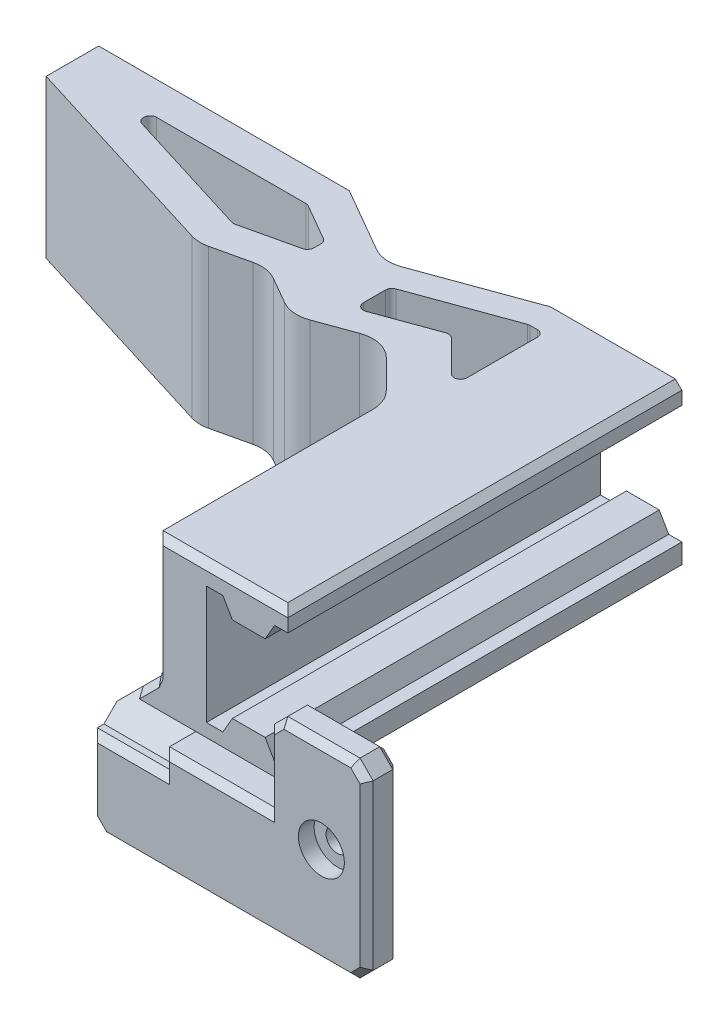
ISO-10303-21;
HEADER;
FILE_DESCRIPTION(('STEP AP214'),'2;1');
FILE_NAME('part.step','',(''),(''),'','','');
FILE_SCHEMA(('AUTOMOTIVE_DESIGN { 1 0 10303 214 1 1 1 1 }'));
ENDSEC;
DATA;
#1=APPLICATION_CONTEXT('core data for automotive mechanical design processes');
#2=APPLICATION_PROTOCOL_DEFINITION('international standard','automotive_design',2000,#1);
#3=PRODUCT_CONTEXT('',#1,'mechanical');
#4=PRODUCT('Part','Part','',(#3));
#5=PRODUCT_RELATED_PRODUCT_CATEGORY('part','',(#4));
#6=PRODUCT_DEFINITION_FORMATION('','',#4);
#7=PRODUCT_DEFINITION_CONTEXT('part definition',#1,'design');
#8=PRODUCT_DEFINITION('design','',#6,#7);
#9=PRODUCT_DEFINITION_SHAPE('','',#8);
#10=(LENGTH_UNIT() NAMED_UNIT(*) SI_UNIT(.MILLI.,.METRE.));
#11=(NAMED_UNIT(*) PLANE_ANGLE_UNIT() SI_UNIT($,.RADIAN.));
#12=(NAMED_UNIT(*) SI_UNIT($,.STERADIAN.) SOLID_ANGLE_UNIT());
#13=UNCERTAINTY_MEASURE_WITH_UNIT(LENGTH_MEASURE(1.E-05),#10,'distance_accuracy_value','');
#14=(GEOMETRIC_REPRESENTATION_CONTEXT(3) GLOBAL_UNCERTAINTY_ASSIGNED_CONTEXT((#13)) GLOBAL_UNIT_ASSIGNED_CONTEXT((#10,
#11,#12)) REPRESENTATION_CONTEXT('',''));
#15=CARTESIAN_POINT('',(0.,0.,0.));
#16=DIRECTION('',(0.,0.,1.));
#17=DIRECTION('',(1.,0.,0.));
#18=AXIS2_PLACEMENT_3D('',#15,#16,#17);
#19=CARTESIAN_POINT('',(0.,-27.,0.));
#20=DIRECTION('',(0.,1.,0.));
#21=DIRECTION('',(0.,0.,1.));
#22=AXIS2_PLACEMENT_3D('',#19,#20,#21);
#23=PLANE('',#22);
#24=DIRECTION('',(0.,0.,-1.));
#25=VECTOR('',#24,1.);
#26=CARTESIAN_POINT('',(-25.6132486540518,-27.,0.));
#27=LINE('',#26,#25);
#28=CARTESIAN_POINT('',(-25.6132486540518,-27.,34.));
#29=VERTEX_POINT('',#28);
#30=CARTESIAN_POINT('',(-25.6132486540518,-27.,6.00000000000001));
#31=VERTEX_POINT('',#30);
#32=EDGE_CURVE('E985',#29,#31,#27,.T.);
#33=ORIENTED_EDGE('',*,*,#32,.T.);
#34=DIRECTION('',(1.,0.,0.));
#35=VECTOR('',#34,1.);
#36=CARTESIAN_POINT('',(0.,-27.,6.00000000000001));
#37=LINE('',#36,#35);
#38=CARTESIAN_POINT('',(-15.6132486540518,-27.,6.00000000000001));
#39=VERTEX_POINT('',#38);
#40=EDGE_CURVE('E1068',#31,#39,#37,.T.);
#41=ORIENTED_EDGE('',*,*,#40,.T.);
#42=DIRECTION('',(0.,0.,1.));
#43=VECTOR('',#42,1.);
#44=CARTESIAN_POINT('',(-15.6132486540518,-27.,0.));
#45=LINE('',#44,#43);
#46=CARTESIAN_POINT('',(-15.6132486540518,-27.,29.));
#47=VERTEX_POINT('',#46);
#48=EDGE_CURVE('E1066',#39,#47,#45,.T.);
#49=ORIENTED_EDGE('',*,*,#48,.T.);
#50=DIRECTION('',(-0.707106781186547,0.,-0.707106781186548));
#51=VECTOR('',#50,1.);
#52=CARTESIAN_POINT('',(-15.6132486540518,-27.,29.));
#53=LINE('',#52,#51);
#54=CARTESIAN_POINT('',(-14.6132486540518,-27.,30.));
#55=VERTEX_POINT('',#54);
#56=EDGE_CURVE('E1063',#55,#47,#53,.T.);
#57=ORIENTED_EDGE('',*,*,#56,.F.);
#58=DIRECTION('',(-0.707106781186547,0.,-0.707106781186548));
#59=VECTOR('',#58,1.);
#60=CARTESIAN_POINT('',(-15.6132486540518,-27.,29.));
#61=LINE('',#60,#59);
#62=CARTESIAN_POINT('',(-13.6132486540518,-27.,31.));
#63=VERTEX_POINT('',#62);
#64=EDGE_CURVE('E1060',#63,#55,#61,.T.);
#65=ORIENTED_EDGE('',*,*,#64,.F.);
#66=DIRECTION('',(1.,0.,0.));
#67=VECTOR('',#66,1.);
#68=CARTESIAN_POINT('',(12.3867513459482,-27.,31.));
#69=LINE('',#68,#67);
#70=CARTESIAN_POINT('',(12.3867513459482,-27.,31.));
#71=VERTEX_POINT('',#70);
#72=EDGE_CURVE('E1058',#63,#71,#69,.T.);
#73=ORIENTED_EDGE('',*,*,#72,.T.);
#74=DIRECTION('',(0.,0.,1.));
#75=VECTOR('',#74,1.);
#76=CARTESIAN_POINT('',(12.3867513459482,-27.,0.));
#77=LINE('',#76,#75);
#78=CARTESIAN_POINT('',(12.3867513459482,-27.,34.));
#79=VERTEX_POINT('',#78);
#80=EDGE_CURVE('E988',#71,#79,#77,.T.);
#81=ORIENTED_EDGE('',*,*,#80,.T.);
#82=DIRECTION('',(-1.,0.,0.));
#83=VECTOR('',#82,1.);
#84=CARTESIAN_POINT('',(0.,-27.,34.));
#85=LINE('',#84,#83);
#86=EDGE_CURVE('E1056',#79,#29,#85,.T.);
#87=ORIENTED_EDGE('',*,*,#86,.T.);
#88=EDGE_LOOP('',(#33,#41,#49,#57,#65,#73,#81,#87));
#89=FACE_BOUND('',#88,.T.);
#90=ADVANCED_FACE('F34',(#89),#23,.F.);
#91=CARTESIAN_POINT('',(-2.61324865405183,-12.,30.));
#92=DIRECTION('',(0.,1.,0.));
#93=DIRECTION('',(0.,0.,1.));
#94=AXIS2_PLACEMENT_3D('',#91,#92,#93);
#95=PLANE('',#94);
#96=DIRECTION('',(0.939692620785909,0.,-0.342020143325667));
#97=VECTOR('',#96,1.);
#98=CARTESIAN_POINT('',(-21.1049998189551,-12.,-20.8056687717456));
#99=LINE('',#98,#97);
#100=CARTESIAN_POINT('',(-36.0650809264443,-12.,-15.3606445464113));
#101=VERTEX_POINT('',#100);
#102=CARTESIAN_POINT('',(-27.1395624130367,-12.,-18.6092676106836));
#103=VERTEX_POINT('',#102);
#104=EDGE_CURVE('E793',#101,#103,#99,.T.);
#105=ORIENTED_EDGE('',*,*,#104,.T.);
#106=CARTESIAN_POINT('',(-26.797542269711,-12.,-17.6695749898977));
#107=DIRECTION('',(0.,1.,0.));
#108=DIRECTION('',(0.,0.,1.));
#109=AXIS2_PLACEMENT_3D('',#106,#107,#108);
#110=CIRCLE('',#109,1.);
#111=CARTESIAN_POINT('',(-26.0904354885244,-12.,-18.3766817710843));
#112=VERTEX_POINT('',#111);
#113=EDGE_CURVE('E1741',#103,#112,#110,.F.);
#114=ORIENTED_EDGE('',*,*,#113,.T.);
#115=DIRECTION('',(0.707106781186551,0.,0.707106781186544));
#116=VECTOR('',#115,1.);
#117=CARTESIAN_POINT('',(9.83649881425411,-12.,17.5502525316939));
#118=LINE('',#117,#116);
#119=CARTESIAN_POINT('',(-21.3203554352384,-12.,-13.6066017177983));
#120=VERTEX_POINT('',#119);
#121=EDGE_CURVE('E796',#112,#120,#118,.T.);
#122=ORIENTED_EDGE('',*,*,#121,.T.);
#123=CARTESIAN_POINT('',(-20.6132486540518,-12.,-14.3137084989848));
#124=DIRECTION('',(0.,1.,0.));
#125=DIRECTION('',(0.,0.,1.));
#126=AXIS2_PLACEMENT_3D('',#123,#124,#125);
#127=CIRCLE('',#126,1.);
#128=CARTESIAN_POINT('',(-19.6132486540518,-12.,-14.3137084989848));
#129=VERTEX_POINT('',#128);
#130=EDGE_CURVE('E1682',#120,#129,#127,.T.);
#131=ORIENTED_EDGE('',*,*,#130,.T.);
#132=DIRECTION('',(0.,0.,-1.));
#133=VECTOR('',#132,1.);
#134=CARTESIAN_POINT('',(-19.6132486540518,-12.,30.));
#135=LINE('',#134,#133);
#136=CARTESIAN_POINT('',(-19.6132486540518,-12.,-25.));
#137=VERTEX_POINT('',#136);
#138=EDGE_CURVE('E799',#129,#137,#135,.T.);
#139=ORIENTED_EDGE('',*,*,#138,.T.);
#140=CARTESIAN_POINT('',(-20.6132486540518,-12.,-25.));
#141=DIRECTION('',(0.,1.,0.));
#142=DIRECTION('',(0.,0.,1.));
#143=AXIS2_PLACEMENT_3D('',#140,#141,#142);
#144=CIRCLE('',#143,1.);
#145=CARTESIAN_POINT('',(-20.6132486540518,-12.,-26.));
#146=VERTEX_POINT('',#145);
#147=EDGE_CURVE('E1686',#137,#146,#144,.T.);
#148=ORIENTED_EDGE('',*,*,#147,.T.);
#149=DIRECTION('',(-1.,0.,0.));
#150=VECTOR('',#149,1.);
#151=CARTESIAN_POINT('',(-2.61324865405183,-12.,-26.));
#152=LINE('',#151,#150);
#153=CARTESIAN_POINT('',(-21.7316137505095,-12.,-26.));
#154=VERTEX_POINT('',#153);
#155=EDGE_CURVE('E784',#146,#154,#152,.T.);
#156=ORIENTED_EDGE('',*,*,#155,.T.);
#157=CARTESIAN_POINT('',(-21.7316137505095,-12.,-25.));
#158=DIRECTION('',(0.,1.,0.));
#159=DIRECTION('',(0.,0.,1.));
#160=AXIS2_PLACEMENT_3D('',#157,#158,#159);
#161=CIRCLE('',#160,1.);
#162=CARTESIAN_POINT('',(-22.0736338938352,-12.,-25.9396926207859));
#163=VERTEX_POINT('',#162);
#164=EDGE_CURVE('E1690',#154,#163,#161,.T.);
#165=ORIENTED_EDGE('',*,*,#164,.T.);
#166=DIRECTION('',(-0.93969262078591,0.,0.342020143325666));
#167=VECTOR('',#166,1.);
#168=CARTESIAN_POINT('',(-22.8683519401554,-12.,-25.6504389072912));
#169=LINE('',#168,#167);
#170=CARTESIAN_POINT('',(-36.7491212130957,-12.,-20.598252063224));
#171=VERTEX_POINT('',#170);
#172=EDGE_CURVE('E787',#163,#171,#169,.T.);
#173=ORIENTED_EDGE('',*,*,#172,.T.);
#174=CARTESIAN_POINT('',(-36.40710106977,-12.,-19.6585594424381));
#175=DIRECTION('',(0.,1.,0.));
#176=DIRECTION('',(0.,0.,1.));
#177=AXIS2_PLACEMENT_3D('',#174,#175,#176);
#178=CIRCLE('',#177,1.);
#179=CARTESIAN_POINT('',(-37.40710106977,-12.,-19.6585594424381));
#180=VERTEX_POINT('',#179);
#181=EDGE_CURVE('E1694',#171,#180,#178,.T.);
#182=ORIENTED_EDGE('',*,*,#181,.T.);
#183=DIRECTION('',(0.,0.,1.));
#184=VECTOR('',#183,1.);
#185=CARTESIAN_POINT('',(-37.4071010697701,-12.,30.));
#186=LINE('',#185,#184);
#187=CARTESIAN_POINT('',(-37.40710106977,-12.,-16.3003371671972));
#188=VERTEX_POINT('',#187);
#189=EDGE_CURVE('E790',#180,#188,#186,.T.);
#190=ORIENTED_EDGE('',*,*,#189,.T.);
#191=CARTESIAN_POINT('',(-36.40710106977,-12.,-16.3003371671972));
#192=DIRECTION('',(0.,1.,0.));
#193=DIRECTION('',(0.,0.,1.));
#194=AXIS2_PLACEMENT_3D('',#191,#192,#193);
#195=CIRCLE('',#194,1.);
#196=EDGE_CURVE('E1698',#188,#101,#195,.T.);
#197=ORIENTED_EDGE('',*,*,#196,.T.);
#198=EDGE_LOOP('',(#105,#114,#122,#131,#139,#148,#156,#165,#173,#182,#190,#197));
#199=FACE_BOUND('',#198,.T.);
#200=DIRECTION('',(-0.974673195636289,0.,0.223633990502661));
#201=VECTOR('',#200,1.);
#202=CARTESIAN_POINT('',(-5.43804801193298,-12.,-23.7008677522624));
#203=LINE('',#202,#201);
#204=CARTESIAN_POINT('',(-51.1171964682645,-12.,-13.2200108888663));
#205=VERTEX_POINT('',#204);
#206=CARTESIAN_POINT('',(-56.6617256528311,-12.,-11.9478458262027));
#207=VERTEX_POINT('',#206);
#208=EDGE_CURVE('E700',#205,#207,#203,.T.);
#209=ORIENTED_EDGE('',*,*,#208,.T.);
#210=CARTESIAN_POINT('',(-57.7798956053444,-12.,-16.8212118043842));
#211=DIRECTION('',(0.,1.,0.));
#212=DIRECTION('',(0.,0.,1.));
#213=AXIS2_PLACEMENT_3D('',#210,#211,#212);
#214=CIRCLE('',#213,5.);
#215=CARTESIAN_POINT('',(-59.2589111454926,-12.,-12.0449671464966));
#216=VERTEX_POINT('',#215);
#217=EDGE_CURVE('E1666',#207,#216,#214,.F.);
#218=ORIENTED_EDGE('',*,*,#217,.T.);
#219=DIRECTION('',(-0.955248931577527,0.,-0.295803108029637));
#220=VECTOR('',#219,1.);
#221=CARTESIAN_POINT('',(-1.78163043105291,-12.,5.75349115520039));
#222=LINE('',#221,#220);
#223=CARTESIAN_POINT('',(-91.40710106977,-12.,-22.));
#224=VERTEX_POINT('',#223);
#225=EDGE_CURVE('E760',#216,#224,#222,.T.);
#226=ORIENTED_EDGE('',*,*,#225,.T.);
#227=DIRECTION('',(0.,0.,-1.));
#228=VECTOR('',#227,1.);
#229=CARTESIAN_POINT('',(-91.40710106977,-12.,1.58566044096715E-13));
#230=LINE('',#229,#228);
#231=CARTESIAN_POINT('',(-91.40710106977,-12.,-30.));
#232=VERTEX_POINT('',#231);
#233=EDGE_CURVE('E762',#224,#232,#230,.T.);
#234=ORIENTED_EDGE('',*,*,#233,.T.);
#235=DIRECTION('',(1.,0.,0.));
#236=VECTOR('',#235,1.);
#237=CARTESIAN_POINT('',(0.,-12.,-30.));
#238=LINE('',#237,#236);
#239=CARTESIAN_POINT('',(-53.255026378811,-12.,-30.));
#240=VERTEX_POINT('',#239);
#241=EDGE_CURVE('E764',#232,#240,#238,.T.);
#242=ORIENTED_EDGE('',*,*,#241,.T.);
#243=DIRECTION('',(0.86602540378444,0.,0.499999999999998));
#244=VECTOR('',#243,1.);
#245=CARTESIAN_POINT('',(-0.323375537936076,-12.,0.560102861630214));
#246=LINE('',#245,#244);
#247=CARTESIAN_POINT('',(-43.4262724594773,-12.,-24.3253662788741));
#248=VERTEX_POINT('',#247);
#249=EDGE_CURVE('E740',#240,#248,#246,.T.);
#250=ORIENTED_EDGE('',*,*,#249,.T.);
#251=CARTESIAN_POINT('',(-40.9262724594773,-12.,-28.6554932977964));
#252=DIRECTION('',(0.,1.,0.));
#253=DIRECTION('',(0.,0.,1.));
#254=AXIS2_PLACEMENT_3D('',#251,#252,#253);
#255=CIRCLE('',#254,5.);
#256=CARTESIAN_POINT('',(-39.216171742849,-12.,-23.9570301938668));
#257=VERTEX_POINT('',#256);
#258=EDGE_CURVE('E11',#248,#257,#255,.T.);
#259=ORIENTED_EDGE('',*,*,#258,.T.);
#260=DIRECTION('',(0.939692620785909,0.,-0.342020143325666));
#261=VECTOR('',#260,1.);
#262=CARTESIAN_POINT('',(-22.6132486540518,-12.,-30.));
#263=LINE('',#262,#261);
#264=CARTESIAN_POINT('',(-22.6132486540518,-12.,-30.));
#265=VERTEX_POINT('',#264);
#266=EDGE_CURVE('E806',#257,#265,#263,.T.);
#267=ORIENTED_EDGE('',*,*,#266,.T.);
#268=DIRECTION('',(1.,0.,0.));
#269=VECTOR('',#268,1.);
#270=CARTESIAN_POINT('',(-2.61324865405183,-12.,-30.));
#271=LINE('',#270,#269);
#272=CARTESIAN_POINT('',(-2.61324865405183,-12.,-30.));
#273=VERTEX_POINT('',#272);
#274=EDGE_CURVE('E898',#265,#273,#271,.T.);
#275=ORIENTED_EDGE('',*,*,#274,.T.);
#276=DIRECTION('',(0.,0.,-1.));
#277=VECTOR('',#276,1.);
#278=CARTESIAN_POINT('',(-2.61324865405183,-12.,30.));
#279=LINE('',#278,#277);
#280=CARTESIAN_POINT('',(-2.61324865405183,-12.,27.));
#281=VERTEX_POINT('',#280);
#282=EDGE_CURVE('E909',#281,#273,#279,.T.);
#283=ORIENTED_EDGE('',*,*,#282,.F.);
#284=DIRECTION('',(-1.,0.,0.));
#285=VECTOR('',#284,1.);
#286=CARTESIAN_POINT('',(-2.61324865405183,-12.,27.));
#287=LINE('',#286,#285);
#288=CARTESIAN_POINT('',(-9.61324865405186,-12.,27.));
#289=VERTEX_POINT('',#288);
#290=EDGE_CURVE('E960',#281,#289,#287,.T.);
#291=ORIENTED_EDGE('',*,*,#290,.T.);
#292=DIRECTION('',(0.,0.,-1.));
#293=VECTOR('',#292,1.);
#294=CARTESIAN_POINT('',(-9.61324865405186,-12.,5.));
#295=LINE('',#294,#293);
#296=CARTESIAN_POINT('',(-9.61324865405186,-12.,3.99999999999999));
#297=VERTEX_POINT('',#296);
#298=EDGE_CURVE('E950',#289,#297,#295,.T.);
#299=ORIENTED_EDGE('',*,*,#298,.T.);
#300=DIRECTION('',(-1.,0.,0.));
#301=VECTOR('',#300,1.);
#302=CARTESIAN_POINT('',(-22.6132486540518,-12.,3.99999999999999));
#303=LINE('',#302,#301);
#304=CARTESIAN_POINT('',(-22.6132486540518,-12.,3.99999999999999));
#305=VERTEX_POINT('',#304);
#306=EDGE_CURVE('E1045',#297,#305,#303,.T.);
#307=ORIENTED_EDGE('',*,*,#306,.T.);
#308=DIRECTION('',(0.,0.,-1.));
#309=VECTOR('',#308,1.);
#310=CARTESIAN_POINT('',(-22.6132486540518,-12.,30.));
#311=LINE('',#310,#309);
#312=CARTESIAN_POINT('',(-22.6132486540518,-12.,-2.9289321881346));
#313=VERTEX_POINT('',#312);
#314=EDGE_CURVE('E911',#305,#313,#311,.T.);
#315=ORIENTED_EDGE('',*,*,#314,.T.);
#316=CARTESIAN_POINT('',(-27.6132486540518,-12.,-2.9289321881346));
#317=DIRECTION('',(0.,1.,0.));
#318=DIRECTION('',(0.,0.,1.));
#319=AXIS2_PLACEMENT_3D('',#316,#317,#318);
#320=CIRCLE('',#319,5.);
#321=CARTESIAN_POINT('',(-24.0777147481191,-12.,-6.46446609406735));
#322=VERTEX_POINT('',#321);
#323=EDGE_CURVE('E1636',#313,#322,#320,.T.);
#324=ORIENTED_EDGE('',*,*,#323,.T.);
#325=DIRECTION('',(-0.707106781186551,0.,-0.707106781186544));
#326=VECTOR('',#325,1.);
#327=CARTESIAN_POINT('',(4.8867513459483,-12.,22.4999999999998));
#328=LINE('',#327,#326);
#329=CARTESIAN_POINT('',(-28.4255572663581,-12.,-10.8123086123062));
#330=VERTEX_POINT('',#329);
#331=EDGE_CURVE('E1793',#322,#330,#328,.T.);
#332=ORIENTED_EDGE('',*,*,#331,.T.);
#333=CARTESIAN_POINT('',(-31.9610911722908,-12.,-7.27677470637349));
#334=DIRECTION('',(0.,1.,0.));
#335=DIRECTION('',(0.,0.,1.));
#336=AXIS2_PLACEMENT_3D('',#333,#334,#335);
#337=CIRCLE('',#336,5.);
#338=CARTESIAN_POINT('',(-33.6711918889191,-12.,-11.975237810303));
#339=VERTEX_POINT('',#338);
#340=EDGE_CURVE('E1638',#330,#339,#337,.T.);
#341=ORIENTED_EDGE('',*,*,#340,.T.);
#342=DIRECTION('',(-0.939692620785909,0.,0.342020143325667));
#343=VECTOR('',#342,1.);
#344=CARTESIAN_POINT('',(-22.6132486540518,-12.,-16.));
#345=LINE('',#344,#343);
#346=CARTESIAN_POINT('',(-39.216171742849,-12.,-9.95703019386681));
#347=VERTEX_POINT('',#346);
#348=EDGE_CURVE('E803',#339,#347,#345,.T.);
#349=ORIENTED_EDGE('',*,*,#348,.T.);
#350=CARTESIAN_POINT('',(-40.9262724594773,-12.,-14.6554932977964));
#351=DIRECTION('',(0.,1.,0.));
#352=DIRECTION('',(0.,0.,1.));
#353=AXIS2_PLACEMENT_3D('',#350,#351,#352);
#354=CIRCLE('',#353,5.);
#355=CARTESIAN_POINT('',(-43.4262724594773,-12.,-10.3253662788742));
#356=VERTEX_POINT('',#355);
#357=EDGE_CURVE('E1668',#347,#356,#354,.F.);
#358=ORIENTED_EDGE('',*,*,#357,.T.);
#359=DIRECTION('',(-0.86602540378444,0.,-0.499999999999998));
#360=VECTOR('',#359,1.);
#361=CARTESIAN_POINT('',(-6.38555336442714,-12.,11.0601028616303));
#362=LINE('',#361,#360);
#363=CARTESIAN_POINT('',(-47.4990265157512,-12.,-12.676771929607));
#364=VERTEX_POINT('',#363);
#365=EDGE_CURVE('E736',#356,#364,#362,.T.);
#366=ORIENTED_EDGE('',*,*,#365,.T.);
#367=CARTESIAN_POINT('',(-49.9990265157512,-12.,-8.34664491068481));
#368=DIRECTION('',(0.,1.,0.));
#369=DIRECTION('',(0.,0.,1.));
#370=AXIS2_PLACEMENT_3D('',#367,#368,#369);
#371=CIRCLE('',#370,5.);
#372=EDGE_CURVE('E1644',#364,#205,#371,.T.);
#373=ORIENTED_EDGE('',*,*,#372,.T.);
#374=EDGE_LOOP('',(#209,#218,#226,#234,#242,#250,#259,#267,#275,#283,#291,#299,#307,#315,#324,
#332,#341,#349,#358,#366,#373));
#375=FACE_BOUND('',#374,.T.);
#376=DIRECTION('',(0.86602540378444,0.,0.499999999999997));
#377=VECTOR('',#376,1.);
#378=CARTESIAN_POINT('',(-2.82337553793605,-12.,4.8902298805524));
#379=LINE('',#378,#377);
#380=CARTESIAN_POINT('',(-54.3627215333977,-12.,-24.8660254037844));
#381=VERTEX_POINT('',#380);
#382=CARTESIAN_POINT('',(-48.9036328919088,-12.,-21.7142191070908));
#383=VERTEX_POINT('',#382);
#384=EDGE_CURVE('E720',#381,#383,#379,.T.);
#385=ORIENTED_EDGE('',*,*,#384,.F.);
#386=CARTESIAN_POINT('',(-54.8627215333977,-12.,-24.));
#387=DIRECTION('',(0.,1.,0.));
#388=DIRECTION('',(0.,0.,1.));
#389=AXIS2_PLACEMENT_3D('',#386,#387,#388);
#390=CIRCLE('',#389,1.);
#391=CARTESIAN_POINT('',(-54.8627215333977,-12.,-25.));
#392=VERTEX_POINT('',#391);
#393=EDGE_CURVE('E1710',#381,#392,#390,.T.);
#394=ORIENTED_EDGE('',*,*,#393,.T.);
#395=DIRECTION('',(1.,0.,0.));
#396=VECTOR('',#395,1.);
#397=CARTESIAN_POINT('',(0.,-12.,-25.));
#398=LINE('',#397,#396);
#399=CARTESIAN_POINT('',(-77.5820193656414,-12.,-25.));
#400=VERTEX_POINT('',#399);
#401=EDGE_CURVE('E719',#400,#392,#398,.T.);
#402=ORIENTED_EDGE('',*,*,#401,.F.);
#403=CARTESIAN_POINT('',(-77.5820193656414,-12.,-24.));
#404=DIRECTION('',(0.,1.,0.));
#405=DIRECTION('',(0.,0.,1.));
#406=AXIS2_PLACEMENT_3D('',#403,#404,#405);
#407=CIRCLE('',#406,1.);
#408=CARTESIAN_POINT('',(-77.877822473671,-12.,-23.0447510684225));
#409=VERTEX_POINT('',#408);
#410=EDGE_CURVE('E1722',#400,#409,#407,.T.);
#411=ORIENTED_EDGE('',*,*,#410,.T.);
#412=DIRECTION('',(-0.955248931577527,0.,-0.295803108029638));
#413=VECTOR('',#412,1.);
#414=CARTESIAN_POINT('',(-0.302614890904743,-12.,0.977246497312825));
#415=LINE('',#414,#413);
#416=CARTESIAN_POINT('',(-58.0370001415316,-12.,-16.9008269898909));
#417=VERTEX_POINT('',#416);
#418=EDGE_CURVE('E724',#417,#409,#415,.T.);
#419=ORIENTED_EDGE('',*,*,#418,.F.);
#420=CARTESIAN_POINT('',(-57.741197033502,-12.,-17.8560759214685));
#421=DIRECTION('',(0.,1.,0.));
#422=DIRECTION('',(0.,0.,1.));
#423=AXIS2_PLACEMENT_3D('',#420,#421,#422);
#424=CIRCLE('',#423,1.);
#425=CARTESIAN_POINT('',(-57.5175630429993,-12.,-16.8814027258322));
#426=VERTEX_POINT('',#425);
#427=EDGE_CURVE('E1714',#417,#426,#424,.T.);
#428=ORIENTED_EDGE('',*,*,#427,.T.);
#429=DIRECTION('',(-0.974673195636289,0.,0.223633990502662));
#430=VECTOR('',#429,1.);
#431=CARTESIAN_POINT('',(-6.5562179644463,-12.,-28.5742337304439));
#432=LINE('',#431,#430);
#433=CARTESIAN_POINT('',(-49.1799989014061,-12.,-18.7944159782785));
#434=VERTEX_POINT('',#433);
#435=EDGE_CURVE('E728',#434,#426,#432,.T.);
#436=ORIENTED_EDGE('',*,*,#435,.F.);
#437=CARTESIAN_POINT('',(-49.4036328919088,-12.,-19.7690891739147));
#438=DIRECTION('',(0.,1.,0.));
#439=DIRECTION('',(0.,0.,1.));
#440=AXIS2_PLACEMENT_3D('',#437,#438,#439);
#441=CIRCLE('',#440,1.);
#442=CARTESIAN_POINT('',(-48.4036328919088,-12.,-19.7690891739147));
#443=VERTEX_POINT('',#442);
#444=EDGE_CURVE('E1706',#434,#443,#441,.T.);
#445=ORIENTED_EDGE('',*,*,#444,.T.);
#446=DIRECTION('',(0.,0.,1.));
#447=VECTOR('',#446,1.);
#448=CARTESIAN_POINT('',(-48.4036328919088,-12.,0.));
#449=LINE('',#448,#447);
#450=CARTESIAN_POINT('',(-48.4036328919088,-12.,-20.8481937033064));
#451=VERTEX_POINT('',#450);
#452=EDGE_CURVE('E735',#451,#443,#449,.T.);
#453=ORIENTED_EDGE('',*,*,#452,.F.);
#454=CARTESIAN_POINT('',(-49.4036328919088,-12.,-20.8481937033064));
#455=DIRECTION('',(0.,1.,0.));
#456=DIRECTION('',(0.,0.,1.));
#457=AXIS2_PLACEMENT_3D('',#454,#455,#456);
#458=CIRCLE('',#457,1.);
#459=EDGE_CURVE('E1702',#451,#383,#458,.T.);
#460=ORIENTED_EDGE('',*,*,#459,.T.);
#461=EDGE_LOOP('',(#385,#394,#402,#411,#419,#428,#436,#445,#453,#460));
#462=FACE_BOUND('',#461,.T.);
#463=ADVANCED_FACE('F1170',(#199,#375,#462),#95,.F.);
#464=CARTESIAN_POINT('',(-4.61324865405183,-8.99999999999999,30.));
#465=DIRECTION('',(-0.866025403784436,-0.500000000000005,0.));
#466=DIRECTION('',(0.500000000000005,-0.866025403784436,0.));
#467=AXIS2_PLACEMENT_3D('',#464,#465,#466);
#468=PLANE('',#467);
#469=DIRECTION('',(-0.500000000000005,0.866025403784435,0.));
#470=VECTOR('',#469,1.);
#471=CARTESIAN_POINT('',(-4.61324865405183,-8.99999999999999,-30.));
#472=LINE('',#471,#470);
#473=CARTESIAN_POINT('',(-4.61324865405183,-8.99999999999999,-30.));
#474=VERTEX_POINT('',#473);
#475=CARTESIAN_POINT('',(-6.05662432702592,-6.49999999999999,-30.));
#476=VERTEX_POINT('',#475);
#477=EDGE_CURVE('E834',#474,#476,#472,.T.);
#478=ORIENTED_EDGE('',*,*,#477,.T.);
#479=DIRECTION('',(0.,0.,-1.));
#480=VECTOR('',#479,1.);
#481=CARTESIAN_POINT('',(-6.05662432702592,-6.49999999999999,30.));
#482=LINE('',#481,#480);
#483=CARTESIAN_POINT('',(-6.05662432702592,-6.49999999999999,30.));
#484=VERTEX_POINT('',#483);
#485=EDGE_CURVE('E944',#484,#476,#482,.T.);
#486=ORIENTED_EDGE('',*,*,#485,.F.);
#487=DIRECTION('',(-0.500000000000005,0.866025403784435,0.));
#488=VECTOR('',#487,1.);
#489=CARTESIAN_POINT('',(-4.61324865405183,-8.99999999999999,30.));
#490=LINE('',#489,#488);
#491=CARTESIAN_POINT('',(-4.61324865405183,-8.99999999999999,30.));
#492=VERTEX_POINT('',#491);
#493=EDGE_CURVE('E835',#492,#484,#490,.T.);
#494=ORIENTED_EDGE('',*,*,#493,.F.);
#495=DIRECTION('',(0.,0.,-1.));
#496=VECTOR('',#495,1.);
#497=CARTESIAN_POINT('',(-4.61324865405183,-8.99999999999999,30.));
#498=LINE('',#497,#496);
#499=EDGE_CURVE('E866',#492,#474,#498,.T.);
#500=ORIENTED_EDGE('',*,*,#499,.T.);
#501=EDGE_LOOP('',(#478,#486,#494,#500));
#502=FACE_BOUND('',#501,.T.);
#503=ADVANCED_FACE('F1214',(#502),#468,.F.);
#504=CARTESIAN_POINT('',(-6.05662432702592,-6.49999999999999,30.));
#505=DIRECTION('',(0.,-1.,0.));
#506=DIRECTION('',(1.,0.,0.));
#507=AXIS2_PLACEMENT_3D('',#504,#505,#506);
#508=PLANE('',#507);
#509=DIRECTION('',(-1.,0.,0.));
#510=VECTOR('',#509,1.);
#511=CARTESIAN_POINT('',(-6.05662432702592,-6.49999999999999,-30.));
#512=LINE('',#511,#510);
#513=CARTESIAN_POINT('',(-11.0566243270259,-6.49999999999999,-30.));
#514=VERTEX_POINT('',#513);
#515=EDGE_CURVE('E869',#476,#514,#512,.T.);
#516=ORIENTED_EDGE('',*,*,#515,.T.);
#517=DIRECTION('',(0.,0.,-1.));
#518=VECTOR('',#517,1.);
#519=CARTESIAN_POINT('',(-11.0566243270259,-6.49999999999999,30.));
#520=LINE('',#519,#518);
#521=CARTESIAN_POINT('',(-11.0566243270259,-6.49999999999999,30.));
#522=VERTEX_POINT('',#521);
#523=EDGE_CURVE('E941',#522,#514,#520,.T.);
#524=ORIENTED_EDGE('',*,*,#523,.F.);
#525=DIRECTION('',(-1.,0.,0.));
#526=VECTOR('',#525,1.);
#527=CARTESIAN_POINT('',(-6.05662432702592,-6.49999999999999,30.));
#528=LINE('',#527,#526);
#529=EDGE_CURVE('E838',#484,#522,#528,.T.);
#530=ORIENTED_EDGE('',*,*,#529,.F.);
#531=ORIENTED_EDGE('',*,*,#485,.T.);
#532=EDGE_LOOP('',(#516,#524,#530,#531));
#533=FACE_BOUND('',#532,.T.);
#534=ADVANCED_FACE('F1210',(#533),#508,.F.);
#535=CARTESIAN_POINT('',(-11.0566243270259,-6.49999999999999,30.));
#536=DIRECTION('',(0.866025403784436,-0.500000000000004,0.));
#537=DIRECTION('',(0.500000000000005,0.866025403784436,0.));
#538=AXIS2_PLACEMENT_3D('',#535,#536,#537);
#539=PLANE('',#538);
#540=DIRECTION('',(-0.500000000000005,-0.866025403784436,0.));
#541=VECTOR('',#540,1.);
#542=CARTESIAN_POINT('',(-11.0566243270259,-6.49999999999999,-30.));
#543=LINE('',#542,#541);
#544=CARTESIAN_POINT('',(-12.5,-8.99999999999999,-30.));
#545=VERTEX_POINT('',#544);
#546=EDGE_CURVE('E871',#514,#545,#543,.T.);
#547=ORIENTED_EDGE('',*,*,#546,.T.);
#548=DIRECTION('',(0.,0.,-1.));
#549=VECTOR('',#548,1.);
#550=CARTESIAN_POINT('',(-12.5,-8.99999999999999,30.));
#551=LINE('',#550,#549);
#552=CARTESIAN_POINT('',(-12.5,-8.99999999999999,30.));
#553=VERTEX_POINT('',#552);
#554=EDGE_CURVE('E938',#553,#545,#551,.T.);
#555=ORIENTED_EDGE('',*,*,#554,.F.);
#556=DIRECTION('',(-0.500000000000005,-0.866025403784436,0.));
#557=VECTOR('',#556,1.);
#558=CARTESIAN_POINT('',(-11.0566243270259,-6.49999999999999,30.));
#559=LINE('',#558,#557);
#560=EDGE_CURVE('E841',#522,#553,#559,.T.);
#561=ORIENTED_EDGE('',*,*,#560,.F.);
#562=ORIENTED_EDGE('',*,*,#523,.T.);
#563=EDGE_LOOP('',(#547,#555,#561,#562));
#564=FACE_BOUND('',#563,.T.);
#565=ADVANCED_FACE('F1206',(#564),#539,.F.);
#566=CARTESIAN_POINT('',(-14.,-8.99999999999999,30.));
#567=DIRECTION('',(0.,-1.,0.));
#568=DIRECTION('',(1.,0.,0.));
#569=AXIS2_PLACEMENT_3D('',#566,#567,#568);
#570=PLANE('',#569);
#571=DIRECTION('',(-1.,0.,0.));
#572=VECTOR('',#571,1.);
#573=CARTESIAN_POINT('',(-14.,-8.99999999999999,-30.));
#574=LINE('',#573,#572);
#575=CARTESIAN_POINT('',(-15.,-9.00000000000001,-30.));
#576=VERTEX_POINT('',#575);
#577=EDGE_CURVE('E874',#545,#576,#574,.T.);
#578=ORIENTED_EDGE('',*,*,#577,.T.);
#579=DIRECTION('',(0.,0.,-1.));
#580=VECTOR('',#579,1.);
#581=CARTESIAN_POINT('',(-15.,-9.00000000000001,30.));
#582=LINE('',#581,#580);
#583=CARTESIAN_POINT('',(-15.,-9.00000000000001,30.));
#584=VERTEX_POINT('',#583);
#585=EDGE_CURVE('E935',#584,#576,#582,.T.);
#586=ORIENTED_EDGE('',*,*,#585,.F.);
#587=DIRECTION('',(-1.,0.,0.));
#588=VECTOR('',#587,1.);
#589=CARTESIAN_POINT('',(-12.5,-8.99999999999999,30.));
#590=LINE('',#589,#588);
#591=EDGE_CURVE('E843',#553,#584,#590,.T.);
#592=ORIENTED_EDGE('',*,*,#591,.F.);
#593=ORIENTED_EDGE('',*,*,#554,.T.);
#594=EDGE_LOOP('',(#578,#586,#592,#593));
#595=FACE_BOUND('',#594,.T.);
#596=ADVANCED_FACE('F1202',(#595),#570,.F.);
#597=CARTESIAN_POINT('',(-15.,8.,30.));
#598=DIRECTION('',(-1.,0.,0.));
#599=DIRECTION('',(0.,0.,1.));
#600=AXIS2_PLACEMENT_3D('',#597,#598,#599);
#601=PLANE('',#600);
#602=DIRECTION('',(0.,1.,0.));
#603=VECTOR('',#602,1.);
#604=CARTESIAN_POINT('',(-15.,8.,-30.));
#605=LINE('',#604,#603);
#606=CARTESIAN_POINT('',(-15.,9.00000000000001,-30.));
#607=VERTEX_POINT('',#606);
#608=EDGE_CURVE('E877',#576,#607,#605,.T.);
#609=ORIENTED_EDGE('',*,*,#608,.T.);
#610=DIRECTION('',(0.,0.,-1.));
#611=VECTOR('',#610,1.);
#612=CARTESIAN_POINT('',(-15.,9.00000000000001,30.));
#613=LINE('',#612,#611);
#614=CARTESIAN_POINT('',(-15.,9.00000000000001,30.));
#615=VERTEX_POINT('',#614);
#616=EDGE_CURVE('E932',#615,#607,#613,.T.);
#617=ORIENTED_EDGE('',*,*,#616,.F.);
#618=DIRECTION('',(0.,1.,0.));
#619=VECTOR('',#618,1.);
#620=CARTESIAN_POINT('',(-15.,-7.99999999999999,30.));
#621=LINE('',#620,#619);
#622=EDGE_CURVE('E845',#584,#615,#621,.T.);
#623=ORIENTED_EDGE('',*,*,#622,.F.);
#624=ORIENTED_EDGE('',*,*,#585,.T.);
#625=EDGE_LOOP('',(#609,#617,#623,#624));
#626=FACE_BOUND('',#625,.T.);
#627=ADVANCED_FACE('F1198',(#626),#601,.F.);
#628=CARTESIAN_POINT('',(-14.,9.00000000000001,30.));
#629=DIRECTION('',(0.,1.,0.));
#630=DIRECTION('',(0.,0.,1.));
#631=AXIS2_PLACEMENT_3D('',#628,#629,#630);
#632=PLANE('',#631);
#633=DIRECTION('',(1.,0.,0.));
#634=VECTOR('',#633,1.);
#635=CARTESIAN_POINT('',(-14.,9.00000000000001,-30.));
#636=LINE('',#635,#634);
#637=CARTESIAN_POINT('',(-12.5,9.00000000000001,-30.));
#638=VERTEX_POINT('',#637);
#639=EDGE_CURVE('E880',#607,#638,#636,.T.);
#640=ORIENTED_EDGE('',*,*,#639,.T.);
#641=DIRECTION('',(0.,0.,-1.));
#642=VECTOR('',#641,1.);
#643=CARTESIAN_POINT('',(-12.5,9.00000000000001,30.));
#644=LINE('',#643,#642);
#645=CARTESIAN_POINT('',(-12.5,9.00000000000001,30.));
#646=VERTEX_POINT('',#645);
#647=EDGE_CURVE('E929',#646,#638,#644,.T.);
#648=ORIENTED_EDGE('',*,*,#647,.F.);
#649=DIRECTION('',(1.,0.,0.));
#650=VECTOR('',#649,1.);
#651=CARTESIAN_POINT('',(-14.,9.00000000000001,30.));
#652=LINE('',#651,#650);
#653=EDGE_CURVE('E847',#615,#646,#652,.T.);
#654=ORIENTED_EDGE('',*,*,#653,.F.);
#655=ORIENTED_EDGE('',*,*,#616,.T.);
#656=EDGE_LOOP('',(#640,#648,#654,#655));
#657=FACE_BOUND('',#656,.T.);
#658=ADVANCED_FACE('F1194',(#657),#632,.F.);
#659=CARTESIAN_POINT('',(-12.5,9.00000000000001,30.));
#660=DIRECTION('',(0.866025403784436,0.500000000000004,0.));
#661=DIRECTION('',(-0.500000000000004,0.866025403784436,0.));
#662=AXIS2_PLACEMENT_3D('',#659,#660,#661);
#663=PLANE('',#662);
#664=DIRECTION('',(0.500000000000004,-0.866025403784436,0.));
#665=VECTOR('',#664,1.);
#666=CARTESIAN_POINT('',(-12.5,9.00000000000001,-30.));
#667=LINE('',#666,#665);
#668=CARTESIAN_POINT('',(-11.0566243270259,6.5,-30.));
#669=VERTEX_POINT('',#668);
#670=EDGE_CURVE('E882',#638,#669,#667,.T.);
#671=ORIENTED_EDGE('',*,*,#670,.T.);
#672=DIRECTION('',(0.,0.,-1.));
#673=VECTOR('',#672,1.);
#674=CARTESIAN_POINT('',(-11.0566243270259,6.5,30.));
#675=LINE('',#674,#673);
#676=CARTESIAN_POINT('',(-11.0566243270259,6.5,30.));
#677=VERTEX_POINT('',#676);
#678=EDGE_CURVE('E926',#677,#669,#675,.T.);
#679=ORIENTED_EDGE('',*,*,#678,.F.);
#680=DIRECTION('',(0.500000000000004,-0.866025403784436,0.));
#681=VECTOR('',#680,1.);
#682=CARTESIAN_POINT('',(-12.5,9.00000000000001,30.));
#683=LINE('',#682,#681);
#684=EDGE_CURVE('E849',#646,#677,#683,.T.);
#685=ORIENTED_EDGE('',*,*,#684,.F.);
#686=ORIENTED_EDGE('',*,*,#647,.T.);
#687=EDGE_LOOP('',(#671,#679,#685,#686));
#688=FACE_BOUND('',#687,.T.);
#689=ADVANCED_FACE('F1190',(#688),#663,.F.);
#690=CARTESIAN_POINT('',(-11.0566243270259,6.5,30.));
#691=DIRECTION('',(0.,1.,0.));
#692=DIRECTION('',(-1.,0.,0.));
#693=AXIS2_PLACEMENT_3D('',#690,#691,#692);
#694=PLANE('',#693);
#695=DIRECTION('',(1.,0.,0.));
#696=VECTOR('',#695,1.);
#697=CARTESIAN_POINT('',(-11.0566243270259,6.5,-30.));
#698=LINE('',#697,#696);
#699=CARTESIAN_POINT('',(-6.05662432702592,6.5,-30.));
#700=VERTEX_POINT('',#699);
#701=EDGE_CURVE('E884',#669,#700,#698,.T.);
#702=ORIENTED_EDGE('',*,*,#701,.T.);
#703=DIRECTION('',(0.,0.,-1.));
#704=VECTOR('',#703,1.);
#705=CARTESIAN_POINT('',(-6.05662432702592,6.5,30.));
#706=LINE('',#705,#704);
#707=CARTESIAN_POINT('',(-6.05662432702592,6.5,30.));
#708=VERTEX_POINT('',#707);
#709=EDGE_CURVE('E923',#708,#700,#706,.T.);
#710=ORIENTED_EDGE('',*,*,#709,.F.);
#711=DIRECTION('',(1.,0.,0.));
#712=VECTOR('',#711,1.);
#713=CARTESIAN_POINT('',(-11.0566243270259,6.5,30.));
#714=LINE('',#713,#712);
#715=EDGE_CURVE('E851',#677,#708,#714,.T.);
#716=ORIENTED_EDGE('',*,*,#715,.F.);
#717=ORIENTED_EDGE('',*,*,#678,.T.);
#718=EDGE_LOOP('',(#702,#710,#716,#717));
#719=FACE_BOUND('',#718,.T.);
#720=ADVANCED_FACE('F1186',(#719),#694,.F.);
#721=CARTESIAN_POINT('',(-6.05662432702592,6.5,30.));
#722=DIRECTION('',(-0.866025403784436,0.500000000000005,0.));
#723=DIRECTION('',(-0.500000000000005,-0.866025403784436,0.));
#724=AXIS2_PLACEMENT_3D('',#721,#722,#723);
#725=PLANE('',#724);
#726=DIRECTION('',(0.500000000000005,0.866025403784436,0.));
#727=VECTOR('',#726,1.);
#728=CARTESIAN_POINT('',(-6.05662432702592,6.5,-30.));
#729=LINE('',#728,#727);
#730=CARTESIAN_POINT('',(-4.61324865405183,9.00000000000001,-30.));
#731=VERTEX_POINT('',#730);
#732=EDGE_CURVE('E886',#700,#731,#729,.T.);
#733=ORIENTED_EDGE('',*,*,#732,.T.);
#734=DIRECTION('',(0.,0.,-1.));
#735=VECTOR('',#734,1.);
#736=CARTESIAN_POINT('',(-4.61324865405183,9.00000000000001,30.));
#737=LINE('',#736,#735);
#738=CARTESIAN_POINT('',(-4.61324865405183,9.00000000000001,30.));
#739=VERTEX_POINT('',#738);
#740=EDGE_CURVE('E920',#739,#731,#737,.T.);
#741=ORIENTED_EDGE('',*,*,#740,.F.);
#742=DIRECTION('',(0.500000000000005,0.866025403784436,0.));
#743=VECTOR('',#742,1.);
#744=CARTESIAN_POINT('',(-6.05662432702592,6.5,30.));
#745=LINE('',#744,#743);
#746=EDGE_CURVE('E853',#708,#739,#745,.T.);
#747=ORIENTED_EDGE('',*,*,#746,.F.);
#748=ORIENTED_EDGE('',*,*,#709,.T.);
#749=EDGE_LOOP('',(#733,#741,#747,#748));
#750=FACE_BOUND('',#749,.T.);
#751=ADVANCED_FACE('F1182',(#750),#725,.F.);
#752=CARTESIAN_POINT('',(-4.61324865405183,9.00000000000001,30.));
#753=DIRECTION('',(0.,1.,0.));
#754=DIRECTION('',(0.,0.,1.));
#755=AXIS2_PLACEMENT_3D('',#752,#753,#754);
#756=PLANE('',#755);
#757=DIRECTION('',(1.,0.,0.));
#758=VECTOR('',#757,1.);
#759=CARTESIAN_POINT('',(-4.61324865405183,9.00000000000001,-30.));
#760=LINE('',#759,#758);
#761=CARTESIAN_POINT('',(-2.61324865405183,9.00000000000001,-30.));
#762=VERTEX_POINT('',#761);
#763=EDGE_CURVE('E888',#731,#762,#760,.T.);
#764=ORIENTED_EDGE('',*,*,#763,.T.);
#765=DIRECTION('',(0.,0.,-1.));
#766=VECTOR('',#765,1.);
#767=CARTESIAN_POINT('',(-2.61324865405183,9.00000000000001,30.));
#768=LINE('',#767,#766);
#769=CARTESIAN_POINT('',(-2.61324865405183,9.00000000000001,30.));
#770=VERTEX_POINT('',#769);
#771=EDGE_CURVE('E917',#770,#762,#768,.T.);
#772=ORIENTED_EDGE('',*,*,#771,.F.);
#773=DIRECTION('',(1.,0.,0.));
#774=VECTOR('',#773,1.);
#775=CARTESIAN_POINT('',(-4.61324865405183,9.00000000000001,30.));
#776=LINE('',#775,#774);
#777=EDGE_CURVE('E855',#739,#770,#776,.T.);
#778=ORIENTED_EDGE('',*,*,#777,.F.);
#779=ORIENTED_EDGE('',*,*,#740,.T.);
#780=EDGE_LOOP('',(#764,#772,#778,#779));
#781=FACE_BOUND('',#780,.T.);
#782=ADVANCED_FACE('F1178',(#781),#756,.F.);
#783=CARTESIAN_POINT('',(-2.61324865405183,9.00000000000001,30.));
#784=DIRECTION('',(-1.,0.,0.));
#785=DIRECTION('',(0.,-1.,0.));
#786=AXIS2_PLACEMENT_3D('',#783,#784,#785);
#787=PLANE('',#786);
#788=DIRECTION('',(0.,1.,0.));
#789=VECTOR('',#788,1.);
#790=CARTESIAN_POINT('',(-2.61324865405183,9.00000000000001,-30.));
#791=LINE('',#790,#789);
#792=CARTESIAN_POINT('',(-2.61324865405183,11.,-30.));
#793=VERTEX_POINT('',#792);
#794=EDGE_CURVE('E890',#762,#793,#791,.T.);
#795=ORIENTED_EDGE('',*,*,#794,.T.);
#796=DIRECTION('',(0.,0.,1.));
#797=VECTOR('',#796,1.);
#798=CARTESIAN_POINT('',(-2.61324865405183,11.,30.));
#799=LINE('',#798,#797);
#800=CARTESIAN_POINT('',(-2.61324865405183,11.,30.));
#801=VERTEX_POINT('',#800);
#802=EDGE_CURVE('E1031',#793,#801,#799,.T.);
#803=ORIENTED_EDGE('',*,*,#802,.T.);
#804=DIRECTION('',(0.,1.,0.));
#805=VECTOR('',#804,1.);
#806=CARTESIAN_POINT('',(-2.61324865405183,9.00000000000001,30.));
#807=LINE('',#806,#805);
#808=EDGE_CURVE('E857',#770,#801,#807,.T.);
#809=ORIENTED_EDGE('',*,*,#808,.F.);
#810=ORIENTED_EDGE('',*,*,#771,.T.);
#811=EDGE_LOOP('',(#795,#803,#809,#810));
#812=FACE_BOUND('',#811,.T.);
#813=ADVANCED_FACE('F1174',(#812),#787,.F.);
#814=CARTESIAN_POINT('',(-2.61324865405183,12.,30.));
#815=DIRECTION('',(0.,-1.,0.));
#816=DIRECTION('',(0.,0.,-1.));
#817=AXIS2_PLACEMENT_3D('',#814,#815,#816);
#818=PLANE('',#817);
#819=DIRECTION('',(0.707106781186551,0.,0.707106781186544));
#820=VECTOR('',#819,1.);
#821=CARTESIAN_POINT('',(-25.7281933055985,12.,-18.0144395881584));
#822=LINE('',#821,#820);
#823=CARTESIAN_POINT('',(-26.0904354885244,12.,-18.3766817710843));
#824=VERTEX_POINT('',#823);
#825=CARTESIAN_POINT('',(-21.3203554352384,12.,-13.6066017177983));
#826=VERTEX_POINT('',#825);
#827=EDGE_CURVE('E781',#824,#826,#822,.T.);
#828=ORIENTED_EDGE('',*,*,#827,.F.);
#829=CARTESIAN_POINT('',(-26.797542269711,12.,-17.6695749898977));
#830=DIRECTION('',(0.,-1.,0.));
#831=DIRECTION('',(0.,0.,-1.));
#832=AXIS2_PLACEMENT_3D('',#829,#830,#831);
#833=CIRCLE('',#832,1.);
#834=CARTESIAN_POINT('',(-27.1395624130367,12.,-18.6092676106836));
#835=VERTEX_POINT('',#834);
#836=EDGE_CURVE('E1743',#824,#835,#833,.F.);
#837=ORIENTED_EDGE('',*,*,#836,.T.);
#838=DIRECTION('',(0.939692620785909,0.,-0.342020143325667));
#839=VECTOR('',#838,1.);
#840=CARTESIAN_POINT('',(-32.046021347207,12.,-16.8234626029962));
#841=LINE('',#840,#839);
#842=CARTESIAN_POINT('',(-36.0650809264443,12.,-15.3606445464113));
#843=VERTEX_POINT('',#842);
#844=EDGE_CURVE('E778',#843,#835,#841,.T.);
#845=ORIENTED_EDGE('',*,*,#844,.F.);
#846=CARTESIAN_POINT('',(-36.40710106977,12.,-16.3003371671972));
#847=DIRECTION('',(0.,-1.,0.));
#848=DIRECTION('',(0.,0.,-1.));
#849=AXIS2_PLACEMENT_3D('',#846,#847,#848);
#850=CIRCLE('',#849,1.);
#851=CARTESIAN_POINT('',(-37.40710106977,12.,-16.3003371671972));
#852=VERTEX_POINT('',#851);
#853=EDGE_CURVE('E1700',#843,#852,#850,.T.);
#854=ORIENTED_EDGE('',*,*,#853,.T.);
#855=DIRECTION('',(0.,0.,1.));
#856=VECTOR('',#855,1.);
#857=CARTESIAN_POINT('',(-37.40710106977,12.,-20.3587669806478));
#858=LINE('',#857,#856);
#859=CARTESIAN_POINT('',(-37.40710106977,12.,-19.6585594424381));
#860=VERTEX_POINT('',#859);
#861=EDGE_CURVE('E775',#860,#852,#858,.T.);
#862=ORIENTED_EDGE('',*,*,#861,.F.);
#863=CARTESIAN_POINT('',(-36.40710106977,12.,-19.6585594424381));
#864=DIRECTION('',(0.,-1.,0.));
#865=DIRECTION('',(0.,0.,-1.));
#866=AXIS2_PLACEMENT_3D('',#863,#864,#865);
#867=CIRCLE('',#866,1.);
#868=CARTESIAN_POINT('',(-36.7491212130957,12.,-20.598252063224));
#869=VERTEX_POINT('',#868);
#870=EDGE_CURVE('E1696',#860,#869,#867,.T.);
#871=ORIENTED_EDGE('',*,*,#870,.T.);
#872=DIRECTION('',(-0.939692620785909,0.,0.342020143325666));
#873=VECTOR('',#872,1.);
#874=CARTESIAN_POINT('',(-21.907940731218,12.,-26.));
#875=LINE('',#874,#873);
#876=CARTESIAN_POINT('',(-22.0736338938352,12.,-25.9396926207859));
#877=VERTEX_POINT('',#876);
#878=EDGE_CURVE('E772',#877,#869,#875,.T.);
#879=ORIENTED_EDGE('',*,*,#878,.F.);
#880=CARTESIAN_POINT('',(-21.7316137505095,12.,-25.));
#881=DIRECTION('',(0.,-1.,0.));
#882=DIRECTION('',(0.,0.,-1.));
#883=AXIS2_PLACEMENT_3D('',#880,#881,#882);
#884=CIRCLE('',#883,1.);
#885=CARTESIAN_POINT('',(-21.7316137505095,12.,-26.));
#886=VERTEX_POINT('',#885);
#887=EDGE_CURVE('E1692',#877,#886,#884,.T.);
#888=ORIENTED_EDGE('',*,*,#887,.T.);
#889=DIRECTION('',(-1.,0.,0.));
#890=VECTOR('',#889,1.);
#891=CARTESIAN_POINT('',(-19.6132486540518,12.,-26.));
#892=LINE('',#891,#890);
#893=CARTESIAN_POINT('',(-20.6132486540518,12.,-26.));
#894=VERTEX_POINT('',#893);
#895=EDGE_CURVE('E769',#894,#886,#892,.T.);
#896=ORIENTED_EDGE('',*,*,#895,.F.);
#897=CARTESIAN_POINT('',(-20.6132486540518,12.,-25.));
#898=DIRECTION('',(0.,-1.,0.));
#899=DIRECTION('',(0.,0.,-1.));
#900=AXIS2_PLACEMENT_3D('',#897,#898,#899);
#901=CIRCLE('',#900,1.);
#902=CARTESIAN_POINT('',(-19.6132486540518,12.,-25.));
#903=VERTEX_POINT('',#902);
#904=EDGE_CURVE('E1688',#894,#903,#901,.T.);
#905=ORIENTED_EDGE('',*,*,#904,.T.);
#906=DIRECTION('',(0.,0.,-1.));
#907=VECTOR('',#906,1.);
#908=CARTESIAN_POINT('',(-19.6132486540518,12.,-26.));
#909=LINE('',#908,#907);
#910=CARTESIAN_POINT('',(-19.6132486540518,12.,-14.3137084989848));
#911=VERTEX_POINT('',#910);
#912=EDGE_CURVE('E739',#911,#903,#909,.T.);
#913=ORIENTED_EDGE('',*,*,#912,.F.);
#914=CARTESIAN_POINT('',(-20.6132486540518,12.,-14.3137084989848));
#915=DIRECTION('',(0.,-1.,0.));
#916=DIRECTION('',(0.,0.,-1.));
#917=AXIS2_PLACEMENT_3D('',#914,#915,#916);
#918=CIRCLE('',#917,1.);
#919=EDGE_CURVE('E1684',#911,#826,#918,.T.);
#920=ORIENTED_EDGE('',*,*,#919,.T.);
#921=EDGE_LOOP('',(#828,#837,#845,#854,#862,#871,#879,#888,#896,#905,#913,#920));
#922=FACE_BOUND('',#921,.T.);
#923=DIRECTION('',(0.955248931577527,0.,0.295803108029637));
#924=VECTOR('',#923,1.);
#925=CARTESIAN_POINT('',(-1.78163043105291,12.,5.75349115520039));
#926=LINE('',#925,#924);
#927=CARTESIAN_POINT('',(-91.40710106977,12.,-22.));
#928=VERTEX_POINT('',#927);
#929=CARTESIAN_POINT('',(-59.2589111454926,12.,-12.0449671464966));
#930=VERTEX_POINT('',#929);
#931=EDGE_CURVE('E697',#928,#930,#926,.T.);
#932=ORIENTED_EDGE('',*,*,#931,.T.);
#933=CARTESIAN_POINT('',(-57.7798956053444,12.,-16.8212118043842));
#934=DIRECTION('',(0.,-1.,0.));
#935=DIRECTION('',(0.,0.,-1.));
#936=AXIS2_PLACEMENT_3D('',#933,#934,#935);
#937=CIRCLE('',#936,5.);
#938=CARTESIAN_POINT('',(-56.6617256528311,12.,-11.9478458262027));
#939=VERTEX_POINT('',#938);
#940=EDGE_CURVE('E1675',#930,#939,#937,.F.);
#941=ORIENTED_EDGE('',*,*,#940,.T.);
#942=DIRECTION('',(0.974673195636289,0.,-0.223633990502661));
#943=VECTOR('',#942,1.);
#944=CARTESIAN_POINT('',(-5.43804801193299,12.,-23.7008677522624));
#945=LINE('',#944,#943);
#946=CARTESIAN_POINT('',(-51.1171964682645,12.,-13.2200108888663));
#947=VERTEX_POINT('',#946);
#948=EDGE_CURVE('E712',#939,#947,#945,.T.);
#949=ORIENTED_EDGE('',*,*,#948,.T.);
#950=CARTESIAN_POINT('',(-49.9990265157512,12.,-8.34664491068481));
#951=DIRECTION('',(0.,-1.,0.));
#952=DIRECTION('',(0.,0.,-1.));
#953=AXIS2_PLACEMENT_3D('',#950,#951,#952);
#954=CIRCLE('',#953,5.);
#955=CARTESIAN_POINT('',(-47.4990265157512,12.,-12.676771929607));
#956=VERTEX_POINT('',#955);
#957=EDGE_CURVE('E1646',#947,#956,#954,.T.);
#958=ORIENTED_EDGE('',*,*,#957,.T.);
#959=DIRECTION('',(0.86602540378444,0.,0.499999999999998));
#960=VECTOR('',#959,1.);
#961=CARTESIAN_POINT('',(-6.38555336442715,12.,11.0601028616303));
#962=LINE('',#961,#960);
#963=CARTESIAN_POINT('',(-43.4262724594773,12.,-10.3253662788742));
#964=VERTEX_POINT('',#963);
#965=EDGE_CURVE('E709',#956,#964,#962,.T.);
#966=ORIENTED_EDGE('',*,*,#965,.T.);
#967=CARTESIAN_POINT('',(-40.9262724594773,12.,-14.6554932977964));
#968=DIRECTION('',(0.,-1.,0.));
#969=DIRECTION('',(0.,0.,-1.));
#970=AXIS2_PLACEMENT_3D('',#967,#968,#969);
#971=CIRCLE('',#970,5.);
#972=CARTESIAN_POINT('',(-39.216171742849,12.,-9.95703019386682));
#973=VERTEX_POINT('',#972);
#974=EDGE_CURVE('E1677',#964,#973,#971,.F.);
#975=ORIENTED_EDGE('',*,*,#974,.T.);
#976=DIRECTION('',(0.939692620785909,0.,-0.342020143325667));
#977=VECTOR('',#976,1.);
#978=CARTESIAN_POINT('',(-22.6132486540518,12.,-16.));
#979=LINE('',#978,#977);
#980=CARTESIAN_POINT('',(-33.6711918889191,12.,-11.975237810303));
#981=VERTEX_POINT('',#980);
#982=EDGE_CURVE('E807',#973,#981,#979,.T.);
#983=ORIENTED_EDGE('',*,*,#982,.T.);
#984=CARTESIAN_POINT('',(-31.9610911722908,12.,-7.27677470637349));
#985=DIRECTION('',(0.,-1.,0.));
#986=DIRECTION('',(0.,0.,-1.));
#987=AXIS2_PLACEMENT_3D('',#984,#985,#986);
#988=CIRCLE('',#987,5.);
#989=CARTESIAN_POINT('',(-28.4255572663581,12.,-10.8123086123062));
#990=VERTEX_POINT('',#989);
#991=EDGE_CURVE('E1642',#981,#990,#988,.T.);
#992=ORIENTED_EDGE('',*,*,#991,.T.);
#993=DIRECTION('',(0.707106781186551,0.,0.707106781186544));
#994=VECTOR('',#993,1.);
#995=CARTESIAN_POINT('',(4.8867513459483,12.,22.4999999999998));
#996=LINE('',#995,#994);
#997=CARTESIAN_POINT('',(-24.0777147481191,12.,-6.46446609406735));
#998=VERTEX_POINT('',#997);
#999=EDGE_CURVE('E1324',#990,#998,#996,.T.);
#1000=ORIENTED_EDGE('',*,*,#999,.T.);
#1001=CARTESIAN_POINT('',(-27.6132486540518,12.,-2.9289321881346));
#1002=DIRECTION('',(0.,-1.,0.));
#1003=DIRECTION('',(0.,0.,-1.));
#1004=AXIS2_PLACEMENT_3D('',#1001,#1002,#1003);
#1005=CIRCLE('',#1004,5.);
#1006=CARTESIAN_POINT('',(-22.6132486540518,12.,-2.9289321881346));
#1007=VERTEX_POINT('',#1006);
#1008=EDGE_CURVE('E1629',#998,#1007,#1005,.T.);
#1009=ORIENTED_EDGE('',*,*,#1008,.T.);
#1010=DIRECTION('',(0.,0.,-1.));
#1011=VECTOR('',#1010,1.);
#1012=CARTESIAN_POINT('',(-22.6132486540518,12.,30.));
#1013=LINE('',#1012,#1011);
#1014=CARTESIAN_POINT('',(-22.6132486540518,12.,29.));
#1015=VERTEX_POINT('',#1014);
#1016=EDGE_CURVE('E914',#1015,#1007,#1013,.T.);
#1017=ORIENTED_EDGE('',*,*,#1016,.F.);
#1018=DIRECTION('',(1.,0.,0.));
#1019=VECTOR('',#1018,1.);
#1020=CARTESIAN_POINT('',(-2.61324865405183,12.,29.));
#1021=LINE('',#1020,#1019);
#1022=CARTESIAN_POINT('',(-3.61324865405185,12.,29.));
#1023=VERTEX_POINT('',#1022);
#1024=EDGE_CURVE('E1027',#1015,#1023,#1021,.T.);
#1025=ORIENTED_EDGE('',*,*,#1024,.T.);
#1026=DIRECTION('',(0.,0.,-1.));
#1027=VECTOR('',#1026,1.);
#1028=CARTESIAN_POINT('',(-3.61324865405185,12.,30.));
#1029=LINE('',#1028,#1027);
#1030=CARTESIAN_POINT('',(-3.61324865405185,12.,-30.));
#1031=VERTEX_POINT('',#1030);
#1032=EDGE_CURVE('E1025',#1023,#1031,#1029,.T.);
#1033=ORIENTED_EDGE('',*,*,#1032,.T.);
#1034=DIRECTION('',(-1.,0.,0.));
#1035=VECTOR('',#1034,1.);
#1036=CARTESIAN_POINT('',(-2.61324865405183,12.,-30.));
#1037=LINE('',#1036,#1035);
#1038=CARTESIAN_POINT('',(-22.6132486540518,12.,-30.));
#1039=VERTEX_POINT('',#1038);
#1040=EDGE_CURVE('E893',#1031,#1039,#1037,.T.);
#1041=ORIENTED_EDGE('',*,*,#1040,.T.);
#1042=DIRECTION('',(-0.93969262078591,0.,0.342020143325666));
#1043=VECTOR('',#1042,1.);
#1044=CARTESIAN_POINT('',(-22.6132486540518,12.,-30.));
#1045=LINE('',#1044,#1043);
#1046=CARTESIAN_POINT('',(-39.216171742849,12.,-23.9570301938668));
#1047=VERTEX_POINT('',#1046);
#1048=EDGE_CURVE('E802',#1039,#1047,#1045,.T.);
#1049=ORIENTED_EDGE('',*,*,#1048,.T.);
#1050=CARTESIAN_POINT('',(-40.9262724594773,12.,-28.6554932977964));
#1051=DIRECTION('',(0.,-1.,0.));
#1052=DIRECTION('',(0.,0.,-1.));
#1053=AXIS2_PLACEMENT_3D('',#1050,#1051,#1052);
#1054=CIRCLE('',#1053,5.);
#1055=CARTESIAN_POINT('',(-43.4262724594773,12.,-24.3253662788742));
#1056=VERTEX_POINT('',#1055);
#1057=EDGE_CURVE('E42',#1047,#1056,#1054,.T.);
#1058=ORIENTED_EDGE('',*,*,#1057,.T.);
#1059=DIRECTION('',(-0.86602540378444,0.,-0.499999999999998));
#1060=VECTOR('',#1059,1.);
#1061=CARTESIAN_POINT('',(-0.323375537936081,12.,0.560102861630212));
#1062=LINE('',#1061,#1060);
#1063=CARTESIAN_POINT('',(-53.255026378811,12.,-30.));
#1064=VERTEX_POINT('',#1063);
#1065=EDGE_CURVE('E707',#1056,#1064,#1062,.T.);
#1066=ORIENTED_EDGE('',*,*,#1065,.T.);
#1067=DIRECTION('',(-1.,0.,0.));
#1068=VECTOR('',#1067,1.);
#1069=CARTESIAN_POINT('',(0.,12.,-30.));
#1070=LINE('',#1069,#1068);
#1071=CARTESIAN_POINT('',(-91.40710106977,12.,-30.));
#1072=VERTEX_POINT('',#1071);
#1073=EDGE_CURVE('E704',#1064,#1072,#1070,.T.);
#1074=ORIENTED_EDGE('',*,*,#1073,.T.);
#1075=DIRECTION('',(0.,0.,1.));
#1076=VECTOR('',#1075,1.);
#1077=CARTESIAN_POINT('',(-91.40710106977,12.,1.58566044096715E-13));
#1078=LINE('',#1077,#1076);
#1079=EDGE_CURVE('E701',#1072,#928,#1078,.T.);
#1080=ORIENTED_EDGE('',*,*,#1079,.T.);
#1081=EDGE_LOOP('',(#932,#941,#949,#958,#966,#975,#983,#992,#1000,#1009,#1017,#1025,#1033,#1041,
#1049,#1058,#1066,#1074,#1080));
#1082=FACE_BOUND('',#1081,.T.);
#1083=DIRECTION('',(0.,0.,-1.));
#1084=VECTOR('',#1083,1.);
#1085=CARTESIAN_POINT('',(-48.4036328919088,12.,0.));
#1086=LINE('',#1085,#1084);
#1087=CARTESIAN_POINT('',(-48.4036328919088,12.,-19.7690891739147));
#1088=VERTEX_POINT('',#1087);
#1089=CARTESIAN_POINT('',(-48.4036328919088,12.,-20.8481937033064));
#1090=VERTEX_POINT('',#1089);
#1091=EDGE_CURVE('E732',#1088,#1090,#1086,.T.);
#1092=ORIENTED_EDGE('',*,*,#1091,.F.);
#1093=CARTESIAN_POINT('',(-49.4036328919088,12.,-19.7690891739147));
#1094=DIRECTION('',(0.,-1.,0.));
#1095=DIRECTION('',(0.,0.,-1.));
#1096=AXIS2_PLACEMENT_3D('',#1093,#1094,#1095);
#1097=CIRCLE('',#1096,1.);
#1098=CARTESIAN_POINT('',(-49.1799989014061,12.,-18.7944159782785));
#1099=VERTEX_POINT('',#1098);
#1100=EDGE_CURVE('E1708',#1088,#1099,#1097,.T.);
#1101=ORIENTED_EDGE('',*,*,#1100,.T.);
#1102=DIRECTION('',(0.974673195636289,0.,-0.223633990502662));
#1103=VECTOR('',#1102,1.);
#1104=CARTESIAN_POINT('',(-6.5562179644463,12.,-28.5742337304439));
#1105=LINE('',#1104,#1103);
#1106=CARTESIAN_POINT('',(-57.5175630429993,12.,-16.8814027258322));
#1107=VERTEX_POINT('',#1106);
#1108=EDGE_CURVE('E715',#1107,#1099,#1105,.T.);
#1109=ORIENTED_EDGE('',*,*,#1108,.F.);
#1110=CARTESIAN_POINT('',(-57.741197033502,12.,-17.8560759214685));
#1111=DIRECTION('',(0.,-1.,0.));
#1112=DIRECTION('',(0.,0.,-1.));
#1113=AXIS2_PLACEMENT_3D('',#1110,#1111,#1112);
#1114=CIRCLE('',#1113,1.);
#1115=CARTESIAN_POINT('',(-58.0370001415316,12.,-16.9008269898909));
#1116=VERTEX_POINT('',#1115);
#1117=EDGE_CURVE('E1716',#1107,#1116,#1114,.T.);
#1118=ORIENTED_EDGE('',*,*,#1117,.T.);
#1119=DIRECTION('',(0.955248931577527,0.,0.295803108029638));
#1120=VECTOR('',#1119,1.);
#1121=CARTESIAN_POINT('',(-0.302614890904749,12.,0.977246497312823));
#1122=LINE('',#1121,#1120);
#1123=CARTESIAN_POINT('',(-77.877822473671,12.,-23.0447510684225));
#1124=VERTEX_POINT('',#1123);
#1125=EDGE_CURVE('E725',#1124,#1116,#1122,.T.);
#1126=ORIENTED_EDGE('',*,*,#1125,.F.);
#1127=CARTESIAN_POINT('',(-77.5820193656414,12.,-24.));
#1128=DIRECTION('',(0.,-1.,0.));
#1129=DIRECTION('',(0.,0.,-1.));
#1130=AXIS2_PLACEMENT_3D('',#1127,#1128,#1129);
#1131=CIRCLE('',#1130,1.);
#1132=CARTESIAN_POINT('',(-77.5820193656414,12.,-25.));
#1133=VERTEX_POINT('',#1132);
#1134=EDGE_CURVE('E1720',#1124,#1133,#1131,.T.);
#1135=ORIENTED_EDGE('',*,*,#1134,.T.);
#1136=DIRECTION('',(-1.,0.,0.));
#1137=VECTOR('',#1136,1.);
#1138=CARTESIAN_POINT('',(0.,12.,-25.));
#1139=LINE('',#1138,#1137);
#1140=CARTESIAN_POINT('',(-54.8627215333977,12.,-25.));
#1141=VERTEX_POINT('',#1140);
#1142=EDGE_CURVE('E721',#1141,#1133,#1139,.T.);
#1143=ORIENTED_EDGE('',*,*,#1142,.F.);
#1144=CARTESIAN_POINT('',(-54.8627215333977,12.,-24.));
#1145=DIRECTION('',(0.,-1.,0.));
#1146=DIRECTION('',(0.,0.,-1.));
#1147=AXIS2_PLACEMENT_3D('',#1144,#1145,#1146);
#1148=CIRCLE('',#1147,1.);
#1149=CARTESIAN_POINT('',(-54.3627215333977,12.,-24.8660254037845));
#1150=VERTEX_POINT('',#1149);
#1151=EDGE_CURVE('E1712',#1141,#1150,#1148,.T.);
#1152=ORIENTED_EDGE('',*,*,#1151,.T.);
#1153=DIRECTION('',(-0.86602540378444,0.,-0.499999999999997));
#1154=VECTOR('',#1153,1.);
#1155=CARTESIAN_POINT('',(-2.82337553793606,12.,4.8902298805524));
#1156=LINE('',#1155,#1154);
#1157=CARTESIAN_POINT('',(-48.9036328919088,12.,-21.7142191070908));
#1158=VERTEX_POINT('',#1157);
#1159=EDGE_CURVE('E716',#1158,#1150,#1156,.T.);
#1160=ORIENTED_EDGE('',*,*,#1159,.F.);
#1161=CARTESIAN_POINT('',(-49.4036328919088,12.,-20.8481937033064));
#1162=DIRECTION('',(0.,-1.,0.));
#1163=DIRECTION('',(0.,0.,-1.));
#1164=AXIS2_PLACEMENT_3D('',#1161,#1162,#1163);
#1165=CIRCLE('',#1164,1.);
#1166=EDGE_CURVE('E1704',#1158,#1090,#1165,.T.);
#1167=ORIENTED_EDGE('',*,*,#1166,.T.);
#1168=EDGE_LOOP('',(#1092,#1101,#1109,#1118,#1126,#1135,#1143,#1152,#1160,#1167));
#1169=FACE_BOUND('',#1168,.T.);
#1170=ADVANCED_FACE('F1168',(#922,#1082,#1169),#818,.F.);
#1171=CARTESIAN_POINT('',(-22.6132486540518,12.,30.));
#1172=DIRECTION('',(1.,0.,0.));
#1173=DIRECTION('',(0.,0.,-1.));
#1174=AXIS2_PLACEMENT_3D('',#1171,#1172,#1173);
#1175=PLANE('',#1174);
#1176=ORIENTED_EDGE('',*,*,#1016,.T.);
#1177=DIRECTION('',(0.,-1.,0.));
#1178=VECTOR('',#1177,1.);
#1179=CARTESIAN_POINT('',(-22.6132486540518,-12.,-2.9289321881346));
#1180=LINE('',#1179,#1178);
#1181=EDGE_CURVE('E1632',#1007,#313,#1180,.T.);
#1182=ORIENTED_EDGE('',*,*,#1181,.T.);
#1183=ORIENTED_EDGE('',*,*,#314,.F.);
#1184=DIRECTION('',(0.,1.,0.));
#1185=VECTOR('',#1184,1.);
#1186=CARTESIAN_POINT('',(-22.6132486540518,-7.00000000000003,3.99999999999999));
#1187=LINE('',#1186,#1185);
#1188=CARTESIAN_POINT('',(-22.6132486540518,-9.41421356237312,3.99999999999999));
#1189=VERTEX_POINT('',#1188);
#1190=EDGE_CURVE('E1019',#305,#1189,#1187,.T.);
#1191=ORIENTED_EDGE('',*,*,#1190,.T.);
#1192=CARTESIAN_POINT('',(-22.6132486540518,-6.58578643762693,6.00000000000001));
#1193=CARTESIAN_POINT('',(-22.6132486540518,-6.97068661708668,5.72783447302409));
#1194=CARTESIAN_POINT('',(-22.6132486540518,-7.35558679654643,5.45566894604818));
#1195=CARTESIAN_POINT('',(-22.6132486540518,-8.01944140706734,4.98625284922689));
#1196=CARTESIAN_POINT('',(-22.6132486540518,-8.2983958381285,4.78900227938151));
#1197=CARTESIAN_POINT('',(-22.6132486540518,-8.85630470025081,4.39450113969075));
#1198=CARTESIAN_POINT('',(-22.6132486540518,-9.13525913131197,4.19725056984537));
#1199=CARTESIAN_POINT('',(-22.6132486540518,-9.41421356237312,3.99999999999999));
#1200=B_SPLINE_CURVE_WITH_KNOTS('',3,(#1192,#1193,#1194,#1195,#1196,#1197,#1198,#1199),
.UNSPECIFIED.,.F.,.F.,(4,2,2,4),(0.,1.41421356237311,2.43915758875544,3.46410161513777),.UNSPECIFIED.);
#1201=CARTESIAN_POINT('',(-22.6132486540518,-6.58578643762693,6.00000000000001));
#1202=VERTEX_POINT('',#1201);
#1203=EDGE_CURVE('E1147',#1189,#1202,#1200,.F.);
#1204=ORIENTED_EDGE('',*,*,#1203,.T.);
#1205=DIRECTION('',(0.,0.,1.));
#1206=VECTOR('',#1205,1.);
#1207=CARTESIAN_POINT('',(-22.6132486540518,-6.58578643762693,30.));
#1208=LINE('',#1207,#1206);
#1209=CARTESIAN_POINT('',(-22.6132486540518,-6.58578643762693,29.));
#1210=VERTEX_POINT('',#1209);
#1211=EDGE_CURVE('E1021',#1202,#1210,#1208,.T.);
#1212=ORIENTED_EDGE('',*,*,#1211,.T.);
#1213=DIRECTION('',(0.,1.,0.));
#1214=VECTOR('',#1213,1.);
#1215=CARTESIAN_POINT('',(-22.6132486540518,12.,29.));
#1216=LINE('',#1215,#1214);
#1217=EDGE_CURVE('E1023',#1210,#1015,#1216,.T.);
#1218=ORIENTED_EDGE('',*,*,#1217,.T.);
#1219=EDGE_LOOP('',(#1176,#1182,#1183,#1191,#1204,#1212,#1218));
#1220=FACE_BOUND('',#1219,.T.);
#1221=ADVANCED_FACE('F1162',(#1220),#1175,.F.);
#1222=CARTESIAN_POINT('',(-2.61324865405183,-9.00000000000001,30.));
#1223=DIRECTION('',(-1.,0.,0.));
#1224=DIRECTION('',(0.,-1.,0.));
#1225=AXIS2_PLACEMENT_3D('',#1222,#1223,#1224);
#1226=PLANE('',#1225);
#1227=DIRECTION('',(0.,1.,0.));
#1228=VECTOR('',#1227,1.);
#1229=CARTESIAN_POINT('',(-2.61324865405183,-9.00000000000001,-30.));
#1230=LINE('',#1229,#1228);
#1231=CARTESIAN_POINT('',(-2.61324865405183,-9.00000000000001,-30.));
#1232=VERTEX_POINT('',#1231);
#1233=EDGE_CURVE('E901',#273,#1232,#1230,.T.);
#1234=ORIENTED_EDGE('',*,*,#1233,.T.);
#1235=DIRECTION('',(0.,0.,-1.));
#1236=VECTOR('',#1235,1.);
#1237=CARTESIAN_POINT('',(-2.61324865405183,-9.00000000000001,30.));
#1238=LINE('',#1237,#1236);
#1239=CARTESIAN_POINT('',(-2.61324865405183,-9.00000000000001,30.));
#1240=VERTEX_POINT('',#1239);
#1241=EDGE_CURVE('E906',#1240,#1232,#1238,.T.);
#1242=ORIENTED_EDGE('',*,*,#1241,.F.);
#1243=DIRECTION('',(0.,1.,0.));
#1244=VECTOR('',#1243,1.);
#1245=CARTESIAN_POINT('',(-2.61324865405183,-9.00000000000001,30.));
#1246=LINE('',#1245,#1244);
#1247=CARTESIAN_POINT('',(-2.61324865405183,-11.,30.));
#1248=VERTEX_POINT('',#1247);
#1249=EDGE_CURVE('E860',#1248,#1240,#1246,.T.);
#1250=ORIENTED_EDGE('',*,*,#1249,.F.);
#1251=CARTESIAN_POINT('',(-2.61324865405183,-15.,30.));
#1252=VERTEX_POINT('',#1251);
#1253=EDGE_CURVE('E861',#1252,#1248,#1246,.T.);
#1254=ORIENTED_EDGE('',*,*,#1253,.F.);
#1255=DIRECTION('',(0.,0.707106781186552,-0.707106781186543));
#1256=VECTOR('',#1255,1.);
#1257=CARTESIAN_POINT('',(-2.61324865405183,-12.,27.));
#1258=LINE('',#1257,#1256);
#1259=EDGE_CURVE('E972',#1252,#281,#1258,.T.);
#1260=ORIENTED_EDGE('',*,*,#1259,.T.);
#1261=ORIENTED_EDGE('',*,*,#282,.T.);
#1262=EDGE_LOOP('',(#1234,#1242,#1250,#1254,#1260,#1261));
#1263=FACE_BOUND('',#1262,.T.);
#1264=ADVANCED_FACE('F1167',(#1263),#1226,.F.);
#1265=CARTESIAN_POINT('',(-2.61324865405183,-9.00000000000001,30.));
#1266=DIRECTION('',(0.,-1.,0.));
#1267=DIRECTION('',(1.,0.,0.));
#1268=AXIS2_PLACEMENT_3D('',#1265,#1266,#1267);
#1269=PLANE('',#1268);
#1270=DIRECTION('',(-1.,0.,0.));
#1271=VECTOR('',#1270,1.);
#1272=CARTESIAN_POINT('',(-2.61324865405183,-9.00000000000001,-30.));
#1273=LINE('',#1272,#1271);
#1274=EDGE_CURVE('E839',#1232,#474,#1273,.T.);
#1275=ORIENTED_EDGE('',*,*,#1274,.T.);
#1276=ORIENTED_EDGE('',*,*,#499,.F.);
#1277=DIRECTION('',(-1.,0.,0.));
#1278=VECTOR('',#1277,1.);
#1279=CARTESIAN_POINT('',(-2.61324865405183,-9.00000000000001,30.));
#1280=LINE('',#1279,#1278);
#1281=EDGE_CURVE('E864',#1240,#492,#1280,.T.);
#1282=ORIENTED_EDGE('',*,*,#1281,.F.);
#1283=ORIENTED_EDGE('',*,*,#1241,.T.);
#1284=EDGE_LOOP('',(#1275,#1276,#1282,#1283));
#1285=FACE_BOUND('',#1284,.T.);
#1286=ADVANCED_FACE('F1285',(#1285),#1269,.F.);
#1287=CARTESIAN_POINT('',(0.,0.,30.));
#1288=DIRECTION('',(0.,0.,1.));
#1289=DIRECTION('',(1.,0.,0.));
#1290=AXIS2_PLACEMENT_3D('',#1287,#1288,#1289);
#1291=PLANE('',#1290);
#1292=DIRECTION('',(0.382683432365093,0.923879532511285,0.));
#1293=VECTOR('',#1292,1.);
#1294=CARTESIAN_POINT('',(-16.1196345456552,6.67697124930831,30.));
#1295=LINE('',#1294,#1293);
#1296=CARTESIAN_POINT('',(-22.1990350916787,-8.00000000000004,30.));
#1297=VERTEX_POINT('',#1296);
#1298=CARTESIAN_POINT('',(-21.6132486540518,-6.58578643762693,30.));
#1299=VERTEX_POINT('',#1298);
#1300=EDGE_CURVE('E1007',#1297,#1299,#1295,.T.);
#1301=ORIENTED_EDGE('',*,*,#1300,.F.);
#1302=DIRECTION('',(-0.707106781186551,-0.707106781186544,0.));
#1303=VECTOR('',#1302,1.);
#1304=CARTESIAN_POINT('',(-25.9061418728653,-11.7071067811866,30.));
#1305=LINE('',#1304,#1303);
#1306=CARTESIAN_POINT('',(-25.1990350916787,-11.,30.));
#1307=VERTEX_POINT('',#1306);
#1308=EDGE_CURVE('E1010',#1297,#1307,#1305,.T.);
#1309=ORIENTED_EDGE('',*,*,#1308,.T.);
#1310=DIRECTION('',(1.,0.,0.));
#1311=VECTOR('',#1310,1.);
#1312=CARTESIAN_POINT('',(0.,-11.,30.));
#1313=LINE('',#1312,#1311);
#1314=CARTESIAN_POINT('',(-16.6132486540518,-11.,30.));
#1315=VERTEX_POINT('',#1314);
#1316=EDGE_CURVE('E968',#1307,#1315,#1313,.T.);
#1317=ORIENTED_EDGE('',*,*,#1316,.T.);
#1318=DIRECTION('',(-1.,0.,0.));
#1319=VECTOR('',#1318,1.);
#1320=CARTESIAN_POINT('',(-0.613248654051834,-11.,30.));
#1321=LINE('',#1320,#1319);
#1322=EDGE_CURVE('E818',#1248,#1315,#1321,.T.);
#1323=ORIENTED_EDGE('',*,*,#1322,.F.);
#1324=ORIENTED_EDGE('',*,*,#1249,.T.);
#1325=ORIENTED_EDGE('',*,*,#1281,.T.);
#1326=ORIENTED_EDGE('',*,*,#493,.T.);
#1327=ORIENTED_EDGE('',*,*,#529,.T.);
#1328=ORIENTED_EDGE('',*,*,#560,.T.);
#1329=ORIENTED_EDGE('',*,*,#591,.T.);
#1330=ORIENTED_EDGE('',*,*,#622,.T.);
#1331=ORIENTED_EDGE('',*,*,#653,.T.);
#1332=ORIENTED_EDGE('',*,*,#684,.T.);
#1333=ORIENTED_EDGE('',*,*,#715,.T.);
#1334=ORIENTED_EDGE('',*,*,#746,.T.);
#1335=ORIENTED_EDGE('',*,*,#777,.T.);
#1336=ORIENTED_EDGE('',*,*,#808,.T.);
#1337=DIRECTION('',(-1.,0.,0.));
#1338=VECTOR('',#1337,1.);
#1339=CARTESIAN_POINT('',(-22.6132486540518,11.,30.));
#1340=LINE('',#1339,#1338);
#1341=CARTESIAN_POINT('',(-21.6132486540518,11.,30.));
#1342=VERTEX_POINT('',#1341);
#1343=EDGE_CURVE('E1003',#801,#1342,#1340,.T.);
#1344=ORIENTED_EDGE('',*,*,#1343,.T.);
#1345=DIRECTION('',(0.,-1.,0.));
#1346=VECTOR('',#1345,1.);
#1347=CARTESIAN_POINT('',(-21.6132486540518,-7.00000000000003,30.));
#1348=LINE('',#1347,#1346);
#1349=EDGE_CURVE('E1005',#1342,#1299,#1348,.T.);
#1350=ORIENTED_EDGE('',*,*,#1349,.T.);
#1351=EDGE_LOOP('',(#1301,#1309,#1317,#1323,#1324,#1325,#1326,#1327,#1328,#1329,#1330,#1331,
#1332,#1333,#1334,#1335,#1336,#1344,#1350));
#1352=FACE_BOUND('',#1351,.T.);
#1353=ADVANCED_FACE('F1282',(#1352),#1291,.T.);
#1354=CARTESIAN_POINT('',(0.,0.,-30.));
#1355=DIRECTION('',(0.,0.,1.));
#1356=DIRECTION('',(1.,0.,0.));
#1357=AXIS2_PLACEMENT_3D('',#1354,#1355,#1356);
#1358=PLANE('',#1357);
#1359=ORIENTED_EDGE('',*,*,#1040,.F.);
#1360=DIRECTION('',(-0.707106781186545,0.70710678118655,0.));
#1361=VECTOR('',#1360,1.);
#1362=CARTESIAN_POINT('',(-3.61324865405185,12.,-30.));
#1363=LINE('',#1362,#1361);
#1364=EDGE_CURVE('E1029',#1031,#793,#1363,.F.);
#1365=ORIENTED_EDGE('',*,*,#1364,.T.);
#1366=ORIENTED_EDGE('',*,*,#794,.F.);
#1367=ORIENTED_EDGE('',*,*,#763,.F.);
#1368=ORIENTED_EDGE('',*,*,#732,.F.);
#1369=ORIENTED_EDGE('',*,*,#701,.F.);
#1370=ORIENTED_EDGE('',*,*,#670,.F.);
#1371=ORIENTED_EDGE('',*,*,#639,.F.);
#1372=ORIENTED_EDGE('',*,*,#608,.F.);
#1373=ORIENTED_EDGE('',*,*,#577,.F.);
#1374=ORIENTED_EDGE('',*,*,#546,.F.);
#1375=ORIENTED_EDGE('',*,*,#515,.F.);
#1376=ORIENTED_EDGE('',*,*,#477,.F.);
#1377=ORIENTED_EDGE('',*,*,#1274,.F.);
#1378=ORIENTED_EDGE('',*,*,#1233,.F.);
#1379=ORIENTED_EDGE('',*,*,#274,.F.);
#1380=DIRECTION('',(0.,-1.,0.));
#1381=VECTOR('',#1380,1.);
#1382=CARTESIAN_POINT('',(-22.6132486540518,12.,-30.));
#1383=LINE('',#1382,#1381);
#1384=EDGE_CURVE('E895',#1039,#265,#1383,.T.);
#1385=ORIENTED_EDGE('',*,*,#1384,.F.);
#1386=EDGE_LOOP('',(#1359,#1365,#1366,#1367,#1368,#1369,#1370,#1371,#1372,#1373,#1374,#1375,
#1376,#1377,#1378,#1379,#1385));
#1387=FACE_BOUND('',#1386,.T.);
#1388=ADVANCED_FACE('F1280',(#1387),#1358,.F.);
#1389=CARTESIAN_POINT('',(-27.6132486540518,-27.,30.));
#1390=DIRECTION('',(1.,0.,0.));
#1391=DIRECTION('',(0.,0.,-1.));
#1392=AXIS2_PLACEMENT_3D('',#1389,#1390,#1391);
#1393=PLANE('',#1392);
#1394=DIRECTION('',(0.,0.,-1.));
#1395=VECTOR('',#1394,1.);
#1396=CARTESIAN_POINT('',(-27.6132486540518,-12.,30.));
#1397=LINE('',#1396,#1395);
#1398=CARTESIAN_POINT('',(-27.6132486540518,-12.,31.));
#1399=VERTEX_POINT('',#1398);
#1400=CARTESIAN_POINT('',(-27.6132486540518,-12.,6.00000000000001));
#1401=VERTEX_POINT('',#1400);
#1402=EDGE_CURVE('E829',#1399,#1401,#1397,.T.);
#1403=ORIENTED_EDGE('',*,*,#1402,.T.);
#1404=DIRECTION('',(0.,-1.,0.));
#1405=VECTOR('',#1404,1.);
#1406=CARTESIAN_POINT('',(-27.6132486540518,-27.,6.00000000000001));
#1407=LINE('',#1406,#1405);
#1408=CARTESIAN_POINT('',(-27.6132486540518,-25.,6.00000000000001));
#1409=VERTEX_POINT('',#1408);
#1410=EDGE_CURVE('E1049',#1401,#1409,#1407,.T.);
#1411=ORIENTED_EDGE('',*,*,#1410,.T.);
#1412=DIRECTION('',(0.,0.,1.));
#1413=VECTOR('',#1412,1.);
#1414=CARTESIAN_POINT('',(-27.6132486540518,-25.,30.));
#1415=LINE('',#1414,#1413);
#1416=CARTESIAN_POINT('',(-27.6132486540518,-25.,34.));
#1417=VERTEX_POINT('',#1416);
#1418=EDGE_CURVE('E997',#1409,#1417,#1415,.T.);
#1419=ORIENTED_EDGE('',*,*,#1418,.T.);
#1420=DIRECTION('',(0.,1.,0.));
#1421=VECTOR('',#1420,1.);
#1422=CARTESIAN_POINT('',(-27.6132486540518,-27.,34.));
#1423=LINE('',#1422,#1421);
#1424=CARTESIAN_POINT('',(-27.6132486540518,-14.,34.));
#1425=VERTEX_POINT('',#1424);
#1426=EDGE_CURVE('E1047',#1417,#1425,#1423,.T.);
#1427=ORIENTED_EDGE('',*,*,#1426,.T.);
#1428=DIRECTION('',(0.,0.,-1.));
#1429=VECTOR('',#1428,1.);
#1430=CARTESIAN_POINT('',(-27.6132486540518,-14.,35.));
#1431=LINE('',#1430,#1429);
#1432=CARTESIAN_POINT('',(-27.6132486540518,-14.,33.));
#1433=VERTEX_POINT('',#1432);
#1434=EDGE_CURVE('E822',#1425,#1433,#1431,.T.);
#1435=ORIENTED_EDGE('',*,*,#1434,.T.);
#1436=DIRECTION('',(0.,0.707106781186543,-0.707106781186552));
#1437=VECTOR('',#1436,1.);
#1438=CARTESIAN_POINT('',(-27.6132486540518,-18.9999999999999,38.));
#1439=LINE('',#1438,#1437);
#1440=EDGE_CURVE('E974',#1433,#1399,#1439,.T.);
#1441=ORIENTED_EDGE('',*,*,#1440,.T.);
#1442=EDGE_LOOP('',(#1403,#1411,#1419,#1427,#1435,#1441));
#1443=FACE_BOUND('',#1442,.T.);
#1444=ADVANCED_FACE('F1276',(#1443),#1393,.F.);
#1445=CARTESIAN_POINT('',(-22.6132486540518,-27.,5.));
#1446=DIRECTION('',(0.,0.,1.));
#1447=DIRECTION('',(1.,0.,0.));
#1448=AXIS2_PLACEMENT_3D('',#1445,#1446,#1447);
#1449=PLANE('',#1448);
#1450=DIRECTION('',(0.,-1.,0.));
#1451=VECTOR('',#1450,1.);
#1452=CARTESIAN_POINT('',(-23.6132486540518,-12.,5.));
#1453=LINE('',#1452,#1451);
#1454=CARTESIAN_POINT('',(-23.6132486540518,-9.41421356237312,5.));
#1455=VERTEX_POINT('',#1454);
#1456=CARTESIAN_POINT('',(-23.6132486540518,-13.,5.));
#1457=VERTEX_POINT('',#1456);
#1458=EDGE_CURVE('E1041',#1455,#1457,#1453,.T.);
#1459=ORIENTED_EDGE('',*,*,#1458,.T.);
#1460=DIRECTION('',(1.,0.,0.));
#1461=VECTOR('',#1460,1.);
#1462=CARTESIAN_POINT('',(-9.61324865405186,-13.,5.));
#1463=LINE('',#1462,#1461);
#1464=CARTESIAN_POINT('',(-10.6132486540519,-13.,5.));
#1465=VERTEX_POINT('',#1464);
#1466=EDGE_CURVE('E1043',#1457,#1465,#1463,.T.);
#1467=ORIENTED_EDGE('',*,*,#1466,.T.);
#1468=DIRECTION('',(0.707106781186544,0.707106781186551,0.));
#1469=VECTOR('',#1468,1.);
#1470=CARTESIAN_POINT('',(-23.6132486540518,-26.0000000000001,5.));
#1471=LINE('',#1470,#1469);
#1472=CARTESIAN_POINT('',(-14.6132486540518,-17.,5.));
#1473=VERTEX_POINT('',#1472);
#1474=EDGE_CURVE('E954',#1465,#1473,#1471,.F.);
#1475=ORIENTED_EDGE('',*,*,#1474,.T.);
#1476=DIRECTION('',(0.,1.,0.));
#1477=VECTOR('',#1476,1.);
#1478=CARTESIAN_POINT('',(-14.6132486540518,-27.,5.));
#1479=LINE('',#1478,#1477);
#1480=CARTESIAN_POINT('',(-14.6132486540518,-26.,5.));
#1481=VERTEX_POINT('',#1480);
#1482=EDGE_CURVE('E832',#1481,#1473,#1479,.T.);
#1483=ORIENTED_EDGE('',*,*,#1482,.F.);
#1484=DIRECTION('',(-1.,0.,0.));
#1485=VECTOR('',#1484,1.);
#1486=CARTESIAN_POINT('',(-22.6132486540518,-26.,5.));
#1487=LINE('',#1486,#1485);
#1488=CARTESIAN_POINT('',(-25.1990350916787,-26.,5.));
#1489=VERTEX_POINT('',#1488);
#1490=EDGE_CURVE('E1033',#1481,#1489,#1487,.T.);
#1491=ORIENTED_EDGE('',*,*,#1490,.T.);
#1492=DIRECTION('',(-0.707106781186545,0.70710678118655,0.));
#1493=VECTOR('',#1492,1.);
#1494=CARTESIAN_POINT('',(-26.9061418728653,-24.2928932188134,5.));
#1495=LINE('',#1494,#1493);
#1496=CARTESIAN_POINT('',(-26.6132486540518,-24.5857864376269,5.));
#1497=VERTEX_POINT('',#1496);
#1498=EDGE_CURVE('E1035',#1489,#1497,#1495,.T.);
#1499=ORIENTED_EDGE('',*,*,#1498,.T.);
#1500=DIRECTION('',(0.,1.,0.));
#1501=VECTOR('',#1500,1.);
#1502=CARTESIAN_POINT('',(-26.6132486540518,-27.,5.));
#1503=LINE('',#1502,#1501);
#1504=CARTESIAN_POINT('',(-26.6132486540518,-12.4142135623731,5.));
#1505=VERTEX_POINT('',#1504);
#1506=EDGE_CURVE('E1037',#1497,#1505,#1503,.T.);
#1507=ORIENTED_EDGE('',*,*,#1506,.T.);
#1508=DIRECTION('',(0.707106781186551,0.707106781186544,0.));
#1509=VECTOR('',#1508,1.);
#1510=CARTESIAN_POINT('',(-31.9061418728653,-17.7071067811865,5.));
#1511=LINE('',#1510,#1509);
#1512=EDGE_CURVE('E1039',#1505,#1455,#1511,.T.);
#1513=ORIENTED_EDGE('',*,*,#1512,.T.);
#1514=EDGE_LOOP('',(#1459,#1467,#1475,#1483,#1491,#1499,#1507,#1513));
#1515=FACE_BOUND('',#1514,.T.);
#1516=ADVANCED_FACE('F1272',(#1515),#1449,.F.);
#1517=CARTESIAN_POINT('',(-14.6132486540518,-27.,30.));
#1518=DIRECTION('',(-1.,0.,0.));
#1519=DIRECTION('',(0.,0.,1.));
#1520=AXIS2_PLACEMENT_3D('',#1517,#1518,#1519);
#1521=PLANE('',#1520);
#1522=DIRECTION('',(0.,-1.,0.));
#1523=VECTOR('',#1522,1.);
#1524=CARTESIAN_POINT('',(-14.6132486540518,-27.,29.));
#1525=LINE('',#1524,#1523);
#1526=CARTESIAN_POINT('',(-14.6132486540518,-17.,29.));
#1527=VERTEX_POINT('',#1526);
#1528=CARTESIAN_POINT('',(-14.6132486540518,-26.,29.));
#1529=VERTEX_POINT('',#1528);
#1530=EDGE_CURVE('E1070',#1527,#1529,#1525,.T.);
#1531=ORIENTED_EDGE('',*,*,#1530,.T.);
#1532=DIRECTION('',(0.,0.,-1.));
#1533=VECTOR('',#1532,1.);
#1534=CARTESIAN_POINT('',(-14.6132486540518,-26.,30.));
#1535=LINE('',#1534,#1533);
#1536=EDGE_CURVE('E1072',#1529,#1481,#1535,.T.);
#1537=ORIENTED_EDGE('',*,*,#1536,.T.);
#1538=ORIENTED_EDGE('',*,*,#1482,.T.);
#1539=DIRECTION('',(0.,0.,1.));
#1540=VECTOR('',#1539,1.);
#1541=CARTESIAN_POINT('',(-14.6132486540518,-17.,30.));
#1542=LINE('',#1541,#1540);
#1543=EDGE_CURVE('E947',#1473,#1527,#1542,.T.);
#1544=ORIENTED_EDGE('',*,*,#1543,.T.);
#1545=EDGE_LOOP('',(#1531,#1537,#1538,#1544));
#1546=FACE_BOUND('',#1545,.T.);
#1547=ADVANCED_FACE('F1223',(#1546),#1521,.F.);
#1548=CARTESIAN_POINT('',(-27.6132486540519,-12.,0.));
#1549=DIRECTION('',(0.707106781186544,-0.707106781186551,0.));
#1550=DIRECTION('',(0.,0.,-1.));
#1551=AXIS2_PLACEMENT_3D('',#1548,#1549,#1550);
#1552=PLANE('',#1551);
#1553=DIRECTION('',(0.577350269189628,0.577350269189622,-0.577350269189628));
#1554=VECTOR('',#1553,1.);
#1555=CARTESIAN_POINT('',(-17.2799153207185,-1.6666666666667,20.6666666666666));
#1556=LINE('',#1555,#1554);
#1557=CARTESIAN_POINT('',(-25.6132486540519,-10.,29.));
#1558=VERTEX_POINT('',#1557);
#1559=EDGE_CURVE('E977',#1399,#1558,#1556,.T.);
#1560=ORIENTED_EDGE('',*,*,#1559,.T.);
#1561=DIRECTION('',(0.707106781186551,0.707106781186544,0.));
#1562=VECTOR('',#1561,1.);
#1563=CARTESIAN_POINT('',(-22.6132486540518,-7.00000000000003,29.));
#1564=LINE('',#1563,#1562);
#1565=CARTESIAN_POINT('',(-22.9061418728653,-7.29289321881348,29.));
#1566=VERTEX_POINT('',#1565);
#1567=EDGE_CURVE('E1017',#1558,#1566,#1564,.T.);
#1568=ORIENTED_EDGE('',*,*,#1567,.T.);
#1569=DIRECTION('',(0.,0.,-1.));
#1570=VECTOR('',#1569,1.);
#1571=CARTESIAN_POINT('',(-22.9061418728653,-7.29289321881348,5.));
#1572=LINE('',#1571,#1570);
#1573=CARTESIAN_POINT('',(-22.9061418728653,-7.29289321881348,6.00000000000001));
#1574=VERTEX_POINT('',#1573);
#1575=EDGE_CURVE('E1015',#1566,#1574,#1572,.T.);
#1576=ORIENTED_EDGE('',*,*,#1575,.T.);
#1577=DIRECTION('',(-0.707106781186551,-0.707106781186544,0.));
#1578=VECTOR('',#1577,1.);
#1579=CARTESIAN_POINT('',(-27.6132486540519,-12.,6.00000000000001));
#1580=LINE('',#1579,#1578);
#1581=EDGE_CURVE('E1013',#1574,#1401,#1580,.T.);
#1582=ORIENTED_EDGE('',*,*,#1581,.T.);
#1583=ORIENTED_EDGE('',*,*,#1402,.F.);
#1584=EDGE_LOOP('',(#1560,#1568,#1576,#1582,#1583));
#1585=FACE_BOUND('',#1584,.T.);
#1586=ADVANCED_FACE('F1219',(#1585),#1552,.F.);
#1587=CARTESIAN_POINT('',(-14.6132486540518,-17.,30.));
#1588=DIRECTION('',(0.707106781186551,-0.707106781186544,0.));
#1589=DIRECTION('',(0.,0.,-1.));
#1590=AXIS2_PLACEMENT_3D('',#1587,#1588,#1589);
#1591=PLANE('',#1590);
#1592=DIRECTION('',(-0.707106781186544,-0.707106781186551,0.));
#1593=VECTOR('',#1592,1.);
#1594=CARTESIAN_POINT('',(-14.6132486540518,-17.,30.));
#1595=LINE('',#1594,#1593);
#1596=CARTESIAN_POINT('',(-13.6132486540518,-16.,30.));
#1597=VERTEX_POINT('',#1596);
#1598=CARTESIAN_POINT('',(-12.6132486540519,-15.,30.));
#1599=VERTEX_POINT('',#1598);
#1600=EDGE_CURVE('E952',#1597,#1599,#1595,.F.);
#1601=ORIENTED_EDGE('',*,*,#1600,.F.);
#1602=DIRECTION('',(0.577350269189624,0.577350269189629,0.577350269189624));
#1603=VECTOR('',#1602,1.);
#1604=CARTESIAN_POINT('',(-8.27991532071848,-10.6666666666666,35.3333333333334));
#1605=LINE('',#1604,#1603);
#1606=EDGE_CURVE('E1090',#1597,#1527,#1605,.F.);
#1607=ORIENTED_EDGE('',*,*,#1606,.T.);
#1608=ORIENTED_EDGE('',*,*,#1543,.F.);
#1609=ORIENTED_EDGE('',*,*,#1474,.F.);
#1610=DIRECTION('',(0.577350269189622,0.577350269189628,-0.577350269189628));
#1611=VECTOR('',#1610,1.);
#1612=CARTESIAN_POINT('',(-21.6132486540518,-24.0000000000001,16.0000000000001));
#1613=LINE('',#1612,#1611);
#1614=EDGE_CURVE('E1325',#1465,#297,#1613,.T.);
#1615=ORIENTED_EDGE('',*,*,#1614,.T.);
#1616=ORIENTED_EDGE('',*,*,#298,.F.);
#1617=DIRECTION('',(0.577350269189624,0.57735026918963,-0.577350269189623));
#1618=VECTOR('',#1617,1.);
#1619=CARTESIAN_POINT('',(-8.40883243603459,-10.7955837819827,25.7955837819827));
#1620=LINE('',#1619,#1618);
#1621=EDGE_CURVE('E962',#289,#1599,#1620,.F.);
#1622=ORIENTED_EDGE('',*,*,#1621,.T.);
#1623=EDGE_LOOP('',(#1601,#1607,#1608,#1609,#1615,#1616,#1622));
#1624=FACE_BOUND('',#1623,.T.);
#1625=ADVANCED_FACE('F1222',(#1624),#1591,.T.);
#1626=CARTESIAN_POINT('',(14.3867513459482,-27.,35.));
#1627=DIRECTION('',(-1.,0.,0.));
#1628=DIRECTION('',(0.,0.,1.));
#1629=AXIS2_PLACEMENT_3D('',#1626,#1627,#1628);
#1630=PLANE('',#1629);
#1631=DIRECTION('',(0.,0.,-1.));
#1632=VECTOR('',#1631,1.);
#1633=CARTESIAN_POINT('',(14.3867513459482,-25.,35.));
#1634=LINE('',#1633,#1632);
#1635=CARTESIAN_POINT('',(14.3867513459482,-25.,34.));
#1636=VERTEX_POINT('',#1635);
#1637=CARTESIAN_POINT('',(14.3867513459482,-25.,31.));
#1638=VERTEX_POINT('',#1637);
#1639=EDGE_CURVE('E982',#1636,#1638,#1634,.T.);
#1640=ORIENTED_EDGE('',*,*,#1639,.T.);
#1641=DIRECTION('',(0.,1.,0.));
#1642=VECTOR('',#1641,1.);
#1643=CARTESIAN_POINT('',(14.3867513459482,0.,31.));
#1644=LINE('',#1643,#1642);
#1645=CARTESIAN_POINT('',(14.3867513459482,0.,31.));
#1646=VERTEX_POINT('',#1645);
#1647=EDGE_CURVE('E1098',#1638,#1646,#1644,.T.);
#1648=ORIENTED_EDGE('',*,*,#1647,.T.);
#1649=DIRECTION('',(0.,0.,1.));
#1650=VECTOR('',#1649,1.);
#1651=CARTESIAN_POINT('',(14.3867513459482,0.,35.));
#1652=LINE('',#1651,#1650);
#1653=CARTESIAN_POINT('',(14.3867513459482,0.,34.));
#1654=VERTEX_POINT('',#1653);
#1655=EDGE_CURVE('E979',#1646,#1654,#1652,.T.);
#1656=ORIENTED_EDGE('',*,*,#1655,.T.);
#1657=DIRECTION('',(0.,-1.,0.));
#1658=VECTOR('',#1657,1.);
#1659=CARTESIAN_POINT('',(14.3867513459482,-27.,34.));
#1660=LINE('',#1659,#1658);
#1661=EDGE_CURVE('E1096',#1654,#1636,#1660,.T.);
#1662=ORIENTED_EDGE('',*,*,#1661,.T.);
#1663=EDGE_LOOP('',(#1640,#1648,#1656,#1662));
#1664=FACE_BOUND('',#1663,.T.);
#1665=ADVANCED_FACE('F1227',(#1664),#1630,.F.);
#1666=CARTESIAN_POINT('',(-27.6132486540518,-14.,35.));
#1667=DIRECTION('',(0.,-1.,0.));
#1668=DIRECTION('',(0.,0.,-1.));
#1669=AXIS2_PLACEMENT_3D('',#1666,#1667,#1668);
#1670=PLANE('',#1669);
#1671=ORIENTED_EDGE('',*,*,#1434,.F.);
#1672=DIRECTION('',(1.,0.,0.));
#1673=VECTOR('',#1672,1.);
#1674=CARTESIAN_POINT('',(-27.6132486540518,-14.,34.));
#1675=LINE('',#1674,#1673);
#1676=CARTESIAN_POINT('',(-16.6132486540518,-14.,34.));
#1677=VERTEX_POINT('',#1676);
#1678=EDGE_CURVE('E1141',#1425,#1677,#1675,.T.);
#1679=ORIENTED_EDGE('',*,*,#1678,.T.);
#1680=DIRECTION('',(0.,0.,1.));
#1681=VECTOR('',#1680,1.);
#1682=CARTESIAN_POINT('',(-16.6132486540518,-14.,30.));
#1683=LINE('',#1682,#1681);
#1684=CARTESIAN_POINT('',(-16.6132486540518,-14.,33.));
#1685=VERTEX_POINT('',#1684);
#1686=EDGE_CURVE('E819',#1685,#1677,#1683,.T.);
#1687=ORIENTED_EDGE('',*,*,#1686,.F.);
#1688=DIRECTION('',(-1.,0.,0.));
#1689=VECTOR('',#1688,1.);
#1690=CARTESIAN_POINT('',(-27.6132486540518,-14.,33.));
#1691=LINE('',#1690,#1689);
#1692=EDGE_CURVE('E965',#1685,#1433,#1691,.T.);
#1693=ORIENTED_EDGE('',*,*,#1692,.T.);
#1694=EDGE_LOOP('',(#1671,#1679,#1687,#1693));
#1695=FACE_BOUND('',#1694,.T.);
#1696=ADVANCED_FACE('F1918',(#1695),#1670,.F.);
#1697=CARTESIAN_POINT('',(0.,0.,35.));
#1698=DIRECTION('',(0.,0.,-1.));
#1699=DIRECTION('',(-1.,0.,0.));
#1700=AXIS2_PLACEMENT_3D('',#1697,#1698,#1699);
#1701=PLANE('',#1700);
#1702=CARTESIAN_POINT('',(7.49999999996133,-12.0000000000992,35.));
#1703=DIRECTION('',(0.,0.,1.));
#1704=DIRECTION('',(1.,0.,0.));
#1705=AXIS2_PLACEMENT_3D('',#1702,#1703,#1704);
#1706=CIRCLE('',#1705,3.5);
#1707=CARTESIAN_POINT('',(10.9999999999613,-12.0000000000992,35.));
#1708=VERTEX_POINT('',#1707);
#1709=EDGE_CURVE('E2865',#1708,#1708,#1706,.T.);
#1710=ORIENTED_EDGE('',*,*,#1709,.F.);
#1711=EDGE_LOOP('',(#1710));
#1712=FACE_BOUND('',#1711,.T.);
#1713=DIRECTION('',(0.,-1.,0.));
#1714=VECTOR('',#1713,1.);
#1715=CARTESIAN_POINT('',(-26.6132486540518,0.,35.));
#1716=LINE('',#1715,#1714);
#1717=CARTESIAN_POINT('',(-26.6132486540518,-15.,35.));
#1718=VERTEX_POINT('',#1717);
#1719=CARTESIAN_POINT('',(-26.6132486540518,-24.5857864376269,35.));
#1720=VERTEX_POINT('',#1719);
#1721=EDGE_CURVE('E1136',#1718,#1720,#1716,.T.);
#1722=ORIENTED_EDGE('',*,*,#1721,.T.);
#1723=DIRECTION('',(0.707106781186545,-0.70710678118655,0.));
#1724=VECTOR('',#1723,1.);
#1725=CARTESIAN_POINT('',(-24.9061418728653,-26.2928932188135,35.));
#1726=LINE('',#1725,#1724);
#1727=CARTESIAN_POINT('',(-25.1990350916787,-26.,35.));
#1728=VERTEX_POINT('',#1727);
#1729=EDGE_CURVE('E1138',#1720,#1728,#1726,.T.);
#1730=ORIENTED_EDGE('',*,*,#1729,.T.);
#1731=DIRECTION('',(1.,0.,0.));
#1732=VECTOR('',#1731,1.);
#1733=CARTESIAN_POINT('',(0.,-26.,35.));
#1734=LINE('',#1733,#1732);
#1735=CARTESIAN_POINT('',(11.9725377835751,-26.,35.));
#1736=VERTEX_POINT('',#1735);
#1737=EDGE_CURVE('E1116',#1728,#1736,#1734,.T.);
#1738=ORIENTED_EDGE('',*,*,#1737,.T.);
#1739=DIRECTION('',(0.707106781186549,0.707106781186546,0.));
#1740=VECTOR('',#1739,1.);
#1741=CARTESIAN_POINT('',(13.6796445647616,-24.2928932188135,35.));
#1742=LINE('',#1741,#1740);
#1743=CARTESIAN_POINT('',(13.3867513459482,-24.5857864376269,35.));
#1744=VERTEX_POINT('',#1743);
#1745=EDGE_CURVE('E1118',#1736,#1744,#1742,.T.);
#1746=ORIENTED_EDGE('',*,*,#1745,.T.);
#1747=DIRECTION('',(0.,1.,0.));
#1748=VECTOR('',#1747,1.);
#1749=CARTESIAN_POINT('',(13.3867513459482,0.,35.));
#1750=LINE('',#1749,#1748);
#1751=CARTESIAN_POINT('',(13.3867513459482,-0.414213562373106,35.));
#1752=VERTEX_POINT('',#1751);
#1753=EDGE_CURVE('E1120',#1744,#1752,#1750,.T.);
#1754=ORIENTED_EDGE('',*,*,#1753,.T.);
#1755=DIRECTION('',(-0.707106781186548,0.707106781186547,0.));
#1756=VECTOR('',#1755,1.);
#1757=CARTESIAN_POINT('',(11.6796445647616,1.29289321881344,35.));
#1758=LINE('',#1757,#1756);
#1759=CARTESIAN_POINT('',(11.9725377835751,0.999999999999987,35.));
#1760=VERTEX_POINT('',#1759);
#1761=EDGE_CURVE('E1122',#1752,#1760,#1758,.T.);
#1762=ORIENTED_EDGE('',*,*,#1761,.T.);
#1763=DIRECTION('',(-1.,0.,0.));
#1764=VECTOR('',#1763,1.);
#1765=CARTESIAN_POINT('',(1.38675134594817,0.999999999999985,35.));
#1766=LINE('',#1765,#1764);
#1767=CARTESIAN_POINT('',(1.80096490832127,0.999999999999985,35.));
#1768=VERTEX_POINT('',#1767);
#1769=EDGE_CURVE('E1124',#1760,#1768,#1766,.T.);
#1770=ORIENTED_EDGE('',*,*,#1769,.T.);
#1771=DIRECTION('',(-0.707106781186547,-0.707106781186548,0.));
#1772=VECTOR('',#1771,1.);
#1773=CARTESIAN_POINT('',(0.0938581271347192,-0.707106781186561,35.));
#1774=LINE('',#1773,#1772);
#1775=CARTESIAN_POINT('',(0.386751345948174,-0.414213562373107,35.));
#1776=VERTEX_POINT('',#1775);
#1777=EDGE_CURVE('E1126',#1768,#1776,#1774,.T.);
#1778=ORIENTED_EDGE('',*,*,#1777,.T.);
#1779=DIRECTION('',(0.,-1.,0.));
#1780=VECTOR('',#1779,1.);
#1781=CARTESIAN_POINT('',(0.386751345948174,-11.,35.));
#1782=LINE('',#1781,#1780);
#1783=CARTESIAN_POINT('',(0.386751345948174,-12.,35.));
#1784=VERTEX_POINT('',#1783);
#1785=EDGE_CURVE('E1128',#1776,#1784,#1782,.T.);
#1786=ORIENTED_EDGE('',*,*,#1785,.T.);
#1787=DIRECTION('',(-1.,0.,0.));
#1788=VECTOR('',#1787,1.);
#1789=CARTESIAN_POINT('',(-16.6132486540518,-12.,35.));
#1790=LINE('',#1789,#1788);
#1791=CARTESIAN_POINT('',(-15.6132486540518,-12.,35.));
#1792=VERTEX_POINT('',#1791);
#1793=EDGE_CURVE('E1130',#1784,#1792,#1790,.T.);
#1794=ORIENTED_EDGE('',*,*,#1793,.T.);
#1795=DIRECTION('',(0.,-1.,0.));
#1796=VECTOR('',#1795,1.);
#1797=CARTESIAN_POINT('',(-15.6132486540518,-14.,35.));
#1798=LINE('',#1797,#1796);
#1799=CARTESIAN_POINT('',(-15.6132486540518,-15.,35.));
#1800=VERTEX_POINT('',#1799);
#1801=EDGE_CURVE('E1132',#1792,#1800,#1798,.T.);
#1802=ORIENTED_EDGE('',*,*,#1801,.T.);
#1803=DIRECTION('',(-1.,0.,0.));
#1804=VECTOR('',#1803,1.);
#1805=CARTESIAN_POINT('',(0.,-15.,35.));
#1806=LINE('',#1805,#1804);
#1807=EDGE_CURVE('E1134',#1800,#1718,#1806,.T.);
#1808=ORIENTED_EDGE('',*,*,#1807,.T.);
#1809=EDGE_LOOP('',(#1722,#1730,#1738,#1746,#1754,#1762,#1770,#1778,#1786,#1794,#1802,#1808));
#1810=FACE_BOUND('',#1809,.T.);
#1811=ADVANCED_FACE('F1928',(#1712,#1810),#1701,.F.);
#1812=CARTESIAN_POINT('',(0.,0.,30.));
#1813=DIRECTION('',(0.,0.,-1.));
#1814=DIRECTION('',(-1.,0.,0.));
#1815=AXIS2_PLACEMENT_3D('',#1812,#1813,#1814);
#1816=PLANE('',#1815);
#1817=CARTESIAN_POINT('',(7.49999999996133,-12.0000000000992,30.));
#1818=DIRECTION('',(0.,0.,-1.));
#1819=DIRECTION('',(-1.,0.,0.));
#1820=AXIS2_PLACEMENT_3D('',#1817,#1818,#1819);
#1821=CIRCLE('',#1820,1.70000000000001);
#1822=CARTESIAN_POINT('',(5.79999999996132,-12.0000000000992,30.));
#1823=VERTEX_POINT('',#1822);
#1824=EDGE_CURVE('E679',#1823,#1823,#1821,.T.);
#1825=ORIENTED_EDGE('',*,*,#1824,.F.);
#1826=EDGE_LOOP('',(#1825));
#1827=FACE_BOUND('',#1826,.T.);
#1828=DIRECTION('',(-1.,0.,0.));
#1829=VECTOR('',#1828,1.);
#1830=CARTESIAN_POINT('',(-14.6132486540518,-26.,30.));
#1831=LINE('',#1830,#1829);
#1832=CARTESIAN_POINT('',(11.9725377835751,-26.,30.));
#1833=VERTEX_POINT('',#1832);
#1834=CARTESIAN_POINT('',(-13.6132486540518,-26.,30.));
#1835=VERTEX_POINT('',#1834);
#1836=EDGE_CURVE('E1086',#1833,#1835,#1831,.T.);
#1837=ORIENTED_EDGE('',*,*,#1836,.T.);
#1838=DIRECTION('',(0.,1.,0.));
#1839=VECTOR('',#1838,1.);
#1840=CARTESIAN_POINT('',(-13.6132486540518,0.,30.));
#1841=LINE('',#1840,#1839);
#1842=EDGE_CURVE('E1088',#1835,#1597,#1841,.T.);
#1843=ORIENTED_EDGE('',*,*,#1842,.T.);
#1844=ORIENTED_EDGE('',*,*,#1600,.T.);
#1845=DIRECTION('',(1.,0.,0.));
#1846=VECTOR('',#1845,1.);
#1847=CARTESIAN_POINT('',(0.,-15.,30.));
#1848=LINE('',#1847,#1846);
#1849=EDGE_CURVE('E957',#1599,#1252,#1848,.T.);
#1850=ORIENTED_EDGE('',*,*,#1849,.T.);
#1851=ORIENTED_EDGE('',*,*,#1253,.T.);
#1852=CARTESIAN_POINT('',(0.386751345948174,-11.,30.));
#1853=VERTEX_POINT('',#1852);
#1854=EDGE_CURVE('E814',#1853,#1248,#1321,.T.);
#1855=ORIENTED_EDGE('',*,*,#1854,.F.);
#1856=DIRECTION('',(0.,1.,0.));
#1857=VECTOR('',#1856,1.);
#1858=CARTESIAN_POINT('',(0.386751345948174,0.,30.));
#1859=LINE('',#1858,#1857);
#1860=CARTESIAN_POINT('',(0.386751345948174,-0.414213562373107,30.));
#1861=VERTEX_POINT('',#1860);
#1862=EDGE_CURVE('E1078',#1853,#1861,#1859,.T.);
#1863=ORIENTED_EDGE('',*,*,#1862,.T.);
#1864=DIRECTION('',(0.707106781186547,0.707106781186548,0.));
#1865=VECTOR('',#1864,1.);
#1866=CARTESIAN_POINT('',(0.40048245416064,-0.40048245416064,30.));
#1867=LINE('',#1866,#1865);
#1868=CARTESIAN_POINT('',(1.80096490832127,0.999999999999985,30.));
#1869=VERTEX_POINT('',#1868);
#1870=EDGE_CURVE('E1076',#1861,#1869,#1867,.T.);
#1871=ORIENTED_EDGE('',*,*,#1870,.T.);
#1872=DIRECTION('',(1.,0.,0.));
#1873=VECTOR('',#1872,1.);
#1874=CARTESIAN_POINT('',(0.,0.999999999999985,30.));
#1875=LINE('',#1874,#1873);
#1876=CARTESIAN_POINT('',(11.9725377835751,0.999999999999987,30.));
#1877=VERTEX_POINT('',#1876);
#1878=EDGE_CURVE('E1074',#1869,#1877,#1875,.T.);
#1879=ORIENTED_EDGE('',*,*,#1878,.T.);
#1880=DIRECTION('',(0.707106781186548,-0.707106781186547,0.));
#1881=VECTOR('',#1880,1.);
#1882=CARTESIAN_POINT('',(6.48626889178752,6.48626889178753,30.));
#1883=LINE('',#1882,#1881);
#1884=CARTESIAN_POINT('',(13.3867513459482,-0.414213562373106,30.));
#1885=VERTEX_POINT('',#1884);
#1886=EDGE_CURVE('E1080',#1877,#1885,#1883,.T.);
#1887=ORIENTED_EDGE('',*,*,#1886,.T.);
#1888=DIRECTION('',(0.,-1.,0.));
#1889=VECTOR('',#1888,1.);
#1890=CARTESIAN_POINT('',(13.3867513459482,-25.,30.));
#1891=LINE('',#1890,#1889);
#1892=CARTESIAN_POINT('',(13.3867513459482,-24.5857864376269,30.));
#1893=VERTEX_POINT('',#1892);
#1894=EDGE_CURVE('E1082',#1885,#1893,#1891,.T.);
#1895=ORIENTED_EDGE('',*,*,#1894,.T.);
#1896=DIRECTION('',(-0.707106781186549,-0.707106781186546,0.));
#1897=VECTOR('',#1896,1.);
#1898=CARTESIAN_POINT('',(18.9862688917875,-18.9862688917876,30.));
#1899=LINE('',#1898,#1897);
#1900=EDGE_CURVE('E1084',#1893,#1833,#1899,.T.);
#1901=ORIENTED_EDGE('',*,*,#1900,.T.);
#1902=EDGE_LOOP('',(#1837,#1843,#1844,#1850,#1851,#1855,#1863,#1871,#1879,#1887,#1895,#1901));
#1903=FACE_BOUND('',#1902,.T.);
#1904=ADVANCED_FACE('F1313',(#1827,#1903),#1816,.T.);
#1905=CARTESIAN_POINT('',(-16.6132486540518,-14.,30.));
#1906=DIRECTION('',(-1.,0.,0.));
#1907=DIRECTION('',(0.,0.,1.));
#1908=AXIS2_PLACEMENT_3D('',#1905,#1906,#1907);
#1909=PLANE('',#1908);
#1910=ORIENTED_EDGE('',*,*,#1686,.T.);
#1911=DIRECTION('',(0.,1.,0.));
#1912=VECTOR('',#1911,1.);
#1913=CARTESIAN_POINT('',(-16.6132486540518,-11.,34.));
#1914=LINE('',#1913,#1912);
#1915=CARTESIAN_POINT('',(-16.6132486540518,-11.,34.));
#1916=VERTEX_POINT('',#1915);
#1917=EDGE_CURVE('E1143',#1677,#1916,#1914,.T.);
#1918=ORIENTED_EDGE('',*,*,#1917,.T.);
#1919=DIRECTION('',(0.,0.,1.));
#1920=VECTOR('',#1919,1.);
#1921=CARTESIAN_POINT('',(-16.6132486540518,-11.,30.));
#1922=LINE('',#1921,#1920);
#1923=EDGE_CURVE('E823',#1315,#1916,#1922,.T.);
#1924=ORIENTED_EDGE('',*,*,#1923,.F.);
#1925=DIRECTION('',(0.,-0.707106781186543,0.707106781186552));
#1926=VECTOR('',#1925,1.);
#1927=CARTESIAN_POINT('',(-16.6132486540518,-12.5,31.5));
#1928=LINE('',#1927,#1926);
#1929=EDGE_CURVE('E970',#1315,#1685,#1928,.T.);
#1930=ORIENTED_EDGE('',*,*,#1929,.T.);
#1931=EDGE_LOOP('',(#1910,#1918,#1924,#1930));
#1932=FACE_BOUND('',#1931,.T.);
#1933=ADVANCED_FACE('F1914',(#1932),#1909,.T.);
#1934=CARTESIAN_POINT('',(-0.613248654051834,-11.,30.));
#1935=DIRECTION('',(0.,1.,0.));
#1936=DIRECTION('',(-1.,0.,0.));
#1937=AXIS2_PLACEMENT_3D('',#1934,#1935,#1936);
#1938=PLANE('',#1937);
#1939=ORIENTED_EDGE('',*,*,#1923,.T.);
#1940=DIRECTION('',(1.,0.,0.));
#1941=VECTOR('',#1940,1.);
#1942=CARTESIAN_POINT('',(-0.613248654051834,-11.,34.));
#1943=LINE('',#1942,#1941);
#1944=CARTESIAN_POINT('',(-0.613248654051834,-11.,34.));
#1945=VERTEX_POINT('',#1944);
#1946=EDGE_CURVE('E1145',#1916,#1945,#1943,.T.);
#1947=ORIENTED_EDGE('',*,*,#1946,.T.);
#1948=DIRECTION('',(0.,0.,1.));
#1949=VECTOR('',#1948,1.);
#1950=CARTESIAN_POINT('',(-0.613248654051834,-11.,30.));
#1951=LINE('',#1950,#1949);
#1952=CARTESIAN_POINT('',(-0.613248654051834,-11.,31.));
#1953=VERTEX_POINT('',#1952);
#1954=EDGE_CURVE('E817',#1953,#1945,#1951,.T.);
#1955=ORIENTED_EDGE('',*,*,#1954,.F.);
#1956=DIRECTION('',(-0.707106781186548,0.,0.707106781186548));
#1957=VECTOR('',#1956,1.);
#1958=CARTESIAN_POINT('',(-0.613248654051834,-11.,31.));
#1959=LINE('',#1958,#1957);
#1960=EDGE_CURVE('E1321',#1953,#1853,#1959,.F.);
#1961=ORIENTED_EDGE('',*,*,#1960,.T.);
#1962=ORIENTED_EDGE('',*,*,#1854,.T.);
#1963=ORIENTED_EDGE('',*,*,#1322,.T.);
#1964=EDGE_LOOP('',(#1939,#1947,#1955,#1961,#1962,#1963));
#1965=FACE_BOUND('',#1964,.T.);
#1966=ADVANCED_FACE('F1317',(#1965),#1938,.T.);
#1967=CARTESIAN_POINT('',(-0.613248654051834,-11.,30.));
#1968=DIRECTION('',(-1.,0.,0.));
#1969=DIRECTION('',(0.,0.,1.));
#1970=AXIS2_PLACEMENT_3D('',#1967,#1968,#1969);
#1971=PLANE('',#1970);
#1972=DIRECTION('',(0.,0.,-1.));
#1973=VECTOR('',#1972,1.);
#1974=CARTESIAN_POINT('',(-0.613248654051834,0.,30.));
#1975=LINE('',#1974,#1973);
#1976=CARTESIAN_POINT('',(-0.613248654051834,0.,34.));
#1977=VERTEX_POINT('',#1976);
#1978=CARTESIAN_POINT('',(-0.613248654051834,0.,31.));
#1979=VERTEX_POINT('',#1978);
#1980=EDGE_CURVE('E1000',#1977,#1979,#1975,.T.);
#1981=ORIENTED_EDGE('',*,*,#1980,.T.);
#1982=DIRECTION('',(0.,-1.,0.));
#1983=VECTOR('',#1982,1.);
#1984=CARTESIAN_POINT('',(-0.613248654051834,-11.,31.));
#1985=LINE('',#1984,#1983);
#1986=EDGE_CURVE('E1106',#1979,#1953,#1985,.T.);
#1987=ORIENTED_EDGE('',*,*,#1986,.T.);
#1988=ORIENTED_EDGE('',*,*,#1954,.T.);
#1989=DIRECTION('',(0.,1.,0.));
#1990=VECTOR('',#1989,1.);
#1991=CARTESIAN_POINT('',(-0.613248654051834,0.,34.));
#1992=LINE('',#1991,#1990);
#1993=EDGE_CURVE('E1104',#1945,#1977,#1992,.T.);
#1994=ORIENTED_EDGE('',*,*,#1993,.T.);
#1995=EDGE_LOOP('',(#1981,#1987,#1988,#1994));
#1996=FACE_BOUND('',#1995,.T.);
#1997=ADVANCED_FACE('F1939',(#1996),#1971,.T.);
#1998=CARTESIAN_POINT('',(14.3867513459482,1.99999999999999,30.));
#1999=DIRECTION('',(0.,1.,0.));
#2000=DIRECTION('',(-1.,0.,0.));
#2001=AXIS2_PLACEMENT_3D('',#1998,#1999,#2000);
#2002=PLANE('',#2001);
#2003=DIRECTION('',(0.,0.,-1.));
#2004=VECTOR('',#2003,1.);
#2005=CARTESIAN_POINT('',(12.3867513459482,1.99999999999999,30.));
#2006=LINE('',#2005,#2004);
#2007=CARTESIAN_POINT('',(12.3867513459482,1.99999999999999,34.));
#2008=VERTEX_POINT('',#2007);
#2009=CARTESIAN_POINT('',(12.3867513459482,1.99999999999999,31.));
#2010=VERTEX_POINT('',#2009);
#2011=EDGE_CURVE('E994',#2008,#2010,#2006,.T.);
#2012=ORIENTED_EDGE('',*,*,#2011,.T.);
#2013=DIRECTION('',(-1.,0.,0.));
#2014=VECTOR('',#2013,1.);
#2015=CARTESIAN_POINT('',(14.3867513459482,1.99999999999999,31.));
#2016=LINE('',#2015,#2014);
#2017=CARTESIAN_POINT('',(1.38675134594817,1.99999999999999,31.));
#2018=VERTEX_POINT('',#2017);
#2019=EDGE_CURVE('E1114',#2010,#2018,#2016,.T.);
#2020=ORIENTED_EDGE('',*,*,#2019,.T.);
#2021=DIRECTION('',(0.,0.,1.));
#2022=VECTOR('',#2021,1.);
#2023=CARTESIAN_POINT('',(1.38675134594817,1.99999999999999,30.));
#2024=LINE('',#2023,#2022);
#2025=CARTESIAN_POINT('',(1.38675134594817,1.99999999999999,34.));
#2026=VERTEX_POINT('',#2025);
#2027=EDGE_CURVE('E991',#2018,#2026,#2024,.T.);
#2028=ORIENTED_EDGE('',*,*,#2027,.T.);
#2029=DIRECTION('',(1.,0.,0.));
#2030=VECTOR('',#2029,1.);
#2031=CARTESIAN_POINT('',(12.3867513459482,1.99999999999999,34.));
#2032=LINE('',#2031,#2030);
#2033=EDGE_CURVE('E1112',#2026,#2008,#2032,.T.);
#2034=ORIENTED_EDGE('',*,*,#2033,.T.);
#2035=EDGE_LOOP('',(#2012,#2020,#2028,#2034));
#2036=FACE_BOUND('',#2035,.T.);
#2037=ADVANCED_FACE('F1233',(#2036),#2002,.T.);
#2038=CARTESIAN_POINT('',(0.,-15.,30.));
#2039=DIRECTION('',(0.,0.707106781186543,0.707106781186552));
#2040=DIRECTION('',(1.,0.,0.));
#2041=AXIS2_PLACEMENT_3D('',#2038,#2039,#2040);
#2042=PLANE('',#2041);
#2043=ORIENTED_EDGE('',*,*,#1621,.F.);
#2044=ORIENTED_EDGE('',*,*,#290,.F.);
#2045=ORIENTED_EDGE('',*,*,#1259,.F.);
#2046=ORIENTED_EDGE('',*,*,#1849,.F.);
#2047=EDGE_LOOP('',(#2043,#2044,#2045,#2046));
#2048=FACE_BOUND('',#2047,.T.);
#2049=ADVANCED_FACE('F1229',(#2048),#2042,.F.);
#2050=CARTESIAN_POINT('',(-27.6132486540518,-14.,33.));
#2051=DIRECTION('',(0.,-0.707106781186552,-0.707106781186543));
#2052=DIRECTION('',(-1.,0.,0.));
#2053=AXIS2_PLACEMENT_3D('',#2050,#2051,#2052);
#2054=PLANE('',#2053);
#2055=ORIENTED_EDGE('',*,*,#1929,.F.);
#2056=ORIENTED_EDGE('',*,*,#1316,.F.);
#2057=DIRECTION('',(-0.281084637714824,0.678598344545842,-0.67859834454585));
#2058=VECTOR('',#2057,1.);
#2059=CARTESIAN_POINT('',(-24.245317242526,-13.3024785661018,32.3024785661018));
#2060=LINE('',#2059,#2058);
#2061=EDGE_CURVE('E1155',#1307,#1558,#2060,.T.);
#2062=ORIENTED_EDGE('',*,*,#2061,.T.);
#2063=ORIENTED_EDGE('',*,*,#1559,.F.);
#2064=ORIENTED_EDGE('',*,*,#1440,.F.);
#2065=ORIENTED_EDGE('',*,*,#1692,.F.);
#2066=EDGE_LOOP('',(#2055,#2056,#2062,#2063,#2064,#2065));
#2067=FACE_BOUND('',#2066,.T.);
#2068=ADVANCED_FACE('F1232',(#2067),#2054,.F.);
#2069=CARTESIAN_POINT('',(14.3867513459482,-25.,35.));
#2070=DIRECTION('',(-0.707106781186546,0.707106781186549,0.));
#2071=DIRECTION('',(0.,0.,-1.));
#2072=AXIS2_PLACEMENT_3D('',#2069,#2070,#2071);
#2073=PLANE('',#2072);
#2074=ORIENTED_EDGE('',*,*,#80,.F.);
#2075=DIRECTION('',(-0.707106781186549,-0.707106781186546,0.));
#2076=VECTOR('',#2075,1.);
#2077=CARTESIAN_POINT('',(14.3867513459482,-25.,31.));
#2078=LINE('',#2077,#2076);
#2079=EDGE_CURVE('E1094',#71,#1638,#2078,.F.);
#2080=ORIENTED_EDGE('',*,*,#2079,.T.);
#2081=ORIENTED_EDGE('',*,*,#1639,.F.);
#2082=DIRECTION('',(0.707106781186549,0.707106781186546,0.));
#2083=VECTOR('',#2082,1.);
#2084=CARTESIAN_POINT('',(12.3867513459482,-27.,34.));
#2085=LINE('',#2084,#2083);
#2086=EDGE_CURVE('E1092',#1636,#79,#2085,.F.);
#2087=ORIENTED_EDGE('',*,*,#2086,.T.);
#2088=EDGE_LOOP('',(#2074,#2080,#2081,#2087));
#2089=FACE_BOUND('',#2088,.T.);
#2090=ADVANCED_FACE('F1237',(#2089),#2073,.F.);
#2091=CARTESIAN_POINT('',(14.3867513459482,0.,35.));
#2092=DIRECTION('',(0.707106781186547,0.707106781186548,0.));
#2093=DIRECTION('',(0.,0.,-1.));
#2094=AXIS2_PLACEMENT_3D('',#2091,#2092,#2093);
#2095=PLANE('',#2094);
#2096=ORIENTED_EDGE('',*,*,#1655,.F.);
#2097=DIRECTION('',(-0.707106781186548,0.707106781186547,0.));
#2098=VECTOR('',#2097,1.);
#2099=CARTESIAN_POINT('',(14.3867513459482,0.,31.));
#2100=LINE('',#2099,#2098);
#2101=EDGE_CURVE('E1102',#1646,#2010,#2100,.T.);
#2102=ORIENTED_EDGE('',*,*,#2101,.T.);
#2103=ORIENTED_EDGE('',*,*,#2011,.F.);
#2104=DIRECTION('',(0.707106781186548,-0.707106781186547,0.));
#2105=VECTOR('',#2104,1.);
#2106=CARTESIAN_POINT('',(14.3867513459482,0.,34.));
#2107=LINE('',#2106,#2105);
#2108=EDGE_CURVE('E1100',#2008,#1654,#2107,.T.);
#2109=ORIENTED_EDGE('',*,*,#2108,.T.);
#2110=EDGE_LOOP('',(#2096,#2102,#2103,#2109));
#2111=FACE_BOUND('',#2110,.T.);
#2112=ADVANCED_FACE('F1241',(#2111),#2095,.T.);
#2113=CARTESIAN_POINT('',(-25.6132486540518,-27.,0.));
#2114=DIRECTION('',(0.70710678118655,0.707106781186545,0.));
#2115=DIRECTION('',(0.,0.,-1.));
#2116=AXIS2_PLACEMENT_3D('',#2113,#2114,#2115);
#2117=PLANE('',#2116);
#2118=ORIENTED_EDGE('',*,*,#1418,.F.);
#2119=DIRECTION('',(-0.707106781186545,0.70710678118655,0.));
#2120=VECTOR('',#2119,1.);
#2121=CARTESIAN_POINT('',(-25.6132486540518,-27.,6.00000000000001));
#2122=LINE('',#2121,#2120);
#2123=EDGE_CURVE('E1054',#1409,#31,#2122,.F.);
#2124=ORIENTED_EDGE('',*,*,#2123,.T.);
#2125=ORIENTED_EDGE('',*,*,#32,.F.);
#2126=DIRECTION('',(0.707106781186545,-0.70710678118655,0.));
#2127=VECTOR('',#2126,1.);
#2128=CARTESIAN_POINT('',(-27.6132486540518,-25.,34.));
#2129=LINE('',#2128,#2127);
#2130=EDGE_CURVE('E1051',#29,#1417,#2129,.F.);
#2131=ORIENTED_EDGE('',*,*,#2130,.T.);
#2132=EDGE_LOOP('',(#2118,#2124,#2125,#2131));
#2133=FACE_BOUND('',#2132,.T.);
#2134=ADVANCED_FACE('F1245',(#2133),#2117,.F.);
#2135=CARTESIAN_POINT('',(1.38675134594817,1.99999999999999,30.));
#2136=DIRECTION('',(0.707106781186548,-0.707106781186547,0.));
#2137=DIRECTION('',(0.,0.,1.));
#2138=AXIS2_PLACEMENT_3D('',#2135,#2136,#2137);
#2139=PLANE('',#2138);
#2140=ORIENTED_EDGE('',*,*,#2027,.F.);
#2141=DIRECTION('',(0.707106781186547,0.707106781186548,0.));
#2142=VECTOR('',#2141,1.);
#2143=CARTESIAN_POINT('',(1.38675134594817,1.99999999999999,31.));
#2144=LINE('',#2143,#2142);
#2145=EDGE_CURVE('E1110',#2018,#1979,#2144,.F.);
#2146=ORIENTED_EDGE('',*,*,#2145,.T.);
#2147=ORIENTED_EDGE('',*,*,#1980,.F.);
#2148=DIRECTION('',(-0.707106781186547,-0.707106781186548,0.));
#2149=VECTOR('',#2148,1.);
#2150=CARTESIAN_POINT('',(1.38675134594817,1.99999999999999,34.));
#2151=LINE('',#2150,#2149);
#2152=EDGE_CURVE('E1108',#1977,#2026,#2151,.F.);
#2153=ORIENTED_EDGE('',*,*,#2152,.T.);
#2154=EDGE_LOOP('',(#2140,#2146,#2147,#2153));
#2155=FACE_BOUND('',#2154,.T.);
#2156=ADVANCED_FACE('F1248',(#2155),#2139,.F.);
#2157=CARTESIAN_POINT('',(-0.613248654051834,-11.,31.));
#2158=DIRECTION('',(0.707106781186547,0.,0.707106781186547));
#2159=DIRECTION('',(0.,-1.,0.));
#2160=AXIS2_PLACEMENT_3D('',#2157,#2158,#2159);
#2161=PLANE('',#2160);
#2162=ORIENTED_EDGE('',*,*,#1960,.F.);
#2163=ORIENTED_EDGE('',*,*,#1986,.F.);
#2164=DIRECTION('',(0.678598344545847,-0.28108463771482,-0.678598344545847));
#2165=VECTOR('',#2164,1.);
#2166=CARTESIAN_POINT('',(0.390455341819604,-0.415747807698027,29.9962960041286));
#2167=LINE('',#2166,#2165);
#2168=EDGE_CURVE('E1329',#1861,#1979,#2167,.F.);
#2169=ORIENTED_EDGE('',*,*,#2168,.F.);
#2170=ORIENTED_EDGE('',*,*,#1862,.F.);
#2171=EDGE_LOOP('',(#2162,#2163,#2169,#2170));
#2172=FACE_BOUND('',#2171,.T.);
#2173=ADVANCED_FACE('F1251',(#2172),#2161,.F.);
#2174=CARTESIAN_POINT('',(0.40048245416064,-0.40048245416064,30.));
#2175=DIRECTION('',(-0.5,0.5,-0.707106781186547));
#2176=DIRECTION('',(-0.707106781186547,-0.707106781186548,0.));
#2177=AXIS2_PLACEMENT_3D('',#2174,#2175,#2176);
#2178=PLANE('',#2177);
#2179=ORIENTED_EDGE('',*,*,#2168,.T.);
#2180=ORIENTED_EDGE('',*,*,#2145,.F.);
#2181=DIRECTION('',(0.28108463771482,-0.678598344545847,-0.678598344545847));
#2182=VECTOR('',#2181,1.);
#2183=CARTESIAN_POINT('',(2.4138628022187,-0.479666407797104,28.5203335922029));
#2184=LINE('',#2183,#2182);
#2185=EDGE_CURVE('E1337',#1869,#2018,#2184,.F.);
#2186=ORIENTED_EDGE('',*,*,#2185,.F.);
#2187=ORIENTED_EDGE('',*,*,#1870,.F.);
#2188=EDGE_LOOP('',(#2179,#2180,#2186,#2187));
#2189=FACE_BOUND('',#2188,.T.);
#2190=ADVANCED_FACE('F1256',(#2189),#2178,.T.);
#2191=CARTESIAN_POINT('',(14.3867513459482,1.99999999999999,31.));
#2192=DIRECTION('',(0.,-0.707106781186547,0.707106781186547));
#2193=DIRECTION('',(-1.,0.,0.));
#2194=AXIS2_PLACEMENT_3D('',#2191,#2192,#2193);
#2195=PLANE('',#2194);
#2196=ORIENTED_EDGE('',*,*,#2185,.T.);
#2197=ORIENTED_EDGE('',*,*,#2019,.F.);
#2198=DIRECTION('',(-0.281084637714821,-0.678598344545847,-0.678598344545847));
#2199=VECTOR('',#2198,1.);
#2200=CARTESIAN_POINT('',(12.5447684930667,2.38148713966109,31.3814871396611));
#2201=LINE('',#2200,#2199);
#2202=EDGE_CURVE('E1340',#1877,#2010,#2201,.F.);
#2203=ORIENTED_EDGE('',*,*,#2202,.F.);
#2204=ORIENTED_EDGE('',*,*,#1878,.F.);
#2205=EDGE_LOOP('',(#2196,#2197,#2203,#2204));
#2206=FACE_BOUND('',#2205,.T.);
#2207=ADVANCED_FACE('F1342',(#2206),#2195,.F.);
#2208=CARTESIAN_POINT('',(6.48626889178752,6.48626889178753,30.));
#2209=DIRECTION('',(-0.5,-0.5,0.707106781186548));
#2210=DIRECTION('',(0.707106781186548,-0.707106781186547,0.));
#2211=AXIS2_PLACEMENT_3D('',#2208,#2209,#2210);
#2212=PLANE('',#2211);
#2213=ORIENTED_EDGE('',*,*,#2202,.T.);
#2214=ORIENTED_EDGE('',*,*,#2101,.F.);
#2215=DIRECTION('',(0.678598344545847,0.281084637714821,0.678598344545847));
#2216=VECTOR('',#2215,1.);
#2217=CARTESIAN_POINT('',(11.5253314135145,-1.18523894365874,28.1385800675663));
#2218=LINE('',#2217,#2216);
#2219=EDGE_CURVE('E1347',#1885,#1646,#2218,.T.);
#2220=ORIENTED_EDGE('',*,*,#2219,.F.);
#2221=ORIENTED_EDGE('',*,*,#1886,.F.);
#2222=EDGE_LOOP('',(#2213,#2214,#2220,#2221));
#2223=FACE_BOUND('',#2222,.T.);
#2224=ADVANCED_FACE('F1350',(#2223),#2212,.F.);
#2225=CARTESIAN_POINT('',(14.3867513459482,-27.,31.));
#2226=DIRECTION('',(0.707106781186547,0.,-0.707106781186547));
#2227=DIRECTION('',(0.,-1.,0.));
#2228=AXIS2_PLACEMENT_3D('',#2225,#2226,#2227);
#2229=PLANE('',#2228);
#2230=ORIENTED_EDGE('',*,*,#2219,.T.);
#2231=ORIENTED_EDGE('',*,*,#1647,.F.);
#2232=DIRECTION('',(-0.678598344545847,0.281084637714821,-0.678598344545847));
#2233=VECTOR('',#2232,1.);
#2234=CARTESIAN_POINT('',(14.7682384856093,-25.1580171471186,31.3814871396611));
#2235=LINE('',#2234,#2233);
#2236=EDGE_CURVE('E1359',#1893,#1638,#2235,.F.);
#2237=ORIENTED_EDGE('',*,*,#2236,.F.);
#2238=ORIENTED_EDGE('',*,*,#1894,.F.);
#2239=EDGE_LOOP('',(#2230,#2231,#2237,#2238));
#2240=FACE_BOUND('',#2239,.T.);
#2241=ADVANCED_FACE('F1360',(#2240),#2229,.T.);
#2242=CARTESIAN_POINT('',(18.9862688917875,-18.9862688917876,30.));
#2243=DIRECTION('',(0.499999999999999,-0.500000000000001,-0.707106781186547));
#2244=DIRECTION('',(0.707106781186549,0.707106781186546,0.));
#2245=AXIS2_PLACEMENT_3D('',#2242,#2243,#2244);
#2246=PLANE('',#2245);
#2247=ORIENTED_EDGE('',*,*,#2236,.T.);
#2248=ORIENTED_EDGE('',*,*,#2079,.F.);
#2249=DIRECTION('',(-0.281084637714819,0.678598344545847,-0.678598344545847));
#2250=VECTOR('',#2249,1.);
#2251=CARTESIAN_POINT('',(11.1888585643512,-24.1080310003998,28.1080310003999));
#2252=LINE('',#2251,#2250);
#2253=EDGE_CURVE('E1363',#1833,#71,#2252,.F.);
#2254=ORIENTED_EDGE('',*,*,#2253,.F.);
#2255=ORIENTED_EDGE('',*,*,#1900,.F.);
#2256=EDGE_LOOP('',(#2247,#2248,#2254,#2255));
#2257=FACE_BOUND('',#2256,.T.);
#2258=ADVANCED_FACE('F1365',(#2257),#2246,.T.);
#2259=CARTESIAN_POINT('',(0.,-27.,31.));
#2260=DIRECTION('',(0.,-0.707106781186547,-0.707106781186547));
#2261=DIRECTION('',(-1.,0.,0.));
#2262=AXIS2_PLACEMENT_3D('',#2259,#2260,#2261);
#2263=PLANE('',#2262);
#2264=ORIENTED_EDGE('',*,*,#2253,.T.);
#2265=ORIENTED_EDGE('',*,*,#72,.F.);
#2266=DIRECTION('',(0.,-0.707106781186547,0.707106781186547));
#2267=VECTOR('',#2266,1.);
#2268=CARTESIAN_POINT('',(-13.6132486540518,-26.,30.));
#2269=LINE('',#2268,#2267);
#2270=EDGE_CURVE('E1370',#1835,#63,#2269,.T.);
#2271=ORIENTED_EDGE('',*,*,#2270,.F.);
#2272=ORIENTED_EDGE('',*,*,#1836,.F.);
#2273=EDGE_LOOP('',(#2264,#2265,#2271,#2272));
#2274=FACE_BOUND('',#2273,.T.);
#2275=ADVANCED_FACE('F1373',(#2274),#2263,.T.);
#2276=CARTESIAN_POINT('',(-13.6132486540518,0.,30.));
#2277=DIRECTION('',(-0.707106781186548,0.,0.707106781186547));
#2278=DIRECTION('',(0.,1.,0.));
#2279=AXIS2_PLACEMENT_3D('',#2276,#2277,#2278);
#2280=PLANE('',#2279);
#2281=ORIENTED_EDGE('',*,*,#1606,.F.);
#2282=ORIENTED_EDGE('',*,*,#1842,.F.);
#2283=DIRECTION('',(0.707106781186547,0.,0.707106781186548));
#2284=VECTOR('',#2283,1.);
#2285=CARTESIAN_POINT('',(-14.6132486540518,-26.,29.));
#2286=LINE('',#2285,#2284);
#2287=EDGE_CURVE('E1383',#1529,#1835,#2286,.T.);
#2288=ORIENTED_EDGE('',*,*,#2287,.F.);
#2289=ORIENTED_EDGE('',*,*,#1530,.F.);
#2290=EDGE_LOOP('',(#2281,#2282,#2288,#2289));
#2291=FACE_BOUND('',#2290,.T.);
#2292=ADVANCED_FACE('F1381',(#2291),#2280,.F.);
#2293=CARTESIAN_POINT('',(-14.6132486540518,-26.,29.));
#2294=DIRECTION('',(0.577350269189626,-0.577350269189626,-0.577350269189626));
#2295=DIRECTION('',(-0.707106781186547,0.,-0.707106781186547));
#2296=AXIS2_PLACEMENT_3D('',#2293,#2294,#2295);
#2297=PLANE('',#2296);
#2298=ORIENTED_EDGE('',*,*,#64,.T.);
#2299=ORIENTED_EDGE('',*,*,#56,.T.);
#2300=DIRECTION('',(0.707106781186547,0.707106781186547,0.));
#2301=VECTOR('',#2300,1.);
#2302=CARTESIAN_POINT('',(-15.6132486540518,-27.,29.));
#2303=LINE('',#2302,#2301);
#2304=EDGE_CURVE('E1833',#1529,#47,#2303,.F.);
#2305=ORIENTED_EDGE('',*,*,#2304,.F.);
#2306=ORIENTED_EDGE('',*,*,#2287,.T.);
#2307=ORIENTED_EDGE('',*,*,#2270,.T.);
#2308=EDGE_LOOP('',(#2298,#2299,#2305,#2306,#2307));
#2309=FACE_BOUND('',#2308,.T.);
#2310=ADVANCED_FACE('F1480',(#2309),#2297,.T.);
#2311=CARTESIAN_POINT('',(-15.6132486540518,-27.,0.));
#2312=DIRECTION('',(-0.707106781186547,0.707106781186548,0.));
#2313=DIRECTION('',(0.,0.,1.));
#2314=AXIS2_PLACEMENT_3D('',#2311,#2312,#2313);
#2315=PLANE('',#2314);
#2316=ORIENTED_EDGE('',*,*,#2304,.T.);
#2317=ORIENTED_EDGE('',*,*,#48,.F.);
#2318=DIRECTION('',(0.577350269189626,0.577350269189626,-0.577350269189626));
#2319=VECTOR('',#2318,1.);
#2320=CARTESIAN_POINT('',(-13.6132486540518,-25.,4.));
#2321=LINE('',#2320,#2319);
#2322=EDGE_CURVE('E1836',#1481,#39,#2321,.F.);
#2323=ORIENTED_EDGE('',*,*,#2322,.F.);
#2324=ORIENTED_EDGE('',*,*,#1536,.F.);
#2325=EDGE_LOOP('',(#2316,#2317,#2323,#2324));
#2326=FACE_BOUND('',#2325,.T.);
#2327=ADVANCED_FACE('F1476',(#2326),#2315,.F.);
#2328=CARTESIAN_POINT('',(0.,-27.,6.00000000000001));
#2329=DIRECTION('',(0.,0.707106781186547,0.707106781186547));
#2330=DIRECTION('',(1.,0.,0.));
#2331=AXIS2_PLACEMENT_3D('',#2328,#2329,#2330);
#2332=PLANE('',#2331);
#2333=ORIENTED_EDGE('',*,*,#2322,.T.);
#2334=ORIENTED_EDGE('',*,*,#40,.F.);
#2335=DIRECTION('',(0.281084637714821,0.678598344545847,-0.678598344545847));
#2336=VECTOR('',#2335,1.);
#2337=CARTESIAN_POINT('',(-23.5895824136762,-22.1144375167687,1.11443751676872));
#2338=LINE('',#2337,#2336);
#2339=EDGE_CURVE('E1839',#1489,#31,#2338,.F.);
#2340=ORIENTED_EDGE('',*,*,#2339,.F.);
#2341=ORIENTED_EDGE('',*,*,#1490,.F.);
#2342=EDGE_LOOP('',(#2333,#2334,#2340,#2341));
#2343=FACE_BOUND('',#2342,.T.);
#2344=ADVANCED_FACE('F1472',(#2343),#2332,.F.);
#2345=CARTESIAN_POINT('',(-23.4061418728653,-27.7928932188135,5.));
#2346=DIRECTION('',(0.500000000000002,0.499999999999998,0.707106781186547));
#2347=DIRECTION('',(-0.707106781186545,0.70710678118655,0.));
#2348=AXIS2_PLACEMENT_3D('',#2345,#2346,#2347);
#2349=PLANE('',#2348);
#2350=ORIENTED_EDGE('',*,*,#2339,.T.);
#2351=ORIENTED_EDGE('',*,*,#2123,.F.);
#2352=DIRECTION('',(0.678598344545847,0.281084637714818,-0.678598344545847));
#2353=VECTOR('',#2352,1.);
#2354=CARTESIAN_POINT('',(-25.7481247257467,-24.2274403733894,4.13487607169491));
#2355=LINE('',#2354,#2353);
#2356=EDGE_CURVE('E1842',#1497,#1409,#2355,.F.);
#2357=ORIENTED_EDGE('',*,*,#2356,.F.);
#2358=ORIENTED_EDGE('',*,*,#1498,.F.);
#2359=EDGE_LOOP('',(#2350,#2351,#2357,#2358));
#2360=FACE_BOUND('',#2359,.T.);
#2361=ADVANCED_FACE('F1468',(#2360),#2349,.F.);
#2362=CARTESIAN_POINT('',(-26.6132486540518,-27.,5.));
#2363=DIRECTION('',(0.707106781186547,0.,0.707106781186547));
#2364=DIRECTION('',(0.,1.,0.));
#2365=AXIS2_PLACEMENT_3D('',#2362,#2363,#2364);
#2366=PLANE('',#2365);
#2367=ORIENTED_EDGE('',*,*,#2356,.T.);
#2368=ORIENTED_EDGE('',*,*,#1410,.F.);
#2369=DIRECTION('',(0.678598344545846,-0.281084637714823,-0.678598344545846));
#2370=VECTOR('',#2369,1.);
#2371=CARTESIAN_POINT('',(-23.8311036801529,-13.5666157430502,2.21785502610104));
#2372=LINE('',#2371,#2370);
#2373=EDGE_CURVE('E1844',#1505,#1401,#2372,.F.);
#2374=ORIENTED_EDGE('',*,*,#2373,.F.);
#2375=ORIENTED_EDGE('',*,*,#1506,.F.);
#2376=EDGE_LOOP('',(#2367,#2368,#2374,#2375));
#2377=FACE_BOUND('',#2376,.T.);
#2378=ADVANCED_FACE('F1465',(#2377),#2366,.F.);
#2379=CARTESIAN_POINT('',(-22.6132486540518,-13.,5.));
#2380=DIRECTION('',(0.,-0.707106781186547,-0.707106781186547));
#2381=DIRECTION('',(-1.,0.,0.));
#2382=AXIS2_PLACEMENT_3D('',#2379,#2380,#2381);
#2383=PLANE('',#2382);
#2384=ORIENTED_EDGE('',*,*,#1614,.F.);
#2385=ORIENTED_EDGE('',*,*,#1466,.F.);
#2386=DIRECTION('',(-0.577350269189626,-0.577350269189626,0.577350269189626));
#2387=VECTOR('',#2386,1.);
#2388=CARTESIAN_POINT('',(-14.6132486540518,-4.,-4.00000000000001));
#2389=LINE('',#2388,#2387);
#2390=EDGE_CURVE('E1432',#305,#1457,#2389,.T.);
#2391=ORIENTED_EDGE('',*,*,#2390,.F.);
#2392=ORIENTED_EDGE('',*,*,#306,.F.);
#2393=EDGE_LOOP('',(#2384,#2385,#2391,#2392));
#2394=FACE_BOUND('',#2393,.T.);
#2395=ADVANCED_FACE('F1396',(#2394),#2383,.T.);
#2396=CARTESIAN_POINT('',(-31.9061418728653,-17.7071067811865,5.));
#2397=DIRECTION('',(0.499999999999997,-0.500000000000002,0.707106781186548));
#2398=DIRECTION('',(0.707106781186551,0.707106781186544,0.));
#2399=AXIS2_PLACEMENT_3D('',#2396,#2397,#2398);
#2400=PLANE('',#2399);
#2401=ORIENTED_EDGE('',*,*,#2373,.T.);
#2402=ORIENTED_EDGE('',*,*,#1581,.F.);
#2403=CARTESIAN_POINT('',(-23.6132486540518,-9.41421356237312,5.));
#2404=CARTESIAN_POINT('',(-23.5452072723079,-9.21008941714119,5.09622504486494));
#2405=CARTESIAN_POINT('',(-23.4771658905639,-9.00596527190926,5.19245008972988));
#2406=CARTESIAN_POINT('',(-23.3410831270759,-8.59771698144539,5.38490017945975));
#2407=CARTESIAN_POINT('',(-23.273041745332,-8.39359283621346,5.48112522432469));
#2408=CARTESIAN_POINT('',(-23.1053808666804,-7.89061020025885,5.71823351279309));
#2409=CARTESIAN_POINT('',(-23.0057613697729,-7.59175170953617,5.85911675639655));
#2410=CARTESIAN_POINT('',(-22.9061418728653,-7.29289321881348,6.00000000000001));
#2411=B_SPLINE_CURVE_WITH_KNOTS('',3,(#2403,#2404,#2405,#2406,#2407,#2408,#2409,#2410),
.UNSPECIFIED.,.F.,.F.,(4,2,2,4),(0.,0.707106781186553,1.41421356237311,2.44948974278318),.UNSPECIFIED.);
#2412=EDGE_CURVE('E1423',#1455,#1574,#2411,.T.);
#2413=ORIENTED_EDGE('',*,*,#2412,.F.);
#2414=ORIENTED_EDGE('',*,*,#1512,.F.);
#2415=EDGE_LOOP('',(#2401,#2402,#2413,#2414));
#2416=FACE_BOUND('',#2415,.T.);
#2417=ADVANCED_FACE('F1438',(#2416),#2400,.F.);
#2418=CARTESIAN_POINT('',(-22.6132486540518,12.,3.99999999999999));
#2419=DIRECTION('',(-0.707106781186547,0.,-0.707106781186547));
#2420=DIRECTION('',(0.,-1.,0.));
#2421=AXIS2_PLACEMENT_3D('',#2418,#2419,#2420);
#2422=PLANE('',#2421);
#2423=ORIENTED_EDGE('',*,*,#2390,.T.);
#2424=ORIENTED_EDGE('',*,*,#1458,.F.);
#2425=DIRECTION('',(-0.707106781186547,0.,0.707106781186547));
#2426=VECTOR('',#2425,1.);
#2427=CARTESIAN_POINT('',(-22.6132486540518,-9.41421356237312,3.99999999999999));
#2428=LINE('',#2427,#2426);
#2429=EDGE_CURVE('E1420',#1189,#1455,#2428,.T.);
#2430=ORIENTED_EDGE('',*,*,#2429,.F.);
#2431=ORIENTED_EDGE('',*,*,#1190,.F.);
#2432=EDGE_LOOP('',(#2423,#2424,#2430,#2431));
#2433=FACE_BOUND('',#2432,.T.);
#2434=ADVANCED_FACE('F1442',(#2433),#2422,.T.);
#2435=CARTESIAN_POINT('',(-3.61324865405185,12.,30.));
#2436=DIRECTION('',(-0.70710678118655,-0.707106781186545,0.));
#2437=DIRECTION('',(0.,0.,-1.));
#2438=AXIS2_PLACEMENT_3D('',#2435,#2436,#2437);
#2439=PLANE('',#2438);
#2440=ORIENTED_EDGE('',*,*,#1364,.F.);
#2441=ORIENTED_EDGE('',*,*,#1032,.F.);
#2442=DIRECTION('',(-0.577350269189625,0.577350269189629,-0.577350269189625));
#2443=VECTOR('',#2442,1.);
#2444=CARTESIAN_POINT('',(-3.27991532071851,11.6666666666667,29.3333333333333));
#2445=LINE('',#2444,#2443);
#2446=EDGE_CURVE('E1417',#801,#1023,#2445,.T.);
#2447=ORIENTED_EDGE('',*,*,#2446,.F.);
#2448=ORIENTED_EDGE('',*,*,#802,.F.);
#2449=EDGE_LOOP('',(#2440,#2441,#2447,#2448));
#2450=FACE_BOUND('',#2449,.T.);
#2451=ADVANCED_FACE('F1450',(#2450),#2439,.F.);
#2452=CARTESIAN_POINT('',(-23.6132486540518,-9.41421356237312,5.));
#2453=CARTESIAN_POINT('',(-22.9061418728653,-7.29289321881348,6.00000000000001));
#2454=CARTESIAN_POINT('',(-22.6132486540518,-9.41421356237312,3.99999999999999));
#2455=CARTESIAN_POINT('',(-22.6132486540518,-6.58578643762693,6.00000000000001));
#2456=B_SPLINE_SURFACE_WITH_KNOTS('',1,1,((#2452,#2453),(#2454,#2455)),.UNSPECIFIED.,.F.,.F.,
.F.,(2,2),(2,2),(0.,1.),(0.,1.),.UNSPECIFIED.);
#2457=DIRECTION('',(0.382683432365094,0.923879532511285,0.));
#2458=VECTOR('',#2457,1.);
#2459=CARTESIAN_POINT('',(-22.9061418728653,-7.29289321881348,6.00000000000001));
#2460=LINE('',#2459,#2458);
#2461=EDGE_CURVE('E1414',#1202,#1574,#2460,.F.);
#2462=ORIENTED_EDGE('',*,*,#2429,.T.);
#2463=ORIENTED_EDGE('',*,*,#2412,.T.);
#2464=ORIENTED_EDGE('',*,*,#2461,.F.);
#2465=ORIENTED_EDGE('',*,*,#1203,.F.);
#2466=EDGE_LOOP('',(#2462,#2463,#2464,#2465));
#2467=FACE_BOUND('',#2466,.T.);
#2468=ADVANCED_FACE('F1444',(#2467),#2456,.F.);
#2469=CARTESIAN_POINT('',(0.,11.,30.));
#2470=DIRECTION('',(0.,0.707106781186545,0.70710678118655));
#2471=DIRECTION('',(1.,0.,0.));
#2472=AXIS2_PLACEMENT_3D('',#2469,#2470,#2471);
#2473=PLANE('',#2472);
#2474=ORIENTED_EDGE('',*,*,#2446,.T.);
#2475=ORIENTED_EDGE('',*,*,#1024,.F.);
#2476=DIRECTION('',(0.577350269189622,-0.57735026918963,0.577350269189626));
#2477=VECTOR('',#2476,1.);
#2478=CARTESIAN_POINT('',(-14.4088324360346,3.79558378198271,37.2044162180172));
#2479=LINE('',#2478,#2477);
#2480=EDGE_CURVE('E1411',#1342,#1015,#2479,.F.);
#2481=ORIENTED_EDGE('',*,*,#2480,.F.);
#2482=ORIENTED_EDGE('',*,*,#1343,.F.);
#2483=EDGE_LOOP('',(#2474,#2475,#2481,#2482));
#2484=FACE_BOUND('',#2483,.T.);
#2485=ADVANCED_FACE('F1449',(#2484),#2473,.T.);
#2486=CARTESIAN_POINT('',(-22.6132486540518,-6.58578643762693,30.));
#2487=DIRECTION('',(-0.923879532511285,0.382683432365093,0.));
#2488=DIRECTION('',(0.,0.,-1.));
#2489=AXIS2_PLACEMENT_3D('',#2486,#2487,#2488);
#2490=PLANE('',#2489);
#2491=ORIENTED_EDGE('',*,*,#2461,.T.);
#2492=ORIENTED_EDGE('',*,*,#1575,.F.);
#2493=DIRECTION('',(0.382683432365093,0.923879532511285,0.));
#2494=VECTOR('',#2493,1.);
#2495=CARTESIAN_POINT('',(-22.6132486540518,-6.58578643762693,29.));
#2496=LINE('',#2495,#2494);
#2497=EDGE_CURVE('E1408',#1210,#1566,#2496,.F.);
#2498=ORIENTED_EDGE('',*,*,#2497,.F.);
#2499=ORIENTED_EDGE('',*,*,#1211,.F.);
#2500=EDGE_LOOP('',(#2491,#2492,#2498,#2499));
#2501=FACE_BOUND('',#2500,.T.);
#2502=ADVANCED_FACE('F1975',(#2501),#2490,.T.);
#2503=CARTESIAN_POINT('',(-21.6132486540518,0.,30.));
#2504=DIRECTION('',(-0.70710678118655,0.,0.707106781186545));
#2505=DIRECTION('',(0.,1.,0.));
#2506=AXIS2_PLACEMENT_3D('',#2503,#2504,#2505);
#2507=PLANE('',#2506);
#2508=ORIENTED_EDGE('',*,*,#2480,.T.);
#2509=ORIENTED_EDGE('',*,*,#1217,.F.);
#2510=DIRECTION('',(-0.707106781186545,0.,-0.70710678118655));
#2511=VECTOR('',#2510,1.);
#2512=CARTESIAN_POINT('',(-21.6132486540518,-6.58578643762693,30.));
#2513=LINE('',#2512,#2511);
#2514=EDGE_CURVE('E1404',#1299,#1210,#2513,.T.);
#2515=ORIENTED_EDGE('',*,*,#2514,.F.);
#2516=ORIENTED_EDGE('',*,*,#1349,.F.);
#2517=EDGE_LOOP('',(#2508,#2509,#2515,#2516));
#2518=FACE_BOUND('',#2517,.T.);
#2519=ADVANCED_FACE('F1899',(#2518),#2507,.T.);
#2520=CARTESIAN_POINT('',(-22.6132486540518,-6.58578643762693,29.));
#2521=DIRECTION('',(-0.678598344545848,0.281084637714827,0.678598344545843));
#2522=DIRECTION('',(0.707106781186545,0.,0.70710678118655));
#2523=AXIS2_PLACEMENT_3D('',#2520,#2521,#2522);
#2524=PLANE('',#2523);
#2525=ORIENTED_EDGE('',*,*,#2514,.T.);
#2526=ORIENTED_EDGE('',*,*,#2497,.T.);
#2527=DIRECTION('',(0.499999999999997,-0.500000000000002,0.707106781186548));
#2528=VECTOR('',#2527,1.);
#2529=CARTESIAN_POINT('',(-22.9061418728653,-7.29289321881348,29.));
#2530=LINE('',#2529,#2528);
#2531=EDGE_CURVE('E1401',#1297,#1566,#2530,.F.);
#2532=ORIENTED_EDGE('',*,*,#2531,.F.);
#2533=ORIENTED_EDGE('',*,*,#1300,.T.);
#2534=EDGE_LOOP('',(#2525,#2526,#2532,#2533));
#2535=FACE_BOUND('',#2534,.T.);
#2536=ADVANCED_FACE('F1903',(#2535),#2524,.T.);
#2537=CARTESIAN_POINT('',(-7.09951754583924,7.09951754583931,30.));
#2538=DIRECTION('',(-0.499999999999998,0.500000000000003,0.707106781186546));
#2539=DIRECTION('',(0.707106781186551,0.707106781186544,0.));
#2540=AXIS2_PLACEMENT_3D('',#2537,#2538,#2539);
#2541=PLANE('',#2540);
#2542=ORIENTED_EDGE('',*,*,#2531,.T.);
#2543=ORIENTED_EDGE('',*,*,#1567,.F.);
#2544=ORIENTED_EDGE('',*,*,#2061,.F.);
#2545=ORIENTED_EDGE('',*,*,#1308,.F.);
#2546=EDGE_LOOP('',(#2542,#2543,#2544,#2545));
#2547=FACE_BOUND('',#2546,.T.);
#2548=ADVANCED_FACE('F1547',(#2547),#2541,.T.);
#2549=CARTESIAN_POINT('',(0.40048245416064,-0.40048245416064,35.));
#2550=DIRECTION('',(0.5,-0.5,-0.707106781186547));
#2551=DIRECTION('',(-0.707106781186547,-0.707106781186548,0.));
#2552=AXIS2_PLACEMENT_3D('',#2549,#2550,#2551);
#2553=PLANE('',#2552);
#2554=DIRECTION('',(-0.28108463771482,0.678598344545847,-0.678598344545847));
#2555=VECTOR('',#2554,1.);
#2556=CARTESIAN_POINT('',(1.6586732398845,1.34352247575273,34.6564775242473));
#2557=LINE('',#2556,#2555);
#2558=EDGE_CURVE('E1799',#2026,#1768,#2557,.F.);
#2559=ORIENTED_EDGE('',*,*,#2558,.F.);
#2560=ORIENTED_EDGE('',*,*,#2152,.F.);
#2561=DIRECTION('',(-0.678598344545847,0.28108463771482,-0.678598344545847));
#2562=VECTOR('',#2561,1.);
#2563=CARTESIAN_POINT('',(0.390455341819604,-0.415747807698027,35.0037039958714));
#2564=LINE('',#2563,#2562);
#2565=EDGE_CURVE('E1405',#1776,#1977,#2564,.T.);
#2566=ORIENTED_EDGE('',*,*,#2565,.F.);
#2567=ORIENTED_EDGE('',*,*,#1777,.F.);
#2568=EDGE_LOOP('',(#2559,#2560,#2566,#2567));
#2569=FACE_BOUND('',#2568,.T.);
#2570=ADVANCED_FACE('F1543',(#2569),#2553,.F.);
#2571=CARTESIAN_POINT('',(0.386751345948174,0.,35.));
#2572=DIRECTION('',(-0.707106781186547,0.,0.707106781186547));
#2573=DIRECTION('',(0.,1.,0.));
#2574=AXIS2_PLACEMENT_3D('',#2571,#2572,#2573);
#2575=PLANE('',#2574);
#2576=ORIENTED_EDGE('',*,*,#2565,.T.);
#2577=ORIENTED_EDGE('',*,*,#1993,.F.);
#2578=DIRECTION('',(0.577350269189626,-0.577350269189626,0.577350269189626));
#2579=VECTOR('',#2578,1.);
#2580=CARTESIAN_POINT('',(0.257834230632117,-11.871082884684,34.8710828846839));
#2581=LINE('',#2580,#2579);
#2582=EDGE_CURVE('E1802',#1784,#1945,#2581,.F.);
#2583=ORIENTED_EDGE('',*,*,#2582,.F.);
#2584=ORIENTED_EDGE('',*,*,#1785,.F.);
#2585=EDGE_LOOP('',(#2576,#2577,#2583,#2584));
#2586=FACE_BOUND('',#2585,.T.);
#2587=ADVANCED_FACE('F1539',(#2586),#2575,.T.);
#2588=CARTESIAN_POINT('',(0.,0.999999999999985,35.));
#2589=DIRECTION('',(0.,0.707106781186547,0.707106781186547));
#2590=DIRECTION('',(1.,0.,0.));
#2591=AXIS2_PLACEMENT_3D('',#2588,#2589,#2590);
#2592=PLANE('',#2591);
#2593=ORIENTED_EDGE('',*,*,#2558,.T.);
#2594=ORIENTED_EDGE('',*,*,#1769,.F.);
#2595=DIRECTION('',(-0.281084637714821,-0.678598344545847,0.678598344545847));
#2596=VECTOR('',#2595,1.);
#2597=CARTESIAN_POINT('',(12.5855460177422,2.47993279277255,33.5200672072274));
#2598=LINE('',#2597,#2596);
#2599=EDGE_CURVE('E1805',#2008,#1760,#2598,.T.);
#2600=ORIENTED_EDGE('',*,*,#2599,.F.);
#2601=ORIENTED_EDGE('',*,*,#2033,.F.);
#2602=EDGE_LOOP('',(#2593,#2594,#2600,#2601));
#2603=FACE_BOUND('',#2602,.T.);
#2604=ADVANCED_FACE('F1535',(#2603),#2592,.T.);
#2605=CARTESIAN_POINT('',(0.,-12.,35.));
#2606=DIRECTION('',(0.,0.707106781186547,0.707106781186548));
#2607=DIRECTION('',(1.,0.,0.));
#2608=AXIS2_PLACEMENT_3D('',#2605,#2606,#2607);
#2609=PLANE('',#2608);
#2610=ORIENTED_EDGE('',*,*,#2582,.T.);
#2611=ORIENTED_EDGE('',*,*,#1946,.F.);
#2612=DIRECTION('',(0.577350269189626,-0.577350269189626,0.577350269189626));
#2613=VECTOR('',#2612,1.);
#2614=CARTESIAN_POINT('',(-10.4088324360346,-17.2044162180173,40.2044162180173));
#2615=LINE('',#2614,#2613);
#2616=EDGE_CURVE('E1808',#1792,#1916,#2615,.F.);
#2617=ORIENTED_EDGE('',*,*,#2616,.F.);
#2618=ORIENTED_EDGE('',*,*,#1793,.F.);
#2619=EDGE_LOOP('',(#2610,#2611,#2617,#2618));
#2620=FACE_BOUND('',#2619,.T.);
#2621=ADVANCED_FACE('F1531',(#2620),#2609,.T.);
#2622=CARTESIAN_POINT('',(6.48626889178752,6.48626889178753,35.));
#2623=DIRECTION('',(0.5,0.5,0.707106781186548));
#2624=DIRECTION('',(0.707106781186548,-0.707106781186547,0.));
#2625=AXIS2_PLACEMENT_3D('',#2622,#2623,#2624);
#2626=PLANE('',#2625);
#2627=ORIENTED_EDGE('',*,*,#2599,.T.);
#2628=ORIENTED_EDGE('',*,*,#1761,.F.);
#2629=DIRECTION('',(0.678598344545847,0.281084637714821,-0.678598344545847));
#2630=VECTOR('',#2629,1.);
#2631=CARTESIAN_POINT('',(13.4657599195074,-0.381487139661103,34.9209914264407));
#2632=LINE('',#2631,#2630);
#2633=EDGE_CURVE('E1811',#1654,#1752,#2632,.F.);
#2634=ORIENTED_EDGE('',*,*,#2633,.F.);
#2635=ORIENTED_EDGE('',*,*,#2108,.F.);
#2636=EDGE_LOOP('',(#2627,#2628,#2634,#2635));
#2637=FACE_BOUND('',#2636,.T.);
#2638=ADVANCED_FACE('F1527',(#2637),#2626,.T.);
#2639=CARTESIAN_POINT('',(-15.6132486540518,0.,35.));
#2640=DIRECTION('',(-0.707106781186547,0.,0.707106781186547));
#2641=DIRECTION('',(0.,1.,0.));
#2642=AXIS2_PLACEMENT_3D('',#2639,#2640,#2641);
#2643=PLANE('',#2642);
#2644=ORIENTED_EDGE('',*,*,#2616,.T.);
#2645=ORIENTED_EDGE('',*,*,#1917,.F.);
#2646=DIRECTION('',(-0.577350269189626,0.577350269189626,-0.577350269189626));
#2647=VECTOR('',#2646,1.);
#2648=CARTESIAN_POINT('',(-10.4088324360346,-20.2044162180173,40.2044162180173));
#2649=LINE('',#2648,#2647);
#2650=EDGE_CURVE('E1814',#1800,#1677,#2649,.T.);
#2651=ORIENTED_EDGE('',*,*,#2650,.F.);
#2652=ORIENTED_EDGE('',*,*,#1801,.F.);
#2653=EDGE_LOOP('',(#2644,#2645,#2651,#2652));
#2654=FACE_BOUND('',#2653,.T.);
#2655=ADVANCED_FACE('F1523',(#2654),#2643,.T.);
#2656=CARTESIAN_POINT('',(13.3867513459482,0.,35.));
#2657=DIRECTION('',(-0.707106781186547,0.,-0.707106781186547));
#2658=DIRECTION('',(0.,1.,0.));
#2659=AXIS2_PLACEMENT_3D('',#2656,#2657,#2658);
#2660=PLANE('',#2659);
#2661=ORIENTED_EDGE('',*,*,#2633,.T.);
#2662=ORIENTED_EDGE('',*,*,#1753,.F.);
#2663=DIRECTION('',(-0.678598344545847,0.281084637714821,0.678598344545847));
#2664=VECTOR('',#2663,1.);
#2665=CARTESIAN_POINT('',(14.8972332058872,-25.2114485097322,33.4895181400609));
#2666=LINE('',#2665,#2664);
#2667=EDGE_CURVE('E1817',#1636,#1744,#2666,.T.);
#2668=ORIENTED_EDGE('',*,*,#2667,.F.);
#2669=ORIENTED_EDGE('',*,*,#1661,.F.);
#2670=EDGE_LOOP('',(#2661,#2662,#2668,#2669));
#2671=FACE_BOUND('',#2670,.T.);
#2672=ADVANCED_FACE('F1519',(#2671),#2660,.F.);
#2673=CARTESIAN_POINT('',(0.,-15.,35.));
#2674=DIRECTION('',(0.,-0.707106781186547,-0.707106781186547));
#2675=DIRECTION('',(-1.,0.,0.));
#2676=AXIS2_PLACEMENT_3D('',#2673,#2674,#2675);
#2677=PLANE('',#2676);
#2678=ORIENTED_EDGE('',*,*,#2650,.T.);
#2679=ORIENTED_EDGE('',*,*,#1678,.F.);
#2680=DIRECTION('',(0.577350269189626,-0.577350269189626,0.577350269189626));
#2681=VECTOR('',#2680,1.);
#2682=CARTESIAN_POINT('',(-17.7421657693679,-23.871082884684,43.8710828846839));
#2683=LINE('',#2682,#2681);
#2684=EDGE_CURVE('E1820',#1718,#1425,#2683,.F.);
#2685=ORIENTED_EDGE('',*,*,#2684,.F.);
#2686=ORIENTED_EDGE('',*,*,#1807,.F.);
#2687=EDGE_LOOP('',(#2678,#2679,#2685,#2686));
#2688=FACE_BOUND('',#2687,.T.);
#2689=ADVANCED_FACE('F1515',(#2688),#2677,.F.);
#2690=CARTESIAN_POINT('',(18.9862688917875,-18.9862688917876,35.));
#2691=DIRECTION('',(-0.499999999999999,0.500000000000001,-0.707106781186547));
#2692=DIRECTION('',(0.707106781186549,0.707106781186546,0.));
#2693=AXIS2_PLACEMENT_3D('',#2690,#2691,#2692);
#2694=PLANE('',#2693);
#2695=ORIENTED_EDGE('',*,*,#2667,.T.);
#2696=ORIENTED_EDGE('',*,*,#1745,.F.);
#2697=DIRECTION('',(-0.281084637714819,0.678598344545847,0.678598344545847));
#2698=VECTOR('',#2697,1.);
#2699=CARTESIAN_POINT('',(11.0266046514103,-23.7163154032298,37.2836845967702));
#2700=LINE('',#2699,#2698);
#2701=EDGE_CURVE('E1823',#79,#1736,#2700,.T.);
#2702=ORIENTED_EDGE('',*,*,#2701,.F.);
#2703=ORIENTED_EDGE('',*,*,#2086,.F.);
#2704=EDGE_LOOP('',(#2695,#2696,#2702,#2703));
#2705=FACE_BOUND('',#2704,.T.);
#2706=ADVANCED_FACE('F1511',(#2705),#2694,.F.);
#2707=CARTESIAN_POINT('',(-26.6132486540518,0.,35.));
#2708=DIRECTION('',(0.707106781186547,0.,-0.707106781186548));
#2709=DIRECTION('',(0.,-1.,0.));
#2710=AXIS2_PLACEMENT_3D('',#2707,#2708,#2709);
#2711=PLANE('',#2710);
#2712=ORIENTED_EDGE('',*,*,#2684,.T.);
#2713=ORIENTED_EDGE('',*,*,#1426,.F.);
#2714=DIRECTION('',(0.678598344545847,0.28108463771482,0.678598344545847));
#2715=VECTOR('',#2714,1.);
#2716=CARTESIAN_POINT('',(-21.9236679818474,-22.6432985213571,39.6895806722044));
#2717=LINE('',#2716,#2715);
#2718=EDGE_CURVE('E1826',#1720,#1417,#2717,.F.);
#2719=ORIENTED_EDGE('',*,*,#2718,.F.);
#2720=ORIENTED_EDGE('',*,*,#1721,.F.);
#2721=EDGE_LOOP('',(#2712,#2713,#2719,#2720));
#2722=FACE_BOUND('',#2721,.T.);
#2723=ADVANCED_FACE('F1507',(#2722),#2711,.F.);
#2724=CARTESIAN_POINT('',(0.,-26.,35.));
#2725=DIRECTION('',(0.,0.707106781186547,-0.707106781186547));
#2726=DIRECTION('',(1.,0.,0.));
#2727=AXIS2_PLACEMENT_3D('',#2724,#2725,#2726);
#2728=PLANE('',#2727);
#2729=ORIENTED_EDGE('',*,*,#2701,.T.);
#2730=ORIENTED_EDGE('',*,*,#1737,.F.);
#2731=DIRECTION('',(-0.281084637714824,-0.678598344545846,-0.678598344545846));
#2732=VECTOR('',#2731,1.);
#2733=CARTESIAN_POINT('',(-23.2080952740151,-21.1934460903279,39.8065539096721));
#2734=LINE('',#2733,#2732);
#2735=EDGE_CURVE('E809',#29,#1728,#2734,.F.);
#2736=ORIENTED_EDGE('',*,*,#2735,.F.);
#2737=ORIENTED_EDGE('',*,*,#86,.F.);
#2738=EDGE_LOOP('',(#2729,#2730,#2736,#2737));
#2739=FACE_BOUND('',#2738,.T.);
#2740=ADVANCED_FACE('F1503',(#2739),#2728,.F.);
#2741=CARTESIAN_POINT('',(-25.5995175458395,-25.5995175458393,35.));
#2742=DIRECTION('',(0.500000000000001,0.499999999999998,-0.707106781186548));
#2743=DIRECTION('',(0.707106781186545,-0.70710678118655,0.));
#2744=AXIS2_PLACEMENT_3D('',#2741,#2742,#2743);
#2745=PLANE('',#2744);
#2746=ORIENTED_EDGE('',*,*,#2718,.T.);
#2747=ORIENTED_EDGE('',*,*,#2130,.F.);
#2748=ORIENTED_EDGE('',*,*,#2735,.T.);
#2749=ORIENTED_EDGE('',*,*,#1729,.F.);
#2750=EDGE_LOOP('',(#2746,#2747,#2748,#2749));
#2751=FACE_BOUND('',#2750,.T.);
#2752=ADVANCED_FACE('F1499',(#2751),#2745,.F.);
#2753=CARTESIAN_POINT('',(-22.6132486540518,-40.0629877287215,-30.));
#2754=DIRECTION('',(-0.342020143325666,0.,-0.939692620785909));
#2755=DIRECTION('',(-0.939692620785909,0.,0.342020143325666));
#2756=AXIS2_PLACEMENT_3D('',#2753,#2754,#2755);
#2757=PLANE('',#2756);
#2758=ORIENTED_EDGE('',*,*,#266,.F.);
#2759=DIRECTION('',(0.,1.,0.));
#2760=VECTOR('',#2759,1.);
#2761=CARTESIAN_POINT('',(-39.216171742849,12.,-23.9570301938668));
#2762=LINE('',#2761,#2760);
#2763=EDGE_CURVE('E1649',#257,#1047,#2762,.T.);
#2764=ORIENTED_EDGE('',*,*,#2763,.T.);
#2765=ORIENTED_EDGE('',*,*,#1048,.F.);
#2766=ORIENTED_EDGE('',*,*,#1384,.T.);
#2767=EDGE_LOOP('',(#2758,#2764,#2765,#2766));
#2768=FACE_BOUND('',#2767,.T.);
#2769=ADVANCED_FACE('F1502',(#2768),#2757,.T.);
#2770=CARTESIAN_POINT('',(-22.6132486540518,-40.0629877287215,-16.));
#2771=DIRECTION('',(0.342020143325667,0.,0.939692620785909));
#2772=DIRECTION('',(0.939692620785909,0.,-0.342020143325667));
#2773=AXIS2_PLACEMENT_3D('',#2770,#2771,#2772);
#2774=PLANE('',#2773);
#2775=ORIENTED_EDGE('',*,*,#982,.F.);
#2776=DIRECTION('',(0.,1.,0.));
#2777=VECTOR('',#2776,1.);
#2778=CARTESIAN_POINT('',(-39.216171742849,-40.0629877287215,-9.95703019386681));
#2779=LINE('',#2778,#2777);
#2780=EDGE_CURVE('E1656',#973,#347,#2779,.F.);
#2781=ORIENTED_EDGE('',*,*,#2780,.T.);
#2782=ORIENTED_EDGE('',*,*,#348,.F.);
#2783=DIRECTION('',(0.,1.,0.));
#2784=VECTOR('',#2783,1.);
#2785=CARTESIAN_POINT('',(-33.6711918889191,-40.0629877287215,-11.975237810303));
#2786=LINE('',#2785,#2784);
#2787=EDGE_CURVE('E1658',#339,#981,#2786,.T.);
#2788=ORIENTED_EDGE('',*,*,#2787,.T.);
#2789=EDGE_LOOP('',(#2775,#2781,#2782,#2788));
#2790=FACE_BOUND('',#2789,.T.);
#2791=ADVANCED_FACE('F1553',(#2790),#2774,.T.);
#2792=CARTESIAN_POINT('',(-30.6779407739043,-40.0629877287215,-13.0646921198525));
#2793=DIRECTION('',(0.707106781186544,0.,-0.707106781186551));
#2794=DIRECTION('',(0.,1.,0.));
#2795=AXIS2_PLACEMENT_3D('',#2792,#2793,#2794);
#2796=PLANE('',#2795);
#2797=ORIENTED_EDGE('',*,*,#999,.F.);
#2798=DIRECTION('',(0.,1.,0.));
#2799=VECTOR('',#2798,1.);
#2800=CARTESIAN_POINT('',(-28.4255572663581,-40.0629877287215,-10.8123086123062));
#2801=LINE('',#2800,#2799);
#2802=EDGE_CURVE('E1653',#990,#330,#2801,.F.);
#2803=ORIENTED_EDGE('',*,*,#2802,.T.);
#2804=ORIENTED_EDGE('',*,*,#331,.F.);
#2805=DIRECTION('',(0.,-1.,0.));
#2806=VECTOR('',#2805,1.);
#2807=CARTESIAN_POINT('',(-24.0777147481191,12.,-6.46446609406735));
#2808=LINE('',#2807,#2806);
#2809=EDGE_CURVE('E1630',#322,#998,#2808,.F.);
#2810=ORIENTED_EDGE('',*,*,#2809,.T.);
#2811=EDGE_LOOP('',(#2797,#2803,#2804,#2810));
#2812=FACE_BOUND('',#2811,.T.);
#2813=ADVANCED_FACE('F1549',(#2812),#2796,.F.);
#2814=CARTESIAN_POINT('',(-19.6132486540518,-27.,-26.));
#2815=DIRECTION('',(1.,0.,0.));
#2816=DIRECTION('',(0.,0.,-1.));
#2817=AXIS2_PLACEMENT_3D('',#2814,#2815,#2816);
#2818=PLANE('',#2817);
#2819=ORIENTED_EDGE('',*,*,#912,.T.);
#2820=DIRECTION('',(0.,1.,0.));
#2821=VECTOR('',#2820,1.);
#2822=CARTESIAN_POINT('',(-19.6132486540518,-12.,-25.));
#2823=LINE('',#2822,#2821);
#2824=EDGE_CURVE('E1726',#903,#137,#2823,.F.);
#2825=ORIENTED_EDGE('',*,*,#2824,.T.);
#2826=ORIENTED_EDGE('',*,*,#138,.F.);
#2827=DIRECTION('',(0.,1.,0.));
#2828=VECTOR('',#2827,1.);
#2829=CARTESIAN_POINT('',(-19.6132486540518,12.,-14.3137084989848));
#2830=LINE('',#2829,#2828);
#2831=EDGE_CURVE('E1728',#129,#911,#2830,.T.);
#2832=ORIENTED_EDGE('',*,*,#2831,.T.);
#2833=EDGE_LOOP('',(#2819,#2825,#2826,#2832));
#2834=FACE_BOUND('',#2833,.T.);
#2835=ADVANCED_FACE('F1552',(#2834),#2818,.F.);
#2836=CARTESIAN_POINT('',(-25.7281933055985,-27.,-18.0144395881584));
#2837=DIRECTION('',(-0.707106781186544,0.,0.707106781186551));
#2838=DIRECTION('',(0.707106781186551,0.,0.707106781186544));
#2839=AXIS2_PLACEMENT_3D('',#2836,#2837,#2838);
#2840=PLANE('',#2839);
#2841=ORIENTED_EDGE('',*,*,#121,.F.);
#2842=DIRECTION('',(0.,1.,0.));
#2843=VECTOR('',#2842,1.);
#2844=CARTESIAN_POINT('',(-26.0904354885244,-27.,-18.3766817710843));
#2845=LINE('',#2844,#2843);
#2846=EDGE_CURVE('E1745',#112,#824,#2845,.T.);
#2847=ORIENTED_EDGE('',*,*,#2846,.T.);
#2848=ORIENTED_EDGE('',*,*,#827,.T.);
#2849=DIRECTION('',(0.,1.,0.));
#2850=VECTOR('',#2849,1.);
#2851=CARTESIAN_POINT('',(-21.3203554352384,-12.,-13.6066017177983));
#2852=LINE('',#2851,#2850);
#2853=EDGE_CURVE('E1748',#826,#120,#2852,.F.);
#2854=ORIENTED_EDGE('',*,*,#2853,.T.);
#2855=EDGE_LOOP('',(#2841,#2847,#2848,#2854));
#2856=FACE_BOUND('',#2855,.T.);
#2857=ADVANCED_FACE('F2161',(#2856),#2840,.F.);
#2858=CARTESIAN_POINT('',(-32.046021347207,-27.,-16.8234626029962));
#2859=DIRECTION('',(0.342020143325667,0.,0.939692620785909));
#2860=DIRECTION('',(0.939692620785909,0.,-0.342020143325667));
#2861=AXIS2_PLACEMENT_3D('',#2858,#2859,#2860);
#2862=PLANE('',#2861);
#2863=ORIENTED_EDGE('',*,*,#104,.F.);
#2864=DIRECTION('',(0.,1.,0.));
#2865=VECTOR('',#2864,1.);
#2866=CARTESIAN_POINT('',(-36.0650809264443,12.,-15.3606445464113));
#2867=LINE('',#2866,#2865);
#2868=EDGE_CURVE('E1755',#101,#843,#2867,.T.);
#2869=ORIENTED_EDGE('',*,*,#2868,.T.);
#2870=ORIENTED_EDGE('',*,*,#844,.T.);
#2871=DIRECTION('',(0.,1.,0.));
#2872=VECTOR('',#2871,1.);
#2873=CARTESIAN_POINT('',(-27.1395624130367,-27.,-18.6092676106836));
#2874=LINE('',#2873,#2872);
#2875=EDGE_CURVE('E1758',#835,#103,#2874,.F.);
#2876=ORIENTED_EDGE('',*,*,#2875,.T.);
#2877=EDGE_LOOP('',(#2863,#2869,#2870,#2876));
#2878=FACE_BOUND('',#2877,.T.);
#2879=ADVANCED_FACE('F2173',(#2878),#2862,.F.);
#2880=CARTESIAN_POINT('',(-37.40710106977,-27.,-20.3587669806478));
#2881=DIRECTION('',(-1.,0.,0.));
#2882=DIRECTION('',(0.,0.,1.));
#2883=AXIS2_PLACEMENT_3D('',#2880,#2881,#2882);
#2884=PLANE('',#2883);
#2885=ORIENTED_EDGE('',*,*,#861,.T.);
#2886=DIRECTION('',(0.,1.,0.));
#2887=VECTOR('',#2886,1.);
#2888=CARTESIAN_POINT('',(-37.40710106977,-12.,-16.3003371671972));
#2889=LINE('',#2888,#2887);
#2890=EDGE_CURVE('E1750',#852,#188,#2889,.F.);
#2891=ORIENTED_EDGE('',*,*,#2890,.T.);
#2892=ORIENTED_EDGE('',*,*,#189,.F.);
#2893=DIRECTION('',(0.,1.,0.));
#2894=VECTOR('',#2893,1.);
#2895=CARTESIAN_POINT('',(-37.40710106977,12.,-19.6585594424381));
#2896=LINE('',#2895,#2894);
#2897=EDGE_CURVE('E1752',#180,#860,#2896,.T.);
#2898=ORIENTED_EDGE('',*,*,#2897,.T.);
#2899=EDGE_LOOP('',(#2885,#2891,#2892,#2898));
#2900=FACE_BOUND('',#2899,.T.);
#2901=ADVANCED_FACE('F2184',(#2900),#2884,.F.);
#2902=CARTESIAN_POINT('',(-21.907940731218,-27.,-26.));
#2903=DIRECTION('',(-0.342020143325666,0.,-0.939692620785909));
#2904=DIRECTION('',(-0.93969262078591,0.,0.342020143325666));
#2905=AXIS2_PLACEMENT_3D('',#2902,#2903,#2904);
#2906=PLANE('',#2905);
#2907=ORIENTED_EDGE('',*,*,#878,.T.);
#2908=DIRECTION('',(0.,1.,0.));
#2909=VECTOR('',#2908,1.);
#2910=CARTESIAN_POINT('',(-36.7491212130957,-12.,-20.598252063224));
#2911=LINE('',#2910,#2909);
#2912=EDGE_CURVE('E1736',#869,#171,#2911,.F.);
#2913=ORIENTED_EDGE('',*,*,#2912,.T.);
#2914=ORIENTED_EDGE('',*,*,#172,.F.);
#2915=DIRECTION('',(0.,1.,0.));
#2916=VECTOR('',#2915,1.);
#2917=CARTESIAN_POINT('',(-22.0736338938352,12.,-25.9396926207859));
#2918=LINE('',#2917,#2916);
#2919=EDGE_CURVE('E1738',#163,#877,#2918,.T.);
#2920=ORIENTED_EDGE('',*,*,#2919,.T.);
#2921=EDGE_LOOP('',(#2907,#2913,#2914,#2920));
#2922=FACE_BOUND('',#2921,.T.);
#2923=ADVANCED_FACE('F2194',(#2922),#2906,.F.);
#2924=CARTESIAN_POINT('',(-19.6132486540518,-27.,-26.));
#2925=DIRECTION('',(0.,0.,-1.));
#2926=DIRECTION('',(-1.,0.,0.));
#2927=AXIS2_PLACEMENT_3D('',#2924,#2925,#2926);
#2928=PLANE('',#2927);
#2929=ORIENTED_EDGE('',*,*,#895,.T.);
#2930=DIRECTION('',(0.,1.,0.));
#2931=VECTOR('',#2930,1.);
#2932=CARTESIAN_POINT('',(-21.7316137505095,-12.,-26.));
#2933=LINE('',#2932,#2931);
#2934=EDGE_CURVE('E1731',#886,#154,#2933,.F.);
#2935=ORIENTED_EDGE('',*,*,#2934,.T.);
#2936=ORIENTED_EDGE('',*,*,#155,.F.);
#2937=DIRECTION('',(0.,1.,0.));
#2938=VECTOR('',#2937,1.);
#2939=CARTESIAN_POINT('',(-20.6132486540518,12.,-26.));
#2940=LINE('',#2939,#2938);
#2941=EDGE_CURVE('E1733',#146,#894,#2940,.T.);
#2942=ORIENTED_EDGE('',*,*,#2941,.T.);
#2943=EDGE_LOOP('',(#2929,#2935,#2936,#2942));
#2944=FACE_BOUND('',#2943,.T.);
#2945=ADVANCED_FACE('F2204',(#2944),#2928,.F.);
#2946=CARTESIAN_POINT('',(-5.43804801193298,-66.1693861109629,-23.7008677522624));
#2947=DIRECTION('',(0.223633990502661,0.,0.974673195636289));
#2948=DIRECTION('',(0.974673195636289,0.,-0.223633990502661));
#2949=AXIS2_PLACEMENT_3D('',#2946,#2947,#2948);
#2950=PLANE('',#2949);
#2951=ORIENTED_EDGE('',*,*,#948,.F.);
#2952=DIRECTION('',(0.,1.,0.));
#2953=VECTOR('',#2952,1.);
#2954=CARTESIAN_POINT('',(-56.6617256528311,-66.1693861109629,-11.9478458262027));
#2955=LINE('',#2954,#2953);
#2956=EDGE_CURVE('E1670',#939,#207,#2955,.F.);
#2957=ORIENTED_EDGE('',*,*,#2956,.T.);
#2958=ORIENTED_EDGE('',*,*,#208,.F.);
#2959=DIRECTION('',(0.,1.,0.));
#2960=VECTOR('',#2959,1.);
#2961=CARTESIAN_POINT('',(-51.1171964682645,12.,-13.2200108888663));
#2962=LINE('',#2961,#2960);
#2963=EDGE_CURVE('E1672',#205,#947,#2962,.T.);
#2964=ORIENTED_EDGE('',*,*,#2963,.T.);
#2965=EDGE_LOOP('',(#2951,#2957,#2958,#2964));
#2966=FACE_BOUND('',#2965,.T.);
#2967=ADVANCED_FACE('F2214',(#2966),#2950,.T.);
#2968=CARTESIAN_POINT('',(-1.78163043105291,-66.1693861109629,5.75349115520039));
#2969=DIRECTION('',(-0.295803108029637,0.,0.955248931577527));
#2970=DIRECTION('',(0.955248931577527,0.,0.295803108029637));
#2971=AXIS2_PLACEMENT_3D('',#2968,#2969,#2970);
#2972=PLANE('',#2971);
#2973=ORIENTED_EDGE('',*,*,#225,.F.);
#2974=DIRECTION('',(0.,1.,0.));
#2975=VECTOR('',#2974,1.);
#2976=CARTESIAN_POINT('',(-59.2589111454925,-66.1693861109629,-12.0449671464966));
#2977=LINE('',#2976,#2975);
#2978=EDGE_CURVE('E1679',#216,#930,#2977,.T.);
#2979=ORIENTED_EDGE('',*,*,#2978,.T.);
#2980=ORIENTED_EDGE('',*,*,#931,.F.);
#2981=DIRECTION('',(0.,1.,0.));
#2982=VECTOR('',#2981,1.);
#2983=CARTESIAN_POINT('',(-91.40710106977,-66.1693861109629,-22.));
#2984=LINE('',#2983,#2982);
#2985=EDGE_CURVE('E693',#224,#928,#2984,.T.);
#2986=ORIENTED_EDGE('',*,*,#2985,.F.);
#2987=EDGE_LOOP('',(#2973,#2979,#2980,#2986));
#2988=FACE_BOUND('',#2987,.T.);
#2989=ADVANCED_FACE('F2103',(#2988),#2972,.T.);
#2990=CARTESIAN_POINT('',(-91.40710106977,-66.1693861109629,1.58566044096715E-13));
#2991=DIRECTION('',(-1.,0.,0.));
#2992=DIRECTION('',(0.,0.,1.));
#2993=AXIS2_PLACEMENT_3D('',#2990,#2991,#2992);
#2994=PLANE('',#2993);
#2995=ORIENTED_EDGE('',*,*,#233,.F.);
#2996=ORIENTED_EDGE('',*,*,#2985,.T.);
#2997=ORIENTED_EDGE('',*,*,#1079,.F.);
#2998=DIRECTION('',(0.,1.,0.));
#2999=VECTOR('',#2998,1.);
#3000=CARTESIAN_POINT('',(-91.40710106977,-66.1693861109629,-30.));
#3001=LINE('',#3000,#2999);
#3002=EDGE_CURVE('E742',#232,#1072,#3001,.T.);
#3003=ORIENTED_EDGE('',*,*,#3002,.F.);
#3004=EDGE_LOOP('',(#2995,#2996,#2997,#3003));
#3005=FACE_BOUND('',#3004,.T.);
#3006=ADVANCED_FACE('F2097',(#3005),#2994,.T.);
#3007=CARTESIAN_POINT('',(0.,-66.1693861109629,-30.));
#3008=DIRECTION('',(0.,0.,-1.));
#3009=DIRECTION('',(-1.,0.,0.));
#3010=AXIS2_PLACEMENT_3D('',#3007,#3008,#3009);
#3011=PLANE('',#3010);
#3012=DIRECTION('',(0.,1.,0.));
#3013=VECTOR('',#3012,1.);
#3014=CARTESIAN_POINT('',(-86.40710106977,-5.,-30.));
#3015=LINE('',#3014,#3013);
#3016=CARTESIAN_POINT('',(-86.40710106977,-5.,-30.));
#3017=VERTEX_POINT('',#3016);
#3018=CARTESIAN_POINT('',(-86.40710106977,5.,-30.));
#3019=VERTEX_POINT('',#3018);
#3020=EDGE_CURVE('E651',#3017,#3019,#3015,.T.);
#3021=ORIENTED_EDGE('',*,*,#3020,.F.);
#3022=DIRECTION('',(-1.,0.,0.));
#3023=VECTOR('',#3022,1.);
#3024=CARTESIAN_POINT('',(-76.40710106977,-5.,-30.));
#3025=LINE('',#3024,#3023);
#3026=CARTESIAN_POINT('',(-76.40710106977,-5.,-30.));
#3027=VERTEX_POINT('',#3026);
#3028=EDGE_CURVE('E673',#3027,#3017,#3025,.T.);
#3029=ORIENTED_EDGE('',*,*,#3028,.F.);
#3030=DIRECTION('',(0.,-1.,0.));
#3031=VECTOR('',#3030,1.);
#3032=CARTESIAN_POINT('',(-76.40710106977,-5.,-30.));
#3033=LINE('',#3032,#3031);
#3034=CARTESIAN_POINT('',(-76.40710106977,5.,-30.));
#3035=VERTEX_POINT('',#3034);
#3036=EDGE_CURVE('E676',#3035,#3027,#3033,.T.);
#3037=ORIENTED_EDGE('',*,*,#3036,.F.);
#3038=DIRECTION('',(1.,0.,0.));
#3039=VECTOR('',#3038,1.);
#3040=CARTESIAN_POINT('',(-76.40710106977,5.,-30.));
#3041=LINE('',#3040,#3039);
#3042=EDGE_CURVE('E687',#3019,#3035,#3041,.T.);
#3043=ORIENTED_EDGE('',*,*,#3042,.F.);
#3044=EDGE_LOOP('',(#3021,#3029,#3037,#3043));
#3045=FACE_BOUND('',#3044,.T.);
#3046=ORIENTED_EDGE('',*,*,#241,.F.);
#3047=ORIENTED_EDGE('',*,*,#3002,.T.);
#3048=ORIENTED_EDGE('',*,*,#1073,.F.);
#3049=DIRECTION('',(0.,1.,0.));
#3050=VECTOR('',#3049,1.);
#3051=CARTESIAN_POINT('',(-53.255026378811,-66.1693861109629,-30.));
#3052=LINE('',#3051,#3050);
#3053=EDGE_CURVE('E744',#240,#1064,#3052,.T.);
#3054=ORIENTED_EDGE('',*,*,#3053,.F.);
#3055=EDGE_LOOP('',(#3046,#3047,#3048,#3054));
#3056=FACE_BOUND('',#3055,.T.);
#3057=ADVANCED_FACE('F2102',(#3045,#3056),#3011,.T.);
#3058=CARTESIAN_POINT('',(-0.323375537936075,-66.1693861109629,0.560102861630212));
#3059=DIRECTION('',(0.499999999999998,0.,-0.86602540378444));
#3060=DIRECTION('',(-0.86602540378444,0.,-0.499999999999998));
#3061=AXIS2_PLACEMENT_3D('',#3058,#3059,#3060);
#3062=PLANE('',#3061);
#3063=ORIENTED_EDGE('',*,*,#1065,.F.);
#3064=DIRECTION('',(0.,1.,0.));
#3065=VECTOR('',#3064,1.);
#3066=CARTESIAN_POINT('',(-43.4262724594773,-12.,-24.3253662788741));
#3067=LINE('',#3066,#3065);
#3068=EDGE_CURVE('E55',#1056,#248,#3067,.F.);
#3069=ORIENTED_EDGE('',*,*,#3068,.T.);
#3070=ORIENTED_EDGE('',*,*,#249,.F.);
#3071=ORIENTED_EDGE('',*,*,#3053,.T.);
#3072=EDGE_LOOP('',(#3063,#3069,#3070,#3071));
#3073=FACE_BOUND('',#3072,.T.);
#3074=ADVANCED_FACE('F2115',(#3073),#3062,.T.);
#3075=CARTESIAN_POINT('',(-48.4036328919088,-66.1693861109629,0.));
#3076=DIRECTION('',(1.,0.,0.));
#3077=DIRECTION('',(0.,1.,0.));
#3078=AXIS2_PLACEMENT_3D('',#3075,#3076,#3077);
#3079=PLANE('',#3078);
#3080=ORIENTED_EDGE('',*,*,#452,.T.);
#3081=DIRECTION('',(0.,1.,0.));
#3082=VECTOR('',#3081,1.);
#3083=CARTESIAN_POINT('',(-48.4036328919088,12.,-19.7690891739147));
#3084=LINE('',#3083,#3082);
#3085=EDGE_CURVE('E1760',#443,#1088,#3084,.T.);
#3086=ORIENTED_EDGE('',*,*,#3085,.T.);
#3087=ORIENTED_EDGE('',*,*,#1091,.T.);
#3088=DIRECTION('',(0.,1.,0.));
#3089=VECTOR('',#3088,1.);
#3090=CARTESIAN_POINT('',(-48.4036328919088,-12.,-20.8481937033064));
#3091=LINE('',#3090,#3089);
#3092=EDGE_CURVE('E1763',#1090,#451,#3091,.F.);
#3093=ORIENTED_EDGE('',*,*,#3092,.T.);
#3094=EDGE_LOOP('',(#3080,#3086,#3087,#3093));
#3095=FACE_BOUND('',#3094,.T.);
#3096=ADVANCED_FACE('F2222',(#3095),#3079,.F.);
#3097=CARTESIAN_POINT('',(-2.82337553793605,-66.1693861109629,4.8902298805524));
#3098=DIRECTION('',(0.499999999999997,0.,-0.86602540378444));
#3099=DIRECTION('',(-0.86602540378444,0.,-0.499999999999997));
#3100=AXIS2_PLACEMENT_3D('',#3097,#3098,#3099);
#3101=PLANE('',#3100);
#3102=ORIENTED_EDGE('',*,*,#1159,.T.);
#3103=DIRECTION('',(0.,1.,0.));
#3104=VECTOR('',#3103,1.);
#3105=CARTESIAN_POINT('',(-54.3627215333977,-12.,-24.8660254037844));
#3106=LINE('',#3105,#3104);
#3107=EDGE_CURVE('E1765',#1150,#381,#3106,.F.);
#3108=ORIENTED_EDGE('',*,*,#3107,.T.);
#3109=ORIENTED_EDGE('',*,*,#384,.T.);
#3110=DIRECTION('',(0.,1.,0.));
#3111=VECTOR('',#3110,1.);
#3112=CARTESIAN_POINT('',(-48.9036328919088,12.,-21.7142191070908));
#3113=LINE('',#3112,#3111);
#3114=EDGE_CURVE('E1767',#383,#1158,#3113,.T.);
#3115=ORIENTED_EDGE('',*,*,#3114,.T.);
#3116=EDGE_LOOP('',(#3102,#3108,#3109,#3115));
#3117=FACE_BOUND('',#3116,.T.);
#3118=ADVANCED_FACE('F2227',(#3117),#3101,.F.);
#3119=CARTESIAN_POINT('',(0.,-66.1693861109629,-25.));
#3120=DIRECTION('',(0.,0.,-1.));
#3121=DIRECTION('',(-1.,0.,0.));
#3122=AXIS2_PLACEMENT_3D('',#3119,#3120,#3121);
#3123=PLANE('',#3122);
#3124=DIRECTION('',(-1.,0.,0.));
#3125=VECTOR('',#3124,1.);
#3126=CARTESIAN_POINT('',(-76.40710106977,-5.,-25.));
#3127=LINE('',#3126,#3125);
#3128=CARTESIAN_POINT('',(-76.40710106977,-5.,-25.));
#3129=VERTEX_POINT('',#3128);
#3130=CARTESIAN_POINT('',(-77.5820193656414,-5.,-25.));
#3131=VERTEX_POINT('',#3130);
#3132=EDGE_CURVE('E656',#3129,#3131,#3127,.T.);
#3133=ORIENTED_EDGE('',*,*,#3132,.T.);
#3134=DIRECTION('',(0.,1.,0.));
#3135=VECTOR('',#3134,1.);
#3136=CARTESIAN_POINT('',(-77.5820193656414,-12.,-25.));
#3137=LINE('',#3136,#3135);
#3138=EDGE_CURVE('E1775',#3131,#400,#3137,.F.);
#3139=ORIENTED_EDGE('',*,*,#3138,.T.);
#3140=ORIENTED_EDGE('',*,*,#401,.T.);
#3141=DIRECTION('',(0.,1.,0.));
#3142=VECTOR('',#3141,1.);
#3143=CARTESIAN_POINT('',(-54.8627215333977,12.,-25.));
#3144=LINE('',#3143,#3142);
#3145=EDGE_CURVE('E1779',#392,#1141,#3144,.T.);
#3146=ORIENTED_EDGE('',*,*,#3145,.T.);
#3147=ORIENTED_EDGE('',*,*,#1142,.T.);
#3148=DIRECTION('',(0.,1.,0.));
#3149=VECTOR('',#3148,1.);
#3150=CARTESIAN_POINT('',(-77.5820193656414,4.99999999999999,-25.));
#3151=LINE('',#3150,#3149);
#3152=CARTESIAN_POINT('',(-77.5820193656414,5.,-25.));
#3153=VERTEX_POINT('',#3152);
#3154=EDGE_CURVE('E1777',#1133,#3153,#3151,.F.);
#3155=ORIENTED_EDGE('',*,*,#3154,.T.);
#3156=DIRECTION('',(1.,0.,0.));
#3157=VECTOR('',#3156,1.);
#3158=CARTESIAN_POINT('',(-76.40710106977,5.,-25.));
#3159=LINE('',#3158,#3157);
#3160=CARTESIAN_POINT('',(-76.40710106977,5.,-25.));
#3161=VERTEX_POINT('',#3160);
#3162=EDGE_CURVE('E667',#3153,#3161,#3159,.T.);
#3163=ORIENTED_EDGE('',*,*,#3162,.T.);
#3164=DIRECTION('',(0.,-1.,0.));
#3165=VECTOR('',#3164,1.);
#3166=CARTESIAN_POINT('',(-76.40710106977,-5.,-25.));
#3167=LINE('',#3166,#3165);
#3168=EDGE_CURVE('E666',#3161,#3129,#3167,.T.);
#3169=ORIENTED_EDGE('',*,*,#3168,.T.);
#3170=EDGE_LOOP('',(#3133,#3139,#3140,#3146,#3147,#3155,#3163,#3169));
#3171=FACE_BOUND('',#3170,.T.);
#3172=ADVANCED_FACE('F2237',(#3171),#3123,.F.);
#3173=CARTESIAN_POINT('',(-0.302614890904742,-66.1693861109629,0.977246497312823));
#3174=DIRECTION('',(-0.295803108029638,0.,0.955248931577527));
#3175=DIRECTION('',(0.955248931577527,0.,0.295803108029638));
#3176=AXIS2_PLACEMENT_3D('',#3173,#3174,#3175);
#3177=PLANE('',#3176);
#3178=ORIENTED_EDGE('',*,*,#418,.T.);
#3179=DIRECTION('',(0.,1.,0.));
#3180=VECTOR('',#3179,1.);
#3181=CARTESIAN_POINT('',(-77.877822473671,-5.,-23.0447510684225));
#3182=LINE('',#3181,#3180);
#3183=CARTESIAN_POINT('',(-77.877822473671,-5.,-23.0447510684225));
#3184=VERTEX_POINT('',#3183);
#3185=EDGE_CURVE('E1782',#409,#3184,#3182,.T.);
#3186=ORIENTED_EDGE('',*,*,#3185,.T.);
#3187=DIRECTION('',(-0.955248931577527,0.,-0.295803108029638));
#3188=VECTOR('',#3187,1.);
#3189=CARTESIAN_POINT('',(-77.0882745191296,-5.,-22.8002590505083));
#3190=LINE('',#3189,#3188);
#3191=CARTESIAN_POINT('',(-84.1919868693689,-5.,-25.));
#3192=VERTEX_POINT('',#3191);
#3193=EDGE_CURVE('E1785',#3184,#3192,#3190,.T.);
#3194=ORIENTED_EDGE('',*,*,#3193,.T.);
#3195=DIRECTION('',(0.,1.,0.));
#3196=VECTOR('',#3195,1.);
#3197=CARTESIAN_POINT('',(-84.1919868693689,-66.1693861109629,-25.));
#3198=LINE('',#3197,#3196);
#3199=CARTESIAN_POINT('',(-84.1919868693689,4.99999999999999,-25.));
#3200=VERTEX_POINT('',#3199);
#3201=EDGE_CURVE('E729',#3192,#3200,#3198,.T.);
#3202=ORIENTED_EDGE('',*,*,#3201,.T.);
#3203=DIRECTION('',(0.955248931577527,0.,0.295803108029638));
#3204=VECTOR('',#3203,1.);
#3205=CARTESIAN_POINT('',(-77.0882745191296,5.,-22.8002590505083));
#3206=LINE('',#3205,#3204);
#3207=CARTESIAN_POINT('',(-77.877822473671,5.,-23.0447510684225));
#3208=VERTEX_POINT('',#3207);
#3209=EDGE_CURVE('E662',#3200,#3208,#3206,.T.);
#3210=ORIENTED_EDGE('',*,*,#3209,.T.);
#3211=DIRECTION('',(0.,1.,0.));
#3212=VECTOR('',#3211,1.);
#3213=CARTESIAN_POINT('',(-77.877822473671,12.,-23.0447510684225));
#3214=LINE('',#3213,#3212);
#3215=EDGE_CURVE('E1787',#3208,#1124,#3214,.T.);
#3216=ORIENTED_EDGE('',*,*,#3215,.T.);
#3217=ORIENTED_EDGE('',*,*,#1125,.T.);
#3218=DIRECTION('',(0.,1.,0.));
#3219=VECTOR('',#3218,1.);
#3220=CARTESIAN_POINT('',(-58.0370001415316,-12.,-16.9008269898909));
#3221=LINE('',#3220,#3219);
#3222=EDGE_CURVE('E1791',#1116,#417,#3221,.F.);
#3223=ORIENTED_EDGE('',*,*,#3222,.T.);
#3224=EDGE_LOOP('',(#3178,#3186,#3194,#3202,#3210,#3216,#3217,#3223));
#3225=FACE_BOUND('',#3224,.T.);
#3226=ADVANCED_FACE('F2247',(#3225),#3177,.F.);
#3227=CARTESIAN_POINT('',(-6.5562179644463,-66.1693861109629,-28.5742337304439));
#3228=DIRECTION('',(0.223633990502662,0.,0.974673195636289));
#3229=DIRECTION('',(0.974673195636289,0.,-0.223633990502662));
#3230=AXIS2_PLACEMENT_3D('',#3227,#3228,#3229);
#3231=PLANE('',#3230);
#3232=ORIENTED_EDGE('',*,*,#435,.T.);
#3233=DIRECTION('',(0.,1.,0.));
#3234=VECTOR('',#3233,1.);
#3235=CARTESIAN_POINT('',(-57.5175630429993,12.,-16.8814027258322));
#3236=LINE('',#3235,#3234);
#3237=EDGE_CURVE('E1770',#426,#1107,#3236,.T.);
#3238=ORIENTED_EDGE('',*,*,#3237,.T.);
#3239=ORIENTED_EDGE('',*,*,#1108,.T.);
#3240=DIRECTION('',(0.,1.,0.));
#3241=VECTOR('',#3240,1.);
#3242=CARTESIAN_POINT('',(-49.1799989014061,-12.,-18.7944159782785));
#3243=LINE('',#3242,#3241);
#3244=EDGE_CURVE('E1773',#1099,#434,#3243,.F.);
#3245=ORIENTED_EDGE('',*,*,#3244,.T.);
#3246=EDGE_LOOP('',(#3232,#3238,#3239,#3245));
#3247=FACE_BOUND('',#3246,.T.);
#3248=ADVANCED_FACE('F2257',(#3247),#3231,.F.);
#3249=CARTESIAN_POINT('',(-6.38555336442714,-66.1693861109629,11.0601028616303));
#3250=DIRECTION('',(-0.499999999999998,0.,0.86602540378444));
#3251=DIRECTION('',(0.86602540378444,0.,0.499999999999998));
#3252=AXIS2_PLACEMENT_3D('',#3249,#3250,#3251);
#3253=PLANE('',#3252);
#3254=ORIENTED_EDGE('',*,*,#965,.F.);
#3255=DIRECTION('',(0.,1.,0.));
#3256=VECTOR('',#3255,1.);
#3257=CARTESIAN_POINT('',(-47.4990265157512,-12.,-12.676771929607));
#3258=LINE('',#3257,#3256);
#3259=EDGE_CURVE('E1661',#956,#364,#3258,.F.);
#3260=ORIENTED_EDGE('',*,*,#3259,.T.);
#3261=ORIENTED_EDGE('',*,*,#365,.F.);
#3262=DIRECTION('',(0.,1.,0.));
#3263=VECTOR('',#3262,1.);
#3264=CARTESIAN_POINT('',(-43.4262724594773,-66.1693861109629,-10.3253662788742));
#3265=LINE('',#3264,#3263);
#3266=EDGE_CURVE('E1663',#356,#964,#3265,.T.);
#3267=ORIENTED_EDGE('',*,*,#3266,.T.);
#3268=EDGE_LOOP('',(#3254,#3260,#3261,#3267));
#3269=FACE_BOUND('',#3268,.T.);
#3270=ADVANCED_FACE('F2127',(#3269),#3253,.T.);
#3271=CARTESIAN_POINT('',(0.,0.,-25.));
#3272=DIRECTION('',(0.,0.,1.));
#3273=DIRECTION('',(1.,0.,0.));
#3274=AXIS2_PLACEMENT_3D('',#3271,#3272,#3273);
#3275=PLANE('',#3274);
#3276=CARTESIAN_POINT('',(-86.40710106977,-5.,-25.));
#3277=VERTEX_POINT('',#3276);
#3278=EDGE_CURVE('E671',#3192,#3277,#3127,.T.);
#3279=ORIENTED_EDGE('',*,*,#3278,.T.);
#3280=DIRECTION('',(0.,1.,0.));
#3281=VECTOR('',#3280,1.);
#3282=CARTESIAN_POINT('',(-86.40710106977,-5.,-25.));
#3283=LINE('',#3282,#3281);
#3284=CARTESIAN_POINT('',(-86.40710106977,5.,-25.));
#3285=VERTEX_POINT('',#3284);
#3286=EDGE_CURVE('E649',#3277,#3285,#3283,.T.);
#3287=ORIENTED_EDGE('',*,*,#3286,.T.);
#3288=EDGE_CURVE('E659',#3285,#3200,#3159,.T.);
#3289=ORIENTED_EDGE('',*,*,#3288,.T.);
#3290=ORIENTED_EDGE('',*,*,#3201,.F.);
#3291=EDGE_LOOP('',(#3279,#3287,#3289,#3290));
#3292=FACE_BOUND('',#3291,.T.);
#3293=ADVANCED_FACE('F669',(#3292),#3275,.F.);
#3294=CARTESIAN_POINT('',(-86.40710106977,-5.,-25.));
#3295=DIRECTION('',(-1.,0.,0.));
#3296=DIRECTION('',(0.,0.,1.));
#3297=AXIS2_PLACEMENT_3D('',#3294,#3295,#3296);
#3298=PLANE('',#3297);
#3299=ORIENTED_EDGE('',*,*,#3020,.T.);
#3300=DIRECTION('',(0.,0.,-1.));
#3301=VECTOR('',#3300,1.);
#3302=CARTESIAN_POINT('',(-86.40710106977,5.,-25.));
#3303=LINE('',#3302,#3301);
#3304=EDGE_CURVE('E645',#3285,#3019,#3303,.T.);
#3305=ORIENTED_EDGE('',*,*,#3304,.F.);
#3306=ORIENTED_EDGE('',*,*,#3286,.F.);
#3307=DIRECTION('',(0.,0.,-1.));
#3308=VECTOR('',#3307,1.);
#3309=CARTESIAN_POINT('',(-86.40710106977,-5.,-25.));
#3310=LINE('',#3309,#3308);
#3311=EDGE_CURVE('E691',#3277,#3017,#3310,.T.);
#3312=ORIENTED_EDGE('',*,*,#3311,.T.);
#3313=EDGE_LOOP('',(#3299,#3305,#3306,#3312));
#3314=FACE_BOUND('',#3313,.T.);
#3315=ADVANCED_FACE('F647',(#3314),#3298,.F.);
#3316=CARTESIAN_POINT('',(-76.40710106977,-5.,-25.));
#3317=DIRECTION('',(0.,-1.,0.));
#3318=DIRECTION('',(0.,0.,-1.));
#3319=AXIS2_PLACEMENT_3D('',#3316,#3317,#3318);
#3320=PLANE('',#3319);
#3321=ORIENTED_EDGE('',*,*,#3028,.T.);
#3322=ORIENTED_EDGE('',*,*,#3311,.F.);
#3323=ORIENTED_EDGE('',*,*,#3278,.F.);
#3324=ORIENTED_EDGE('',*,*,#3193,.F.);
#3325=CARTESIAN_POINT('',(-77.5820193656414,-5.,-24.));
#3326=DIRECTION('',(0.,-1.,0.));
#3327=DIRECTION('',(0.,0.,-1.));
#3328=AXIS2_PLACEMENT_3D('',#3325,#3326,#3327);
#3329=CIRCLE('',#3328,1.);
#3330=EDGE_CURVE('E1724',#3184,#3131,#3329,.T.);
#3331=ORIENTED_EDGE('',*,*,#3330,.T.);
#3332=ORIENTED_EDGE('',*,*,#3132,.F.);
#3333=DIRECTION('',(0.,0.,-1.));
#3334=VECTOR('',#3333,1.);
#3335=CARTESIAN_POINT('',(-76.40710106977,-5.,-25.));
#3336=LINE('',#3335,#3334);
#3337=EDGE_CURVE('E694',#3129,#3027,#3336,.T.);
#3338=ORIENTED_EDGE('',*,*,#3337,.T.);
#3339=EDGE_LOOP('',(#3321,#3322,#3323,#3324,#3331,#3332,#3338));
#3340=FACE_BOUND('',#3339,.T.);
#3341=ADVANCED_FACE('F2138',(#3340),#3320,.F.);
#3342=CARTESIAN_POINT('',(-76.40710106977,-5.,-25.));
#3343=DIRECTION('',(1.,0.,0.));
#3344=DIRECTION('',(0.,0.,-1.));
#3345=AXIS2_PLACEMENT_3D('',#3342,#3343,#3344);
#3346=PLANE('',#3345);
#3347=ORIENTED_EDGE('',*,*,#3036,.T.);
#3348=ORIENTED_EDGE('',*,*,#3337,.F.);
#3349=ORIENTED_EDGE('',*,*,#3168,.F.);
#3350=DIRECTION('',(0.,0.,-1.));
#3351=VECTOR('',#3350,1.);
#3352=CARTESIAN_POINT('',(-76.40710106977,5.,-25.));
#3353=LINE('',#3352,#3351);
#3354=EDGE_CURVE('E655',#3161,#3035,#3353,.T.);
#3355=ORIENTED_EDGE('',*,*,#3354,.T.);
#3356=EDGE_LOOP('',(#3347,#3348,#3349,#3355));
#3357=FACE_BOUND('',#3356,.T.);
#3358=ADVANCED_FACE('F2145',(#3357),#3346,.F.);
#3359=CARTESIAN_POINT('',(-76.40710106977,5.,-25.));
#3360=DIRECTION('',(0.,1.,0.));
#3361=DIRECTION('',(0.,0.,1.));
#3362=AXIS2_PLACEMENT_3D('',#3359,#3360,#3361);
#3363=PLANE('',#3362);
#3364=ORIENTED_EDGE('',*,*,#3042,.T.);
#3365=ORIENTED_EDGE('',*,*,#3354,.F.);
#3366=ORIENTED_EDGE('',*,*,#3162,.F.);
#3367=CARTESIAN_POINT('',(-77.5820193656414,5.,-24.));
#3368=DIRECTION('',(0.,1.,0.));
#3369=DIRECTION('',(0.,0.,1.));
#3370=AXIS2_PLACEMENT_3D('',#3367,#3368,#3369);
#3371=CIRCLE('',#3370,1.);
#3372=EDGE_CURVE('E1718',#3153,#3208,#3371,.T.);
#3373=ORIENTED_EDGE('',*,*,#3372,.T.);
#3374=ORIENTED_EDGE('',*,*,#3209,.F.);
#3375=ORIENTED_EDGE('',*,*,#3288,.F.);
#3376=ORIENTED_EDGE('',*,*,#3304,.T.);
#3377=EDGE_LOOP('',(#3364,#3365,#3366,#3373,#3374,#3375,#3376));
#3378=FACE_BOUND('',#3377,.T.);
#3379=ADVANCED_FACE('F660',(#3378),#3363,.F.);
#3380=CARTESIAN_POINT('',(-77.5820193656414,-66.1693861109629,-24.));
#3381=DIRECTION('',(0.,-1.,0.));
#3382=DIRECTION('',(1.,0.,0.));
#3383=AXIS2_PLACEMENT_3D('',#3380,#3381,#3382);
#3384=CYLINDRICAL_SURFACE('',#3383,1.);
#3385=ORIENTED_EDGE('',*,*,#410,.F.);
#3386=ORIENTED_EDGE('',*,*,#3138,.F.);
#3387=ORIENTED_EDGE('',*,*,#3330,.F.);
#3388=ORIENTED_EDGE('',*,*,#3185,.F.);
#3389=EDGE_LOOP('',(#3385,#3386,#3387,#3388));
#3390=FACE_BOUND('',#3389,.T.);
#3391=ADVANCED_FACE('F1555',(#3390),#3384,.F.);
#3392=CARTESIAN_POINT('',(-77.5820193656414,-66.1693861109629,-24.));
#3393=DIRECTION('',(0.,-1.,0.));
#3394=DIRECTION('',(1.,0.,0.));
#3395=AXIS2_PLACEMENT_3D('',#3392,#3393,#3394);
#3396=CYLINDRICAL_SURFACE('',#3395,1.);
#3397=ORIENTED_EDGE('',*,*,#3372,.F.);
#3398=ORIENTED_EDGE('',*,*,#3154,.F.);
#3399=ORIENTED_EDGE('',*,*,#1134,.F.);
#3400=ORIENTED_EDGE('',*,*,#3215,.F.);
#3401=EDGE_LOOP('',(#3397,#3398,#3399,#3400));
#3402=FACE_BOUND('',#3401,.T.);
#3403=ADVANCED_FACE('F1558',(#3402),#3396,.F.);
#3404=CARTESIAN_POINT('',(-57.7411970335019,-66.1693861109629,-17.8560759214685));
#3405=DIRECTION('',(0.,-1.,0.));
#3406=DIRECTION('',(1.,0.,0.));
#3407=AXIS2_PLACEMENT_3D('',#3404,#3405,#3406);
#3408=CYLINDRICAL_SURFACE('',#3407,1.);
#3409=ORIENTED_EDGE('',*,*,#427,.F.);
#3410=ORIENTED_EDGE('',*,*,#3222,.F.);
#3411=ORIENTED_EDGE('',*,*,#1117,.F.);
#3412=ORIENTED_EDGE('',*,*,#3237,.F.);
#3413=EDGE_LOOP('',(#3409,#3410,#3411,#3412));
#3414=FACE_BOUND('',#3413,.T.);
#3415=ADVANCED_FACE('F1562',(#3414),#3408,.F.);
#3416=CARTESIAN_POINT('',(-54.8627215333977,-66.1693861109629,-24.));
#3417=DIRECTION('',(0.,-1.,0.));
#3418=DIRECTION('',(1.,0.,0.));
#3419=AXIS2_PLACEMENT_3D('',#3416,#3417,#3418);
#3420=CYLINDRICAL_SURFACE('',#3419,1.);
#3421=ORIENTED_EDGE('',*,*,#393,.F.);
#3422=ORIENTED_EDGE('',*,*,#3107,.F.);
#3423=ORIENTED_EDGE('',*,*,#1151,.F.);
#3424=ORIENTED_EDGE('',*,*,#3145,.F.);
#3425=EDGE_LOOP('',(#3421,#3422,#3423,#3424));
#3426=FACE_BOUND('',#3425,.T.);
#3427=ADVANCED_FACE('F1566',(#3426),#3420,.F.);
#3428=CARTESIAN_POINT('',(-49.4036328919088,-66.1693861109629,-19.7690891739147));
#3429=DIRECTION('',(0.,-1.,0.));
#3430=DIRECTION('',(1.,0.,0.));
#3431=AXIS2_PLACEMENT_3D('',#3428,#3429,#3430);
#3432=CYLINDRICAL_SURFACE('',#3431,1.);
#3433=ORIENTED_EDGE('',*,*,#444,.F.);
#3434=ORIENTED_EDGE('',*,*,#3244,.F.);
#3435=ORIENTED_EDGE('',*,*,#1100,.F.);
#3436=ORIENTED_EDGE('',*,*,#3085,.F.);
#3437=EDGE_LOOP('',(#3433,#3434,#3435,#3436));
#3438=FACE_BOUND('',#3437,.T.);
#3439=ADVANCED_FACE('F1570',(#3438),#3432,.F.);
#3440=CARTESIAN_POINT('',(-49.4036328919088,-66.1693861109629,-20.8481937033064));
#3441=DIRECTION('',(0.,-1.,0.));
#3442=DIRECTION('',(1.,0.,0.));
#3443=AXIS2_PLACEMENT_3D('',#3440,#3441,#3442);
#3444=CYLINDRICAL_SURFACE('',#3443,1.);
#3445=ORIENTED_EDGE('',*,*,#459,.F.);
#3446=ORIENTED_EDGE('',*,*,#3092,.F.);
#3447=ORIENTED_EDGE('',*,*,#1166,.F.);
#3448=ORIENTED_EDGE('',*,*,#3114,.F.);
#3449=EDGE_LOOP('',(#3445,#3446,#3447,#3448));
#3450=FACE_BOUND('',#3449,.T.);
#3451=ADVANCED_FACE('F1574',(#3450),#3444,.F.);
#3452=CARTESIAN_POINT('',(-36.40710106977,-27.,-16.3003371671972));
#3453=DIRECTION('',(0.,-1.,0.));
#3454=DIRECTION('',(1.,0.,0.));
#3455=AXIS2_PLACEMENT_3D('',#3452,#3453,#3454);
#3456=CYLINDRICAL_SURFACE('',#3455,1.);
#3457=ORIENTED_EDGE('',*,*,#196,.F.);
#3458=ORIENTED_EDGE('',*,*,#2890,.F.);
#3459=ORIENTED_EDGE('',*,*,#853,.F.);
#3460=ORIENTED_EDGE('',*,*,#2868,.F.);
#3461=EDGE_LOOP('',(#3457,#3458,#3459,#3460));
#3462=FACE_BOUND('',#3461,.T.);
#3463=ADVANCED_FACE('F1578',(#3462),#3456,.F.);
#3464=CARTESIAN_POINT('',(-26.797542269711,-27.,-17.6695749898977));
#3465=DIRECTION('',(0.,1.,0.));
#3466=DIRECTION('',(-1.,0.,0.));
#3467=AXIS2_PLACEMENT_3D('',#3464,#3465,#3466);
#3468=CYLINDRICAL_SURFACE('',#3467,1.);
#3469=ORIENTED_EDGE('',*,*,#113,.F.);
#3470=ORIENTED_EDGE('',*,*,#2875,.F.);
#3471=ORIENTED_EDGE('',*,*,#836,.F.);
#3472=ORIENTED_EDGE('',*,*,#2846,.F.);
#3473=EDGE_LOOP('',(#3469,#3470,#3471,#3472));
#3474=FACE_BOUND('',#3473,.T.);
#3475=ADVANCED_FACE('F1582',(#3474),#3468,.T.);
#3476=CARTESIAN_POINT('',(-36.40710106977,-27.,-19.6585594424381));
#3477=DIRECTION('',(0.,-1.,0.));
#3478=DIRECTION('',(1.,0.,0.));
#3479=AXIS2_PLACEMENT_3D('',#3476,#3477,#3478);
#3480=CYLINDRICAL_SURFACE('',#3479,1.);
#3481=ORIENTED_EDGE('',*,*,#181,.F.);
#3482=ORIENTED_EDGE('',*,*,#2912,.F.);
#3483=ORIENTED_EDGE('',*,*,#870,.F.);
#3484=ORIENTED_EDGE('',*,*,#2897,.F.);
#3485=EDGE_LOOP('',(#3481,#3482,#3483,#3484));
#3486=FACE_BOUND('',#3485,.T.);
#3487=ADVANCED_FACE('F1586',(#3486),#3480,.F.);
#3488=CARTESIAN_POINT('',(-21.7316137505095,-27.,-25.));
#3489=DIRECTION('',(0.,-1.,0.));
#3490=DIRECTION('',(1.,0.,0.));
#3491=AXIS2_PLACEMENT_3D('',#3488,#3489,#3490);
#3492=CYLINDRICAL_SURFACE('',#3491,1.);
#3493=ORIENTED_EDGE('',*,*,#164,.F.);
#3494=ORIENTED_EDGE('',*,*,#2934,.F.);
#3495=ORIENTED_EDGE('',*,*,#887,.F.);
#3496=ORIENTED_EDGE('',*,*,#2919,.F.);
#3497=EDGE_LOOP('',(#3493,#3494,#3495,#3496));
#3498=FACE_BOUND('',#3497,.T.);
#3499=ADVANCED_FACE('F1590',(#3498),#3492,.F.);
#3500=CARTESIAN_POINT('',(-20.6132486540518,-27.,-25.));
#3501=DIRECTION('',(0.,-1.,0.));
#3502=DIRECTION('',(1.,0.,0.));
#3503=AXIS2_PLACEMENT_3D('',#3500,#3501,#3502);
#3504=CYLINDRICAL_SURFACE('',#3503,1.);
#3505=ORIENTED_EDGE('',*,*,#147,.F.);
#3506=ORIENTED_EDGE('',*,*,#2824,.F.);
#3507=ORIENTED_EDGE('',*,*,#904,.F.);
#3508=ORIENTED_EDGE('',*,*,#2941,.F.);
#3509=EDGE_LOOP('',(#3505,#3506,#3507,#3508));
#3510=FACE_BOUND('',#3509,.T.);
#3511=ADVANCED_FACE('F1594',(#3510),#3504,.F.);
#3512=CARTESIAN_POINT('',(-20.6132486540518,-27.,-14.3137084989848));
#3513=DIRECTION('',(0.,-1.,0.));
#3514=DIRECTION('',(1.,0.,0.));
#3515=AXIS2_PLACEMENT_3D('',#3512,#3513,#3514);
#3516=CYLINDRICAL_SURFACE('',#3515,1.);
#3517=ORIENTED_EDGE('',*,*,#130,.F.);
#3518=ORIENTED_EDGE('',*,*,#2853,.F.);
#3519=ORIENTED_EDGE('',*,*,#919,.F.);
#3520=ORIENTED_EDGE('',*,*,#2831,.F.);
#3521=EDGE_LOOP('',(#3517,#3518,#3519,#3520));
#3522=FACE_BOUND('',#3521,.T.);
#3523=ADVANCED_FACE('F1598',(#3522),#3516,.F.);
#3524=CARTESIAN_POINT('',(-57.7798956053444,-66.1693861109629,-16.8212118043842));
#3525=DIRECTION('',(0.,1.,0.));
#3526=DIRECTION('',(-1.,0.,0.));
#3527=AXIS2_PLACEMENT_3D('',#3524,#3525,#3526);
#3528=CYLINDRICAL_SURFACE('',#3527,5.);
#3529=ORIENTED_EDGE('',*,*,#217,.F.);
#3530=ORIENTED_EDGE('',*,*,#2956,.F.);
#3531=ORIENTED_EDGE('',*,*,#940,.F.);
#3532=ORIENTED_EDGE('',*,*,#2978,.F.);
#3533=EDGE_LOOP('',(#3529,#3530,#3531,#3532));
#3534=FACE_BOUND('',#3533,.T.);
#3535=ADVANCED_FACE('F1602',(#3534),#3528,.T.);
#3536=CARTESIAN_POINT('',(-49.9990265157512,-66.1693861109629,-8.34664491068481));
#3537=DIRECTION('',(0.,-1.,0.));
#3538=DIRECTION('',(1.,0.,0.));
#3539=AXIS2_PLACEMENT_3D('',#3536,#3537,#3538);
#3540=CYLINDRICAL_SURFACE('',#3539,5.);
#3541=ORIENTED_EDGE('',*,*,#372,.F.);
#3542=ORIENTED_EDGE('',*,*,#3259,.F.);
#3543=ORIENTED_EDGE('',*,*,#957,.F.);
#3544=ORIENTED_EDGE('',*,*,#2963,.F.);
#3545=EDGE_LOOP('',(#3541,#3542,#3543,#3544));
#3546=FACE_BOUND('',#3545,.T.);
#3547=ADVANCED_FACE('F1606',(#3546),#3540,.F.);
#3548=CARTESIAN_POINT('',(-40.9262724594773,-66.1693861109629,-14.6554932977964));
#3549=DIRECTION('',(0.,1.,0.));
#3550=DIRECTION('',(-1.,0.,0.));
#3551=AXIS2_PLACEMENT_3D('',#3548,#3549,#3550);
#3552=CYLINDRICAL_SURFACE('',#3551,5.);
#3553=ORIENTED_EDGE('',*,*,#357,.F.);
#3554=ORIENTED_EDGE('',*,*,#2780,.F.);
#3555=ORIENTED_EDGE('',*,*,#974,.F.);
#3556=ORIENTED_EDGE('',*,*,#3266,.F.);
#3557=EDGE_LOOP('',(#3553,#3554,#3555,#3556));
#3558=FACE_BOUND('',#3557,.T.);
#3559=ADVANCED_FACE('F1610',(#3558),#3552,.T.);
#3560=CARTESIAN_POINT('',(-31.9610911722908,-40.0629877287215,-7.27677470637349));
#3561=DIRECTION('',(0.,1.,0.));
#3562=DIRECTION('',(0.,0.,1.));
#3563=AXIS2_PLACEMENT_3D('',#3560,#3561,#3562);
#3564=CYLINDRICAL_SURFACE('',#3563,5.);
#3565=ORIENTED_EDGE('',*,*,#340,.F.);
#3566=ORIENTED_EDGE('',*,*,#2802,.F.);
#3567=ORIENTED_EDGE('',*,*,#991,.F.);
#3568=ORIENTED_EDGE('',*,*,#2787,.F.);
#3569=EDGE_LOOP('',(#3565,#3566,#3567,#3568));
#3570=FACE_BOUND('',#3569,.T.);
#3571=ADVANCED_FACE('F1614',(#3570),#3564,.F.);
#3572=CARTESIAN_POINT('',(-27.6132486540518,12.,-2.9289321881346));
#3573=DIRECTION('',(0.,1.,0.));
#3574=DIRECTION('',(0.,0.,1.));
#3575=AXIS2_PLACEMENT_3D('',#3572,#3573,#3574);
#3576=CYLINDRICAL_SURFACE('',#3575,5.);
#3577=ORIENTED_EDGE('',*,*,#1008,.F.);
#3578=ORIENTED_EDGE('',*,*,#2809,.F.);
#3579=ORIENTED_EDGE('',*,*,#323,.F.);
#3580=ORIENTED_EDGE('',*,*,#1181,.F.);
#3581=EDGE_LOOP('',(#3577,#3578,#3579,#3580));
#3582=FACE_BOUND('',#3581,.T.);
#3583=ADVANCED_FACE('F1617',(#3582),#3576,.F.);
#3584=CARTESIAN_POINT('',(-40.9262724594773,-40.0629877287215,-28.6554932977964));
#3585=DIRECTION('',(0.,-1.,0.));
#3586=DIRECTION('',(1.,0.,0.));
#3587=AXIS2_PLACEMENT_3D('',#3584,#3585,#3586);
#3588=CYLINDRICAL_SURFACE('',#3587,5.);
#3589=ORIENTED_EDGE('',*,*,#258,.F.);
#3590=ORIENTED_EDGE('',*,*,#3068,.F.);
#3591=ORIENTED_EDGE('',*,*,#1057,.F.);
#3592=ORIENTED_EDGE('',*,*,#2763,.F.);
#3593=EDGE_LOOP('',(#3589,#3590,#3591,#3592));
#3594=FACE_BOUND('',#3593,.T.);
#3595=ADVANCED_FACE('F36',(#3594),#3588,.F.);
#3596=CARTESIAN_POINT('',(7.49999999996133,-12.0000000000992,35.));
#3597=DIRECTION('',(0.,0.,1.));
#3598=DIRECTION('',(1.,0.,0.));
#3599=AXIS2_PLACEMENT_3D('',#3596,#3597,#3598);
#3600=CYLINDRICAL_SURFACE('',#3599,1.70000000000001);
#3601=CARTESIAN_POINT('',(7.49999999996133,-12.0000000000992,32.6));
#3602=DIRECTION('',(0.,0.,1.));
#3603=DIRECTION('',(1.,0.,0.));
#3604=AXIS2_PLACEMENT_3D('',#3601,#3602,#3603);
#3605=CIRCLE('',#3604,1.70000000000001);
#3606=CARTESIAN_POINT('',(9.19999999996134,-12.0000000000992,32.6));
#3607=VERTEX_POINT('',#3606);
#3608=EDGE_CURVE('E2867',#3607,#3607,#3605,.T.);
#3609=ORIENTED_EDGE('',*,*,#3608,.T.);
#3610=EDGE_LOOP('',(#3609));
#3611=FACE_BOUND('',#3610,.T.);
#3612=ORIENTED_EDGE('',*,*,#1824,.T.);
#3613=EDGE_LOOP('',(#3612));
#3614=FACE_BOUND('',#3613,.T.);
#3615=ADVANCED_FACE('F1624',(#3611,#3614),#3600,.F.);
#3616=CARTESIAN_POINT('',(9.19999999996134,-12.0000000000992,32.6));
#3617=DIRECTION('',(0.,0.,-1.));
#3618=DIRECTION('',(-1.,0.,0.));
#3619=AXIS2_PLACEMENT_3D('',#3616,#3617,#3618);
#3620=PLANE('',#3619);
#3621=ORIENTED_EDGE('',*,*,#3608,.F.);
#3622=EDGE_LOOP('',(#3621));
#3623=FACE_BOUND('',#3622,.T.);
#3624=CARTESIAN_POINT('',(7.49999999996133,-12.0000000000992,32.6));
#3625=DIRECTION('',(0.,0.,1.));
#3626=DIRECTION('',(1.,0.,0.));
#3627=AXIS2_PLACEMENT_3D('',#3624,#3625,#3626);
#3628=CIRCLE('',#3627,3.5);
#3629=CARTESIAN_POINT('',(10.9999999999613,-12.0000000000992,32.6));
#3630=VERTEX_POINT('',#3629);
#3631=EDGE_CURVE('E2862',#3630,#3630,#3628,.T.);
#3632=ORIENTED_EDGE('',*,*,#3631,.T.);
#3633=EDGE_LOOP('',(#3632));
#3634=FACE_BOUND('',#3633,.T.);
#3635=ADVANCED_FACE('F2488',(#3623,#3634),#3620,.F.);
#3636=CARTESIAN_POINT('',(7.49999999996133,-12.0000000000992,35.));
#3637=DIRECTION('',(0.,0.,1.));
#3638=DIRECTION('',(1.,0.,0.));
#3639=AXIS2_PLACEMENT_3D('',#3636,#3637,#3638);
#3640=CYLINDRICAL_SURFACE('',#3639,3.5);
#3641=ORIENTED_EDGE('',*,*,#3631,.F.);
#3642=EDGE_LOOP('',(#3641));
#3643=FACE_BOUND('',#3642,.T.);
#3644=ORIENTED_EDGE('',*,*,#1709,.T.);
#3645=EDGE_LOOP('',(#3644));
#3646=FACE_BOUND('',#3645,.T.);
#3647=ADVANCED_FACE('F2498',(#3643,#3646),#3640,.F.);
#3648=CLOSED_SHELL('',(#90,#463,#503,#534,#565,#596,#627,#658,#689,#720,#751,#782,#813,#1170,
#1221,#1264,#1286,#1353,#1388,#1444,#1516,#1547,#1586,#1625,#1665,#1696,#1811,#1904,#1933,#1966,
#1997,#2037,#2049,#2068,#2090,#2112,#2134,#2156,#2173,#2190,#2207,#2224,#2241,#2258,#2275,#2292,
#2310,#2327,#2344,#2361,#2378,#2395,#2417,#2434,#2451,#2468,#2485,#2502,#2519,#2536,#2548,#2570,
#2587,#2604,#2621,#2638,#2655,#2672,#2689,#2706,#2723,#2740,#2752,#2769,#2791,#2813,#2835,#2857,
#2879,#2901,#2923,#2945,#2967,#2989,#3006,#3057,#3074,#3096,#3118,#3172,#3226,#3248,#3270,#3293,
#3315,#3341,#3358,#3379,#3391,#3403,#3415,#3427,#3439,#3451,#3463,#3475,#3487,#3499,#3511,#3523,
#3535,#3547,#3559,#3571,#3583,#3595,#3615,#3635,#3647));
#3649=MANIFOLD_SOLID_BREP('B2',#3648);
#3650=ADVANCED_BREP_SHAPE_REPRESENTATION('',(#18,#3649),#14);
#3651=SHAPE_DEFINITION_REPRESENTATION(#9,#3650);
ENDSEC;
END-ISO-10303-21;
